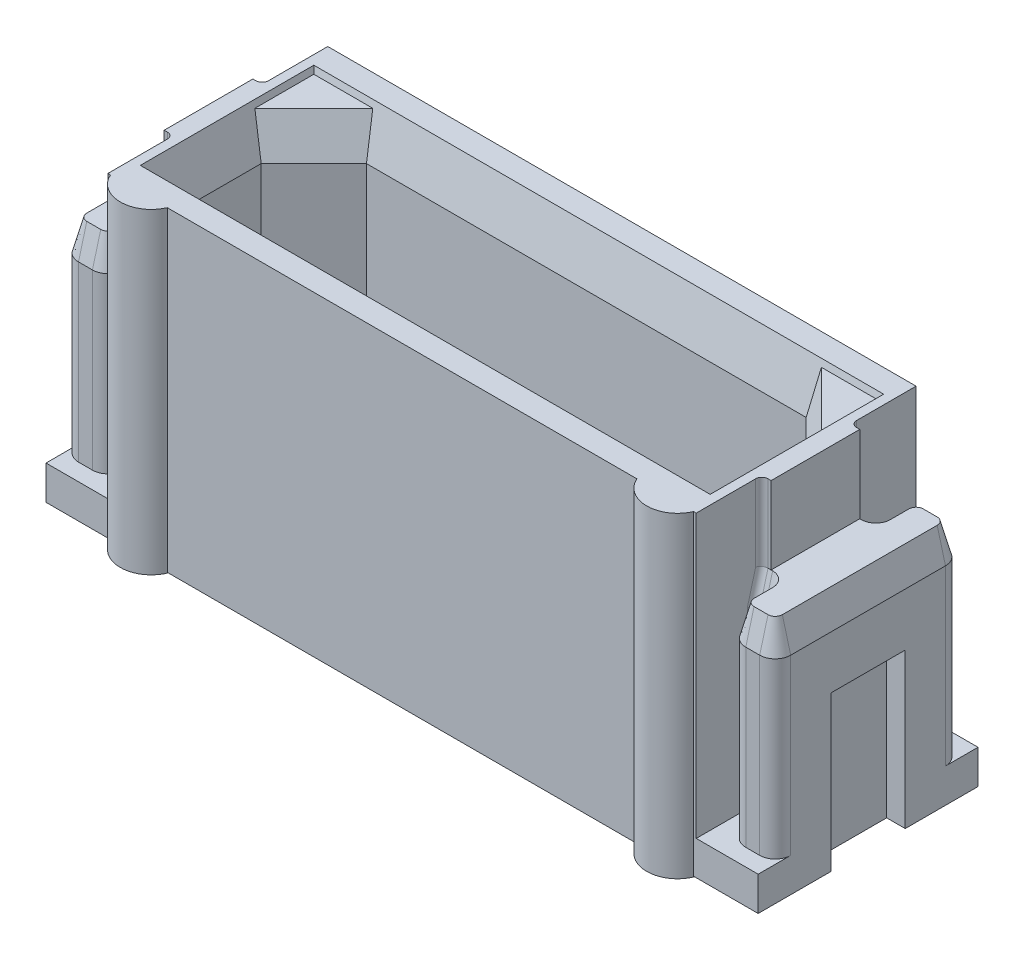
ISO-10303-21;
HEADER;
FILE_DESCRIPTION(('STEP AP214'),'2;1');
FILE_NAME('part.step','',(''),(''),'','','');
FILE_SCHEMA(('AUTOMOTIVE_DESIGN { 1 0 10303 214 1 1 1 1 }'));
ENDSEC;
DATA;
#1=APPLICATION_CONTEXT('core data for automotive mechanical design processes');
#2=APPLICATION_PROTOCOL_DEFINITION('international standard','automotive_design',2000,#1);
#3=PRODUCT_CONTEXT('',#1,'mechanical');
#4=PRODUCT('Part','Part','',(#3));
#5=PRODUCT_RELATED_PRODUCT_CATEGORY('part','',(#4));
#6=PRODUCT_DEFINITION_FORMATION('','',#4);
#7=PRODUCT_DEFINITION_CONTEXT('part definition',#1,'design');
#8=PRODUCT_DEFINITION('design','',#6,#7);
#9=PRODUCT_DEFINITION_SHAPE('','',#8);
#10=(LENGTH_UNIT() NAMED_UNIT(*) SI_UNIT(.MILLI.,.METRE.));
#11=(NAMED_UNIT(*) PLANE_ANGLE_UNIT() SI_UNIT($,.RADIAN.));
#12=(NAMED_UNIT(*) SI_UNIT($,.STERADIAN.) SOLID_ANGLE_UNIT());
#13=UNCERTAINTY_MEASURE_WITH_UNIT(LENGTH_MEASURE(1.E-05),#10,'distance_accuracy_value','');
#14=(GEOMETRIC_REPRESENTATION_CONTEXT(3) GLOBAL_UNCERTAINTY_ASSIGNED_CONTEXT((#13)) GLOBAL_UNIT_ASSIGNED_CONTEXT((#10,
#11,#12)) REPRESENTATION_CONTEXT('',''));
#15=CARTESIAN_POINT('',(0.,0.,0.));
#16=DIRECTION('',(0.,0.,1.));
#17=DIRECTION('',(1.,0.,0.));
#18=AXIS2_PLACEMENT_3D('',#15,#16,#17);
#19=CARTESIAN_POINT('',(-4.884069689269,3.85,1.420666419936));
#20=DIRECTION('',(0.,-1.,0.));
#21=DIRECTION('',(-1.,0.,0.));
#22=AXIS2_PLACEMENT_3D('',#19,#20,#21);
#23=PLANE('',#22);
#24=CARTESIAN_POINT('',(-4.925,3.84999999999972,-0.95));
#25=DIRECTION('',(0.,1.,0.));
#26=DIRECTION('',(0.,0.,1.));
#27=AXIS2_PLACEMENT_3D('',#24,#25,#26);
#28=CIRCLE('',#27,0.233974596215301);
#29=CARTESIAN_POINT('',(-5.15897459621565,3.84999999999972,-0.950000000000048));
#30=VERTEX_POINT('',#29);
#31=CARTESIAN_POINT('',(-4.92499999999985,3.84999999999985,-0.716025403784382));
#32=VERTEX_POINT('',#31);
#33=EDGE_CURVE('E1407',#30,#32,#28,.T.);
#34=ORIENTED_EDGE('',*,*,#33,.F.);
#35=DIRECTION('',(0.,0.,1.));
#36=VECTOR('',#35,1.);
#37=CARTESIAN_POINT('',(-5.158974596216,3.85,0.));
#38=LINE('',#37,#36);
#39=CARTESIAN_POINT('',(-5.15897459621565,3.84999999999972,-1.2499999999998));
#40=VERTEX_POINT('',#39);
#41=EDGE_CURVE('E1410',#40,#30,#38,.T.);
#42=ORIENTED_EDGE('',*,*,#41,.F.);
#43=CARTESIAN_POINT('',(-5.275,3.84999999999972,-1.25));
#44=DIRECTION('',(0.,-1.,0.));
#45=DIRECTION('',(0.,0.,-1.));
#46=AXIS2_PLACEMENT_3D('',#43,#44,#45);
#47=CIRCLE('',#46,0.116025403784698);
#48=CARTESIAN_POINT('',(-5.27499999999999,3.84999999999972,-1.36602540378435));
#49=VERTEX_POINT('',#48);
#50=EDGE_CURVE('E1413',#49,#40,#47,.T.);
#51=ORIENTED_EDGE('',*,*,#50,.F.);
#52=DIRECTION('',(1.,0.,0.));
#53=VECTOR('',#52,1.);
#54=CARTESIAN_POINT('',(-5.2580127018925,3.85,-1.366025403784));
#55=LINE('',#54,#53);
#56=CARTESIAN_POINT('',(-5.49999999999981,3.84999999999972,-1.36602540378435));
#57=VERTEX_POINT('',#56);
#58=EDGE_CURVE('E1414',#57,#49,#55,.T.);
#59=ORIENTED_EDGE('',*,*,#58,.F.);
#60=CARTESIAN_POINT('',(-5.5,3.84999999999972,-1.25));
#61=DIRECTION('',(0.,-1.,0.));
#62=DIRECTION('',(0.,0.,-1.));
#63=AXIS2_PLACEMENT_3D('',#60,#61,#62);
#64=CIRCLE('',#63,0.116025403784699);
#65=CARTESIAN_POINT('',(-5.6160254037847,3.84999999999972,-1.25));
#66=VERTEX_POINT('',#65);
#67=EDGE_CURVE('E1417',#66,#57,#64,.T.);
#68=ORIENTED_EDGE('',*,*,#67,.F.);
#69=DIRECTION('',(0.,0.,1.));
#70=VECTOR('',#69,1.);
#71=CARTESIAN_POINT('',(-5.6160254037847,3.84999999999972,0.));
#72=LINE('',#71,#70);
#73=CARTESIAN_POINT('',(-5.6160254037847,3.84999999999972,1.25));
#74=VERTEX_POINT('',#73);
#75=EDGE_CURVE('E1277',#66,#74,#72,.T.);
#76=ORIENTED_EDGE('',*,*,#75,.T.);
#77=CARTESIAN_POINT('',(-5.5,3.84999999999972,1.25));
#78=DIRECTION('',(0.,-1.,0.));
#79=DIRECTION('',(0.,0.,-1.));
#80=AXIS2_PLACEMENT_3D('',#77,#78,#79);
#81=CIRCLE('',#80,0.116025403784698);
#82=CARTESIAN_POINT('',(-5.49999999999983,3.84999999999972,1.36602540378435));
#83=VERTEX_POINT('',#82);
#84=EDGE_CURVE('E1421',#83,#74,#81,.T.);
#85=ORIENTED_EDGE('',*,*,#84,.F.);
#86=DIRECTION('',(-1.,0.,0.));
#87=VECTOR('',#86,1.);
#88=CARTESIAN_POINT('',(-5.2580127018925,3.85,1.366025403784));
#89=LINE('',#88,#87);
#90=CARTESIAN_POINT('',(-5.27500000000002,3.84999999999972,1.36602540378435));
#91=VERTEX_POINT('',#90);
#92=EDGE_CURVE('E1418',#91,#83,#89,.T.);
#93=ORIENTED_EDGE('',*,*,#92,.F.);
#94=CARTESIAN_POINT('',(-5.275,3.84999999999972,1.25));
#95=DIRECTION('',(0.,-1.,0.));
#96=DIRECTION('',(0.,0.,-1.));
#97=AXIS2_PLACEMENT_3D('',#94,#95,#96);
#98=CIRCLE('',#97,0.116025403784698);
#99=CARTESIAN_POINT('',(-5.15897459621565,3.84999999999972,1.24999999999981));
#100=VERTEX_POINT('',#99);
#101=EDGE_CURVE('E1422',#100,#91,#98,.T.);
#102=ORIENTED_EDGE('',*,*,#101,.F.);
#103=DIRECTION('',(0.,0.,1.));
#104=VECTOR('',#103,1.);
#105=CARTESIAN_POINT('',(-5.158974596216,3.85,0.));
#106=LINE('',#105,#104);
#107=CARTESIAN_POINT('',(-5.15897459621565,3.84999999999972,0.95));
#108=VERTEX_POINT('',#107);
#109=EDGE_CURVE('E1423',#108,#100,#106,.T.);
#110=ORIENTED_EDGE('',*,*,#109,.F.);
#111=CARTESIAN_POINT('',(-4.925,3.84999999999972,0.95));
#112=DIRECTION('',(0.,1.,0.));
#113=DIRECTION('',(0.,0.,1.));
#114=AXIS2_PLACEMENT_3D('',#111,#112,#113);
#115=CIRCLE('',#114,0.233974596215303);
#116=CARTESIAN_POINT('',(-4.92499999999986,3.84999999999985,0.716025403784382));
#117=VERTEX_POINT('',#116);
#118=EDGE_CURVE('E21',#117,#108,#115,.T.);
#119=ORIENTED_EDGE('',*,*,#118,.F.);
#120=DIRECTION('',(-1.,0.,0.));
#121=VECTOR('',#120,1.);
#122=CARTESIAN_POINT('',(-5.2580127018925,3.85,0.7160254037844));
#123=LINE('',#122,#121);
#124=CARTESIAN_POINT('',(-4.89999999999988,3.85,0.7160254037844));
#125=VERTEX_POINT('',#124);
#126=EDGE_CURVE('E432',#125,#117,#123,.T.);
#127=ORIENTED_EDGE('',*,*,#126,.F.);
#128=DIRECTION('',(0.,0.,1.));
#129=VECTOR('',#128,1.);
#130=CARTESIAN_POINT('',(-4.9,3.85,0.));
#131=LINE('',#130,#129);
#132=CARTESIAN_POINT('',(-4.9,3.85,-0.716025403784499));
#133=VERTEX_POINT('',#132);
#134=EDGE_CURVE('E1427',#133,#125,#131,.T.);
#135=ORIENTED_EDGE('',*,*,#134,.F.);
#136=DIRECTION('',(1.,0.,0.));
#137=VECTOR('',#136,1.);
#138=CARTESIAN_POINT('',(-5.2580127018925,3.85,-0.7160254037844));
#139=LINE('',#138,#137);
#140=EDGE_CURVE('E1390',#32,#133,#139,.T.);
#141=ORIENTED_EDGE('',*,*,#140,.F.);
#142=EDGE_LOOP('',(#34,#42,#51,#59,#68,#76,#85,#93,#102,#110,#119,#127,#135,#141));
#143=FACE_BOUND('',#142,.T.);
#144=ADVANCED_FACE('F17',(#143),#23,.F.);
#145=CARTESIAN_POINT('',(-5.45,2.601,-0.624));
#146=DIRECTION('',(-1.,0.,0.));
#147=DIRECTION('',(0.,-1.,0.));
#148=AXIS2_PLACEMENT_3D('',#145,#146,#147);
#149=PLANE('',#148);
#150=DIRECTION('',(0.,0.,1.));
#151=VECTOR('',#150,1.);
#152=CARTESIAN_POINT('',(-5.45000000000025,2.5499999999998,0.));
#153=LINE('',#152,#151);
#154=CARTESIAN_POINT('',(-5.45000000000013,2.54999999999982,-0.6));
#155=VERTEX_POINT('',#154);
#156=CARTESIAN_POINT('',(-5.45000000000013,2.54999999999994,0.6));
#157=VERTEX_POINT('',#156);
#158=EDGE_CURVE('E1298',#155,#157,#153,.T.);
#159=ORIENTED_EDGE('',*,*,#158,.F.);
#160=DIRECTION('',(0.,-1.,0.));
#161=VECTOR('',#160,1.);
#162=CARTESIAN_POINT('',(-5.45,1.275,-0.6));
#163=LINE('',#162,#161);
#164=CARTESIAN_POINT('',(-5.45,0.,-0.6));
#165=VERTEX_POINT('',#164);
#166=EDGE_CURVE('E1404',#155,#165,#163,.T.);
#167=ORIENTED_EDGE('',*,*,#166,.T.);
#168=DIRECTION('',(0.,0.,1.));
#169=VECTOR('',#168,1.);
#170=CARTESIAN_POINT('',(-5.45,0.,0.));
#171=LINE('',#170,#169);
#172=CARTESIAN_POINT('',(-5.45,0.,0.6));
#173=VERTEX_POINT('',#172);
#174=EDGE_CURVE('E1388',#165,#173,#171,.T.);
#175=ORIENTED_EDGE('',*,*,#174,.T.);
#176=DIRECTION('',(0.,-1.,0.));
#177=VECTOR('',#176,1.);
#178=CARTESIAN_POINT('',(-5.45,1.275,0.6));
#179=LINE('',#178,#177);
#180=EDGE_CURVE('E1251',#157,#173,#179,.T.);
#181=ORIENTED_EDGE('',*,*,#180,.F.);
#182=EDGE_LOOP('',(#159,#167,#175,#181));
#183=FACE_BOUND('',#182,.T.);
#184=ADVANCED_FACE('F2098',(#183),#149,.T.);
#185=CARTESIAN_POINT('',(4.884069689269,3.85,1.420666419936));
#186=DIRECTION('',(0.,1.,0.));
#187=DIRECTION('',(1.,0.,0.));
#188=AXIS2_PLACEMENT_3D('',#185,#186,#187);
#189=PLANE('',#188);
#190=CARTESIAN_POINT('',(4.925,3.84999999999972,-0.950000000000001));
#191=DIRECTION('',(0.,1.,0.));
#192=DIRECTION('',(0.,0.,1.));
#193=AXIS2_PLACEMENT_3D('',#190,#191,#192);
#194=CIRCLE('',#193,0.233974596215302);
#195=CARTESIAN_POINT('',(5.15897459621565,3.84999999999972,-0.950000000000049));
#196=VERTEX_POINT('',#195);
#197=CARTESIAN_POINT('',(4.92499999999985,3.84999999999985,-0.716025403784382));
#198=VERTEX_POINT('',#197);
#199=EDGE_CURVE('E1358',#196,#198,#194,.F.);
#200=ORIENTED_EDGE('',*,*,#199,.T.);
#201=DIRECTION('',(-1.,0.,0.));
#202=VECTOR('',#201,1.);
#203=CARTESIAN_POINT('',(5.2580127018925,3.85,-0.7160254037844));
#204=LINE('',#203,#202);
#205=CARTESIAN_POINT('',(4.89999999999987,3.85,-0.7160254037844));
#206=VERTEX_POINT('',#205);
#207=EDGE_CURVE('E1344',#198,#206,#204,.T.);
#208=ORIENTED_EDGE('',*,*,#207,.T.);
#209=DIRECTION('',(0.,0.,1.));
#210=VECTOR('',#209,1.);
#211=CARTESIAN_POINT('',(4.9,3.85,0.));
#212=LINE('',#211,#210);
#213=CARTESIAN_POINT('',(4.9,3.85,0.716025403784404));
#214=VERTEX_POINT('',#213);
#215=EDGE_CURVE('E1376',#206,#214,#212,.T.);
#216=ORIENTED_EDGE('',*,*,#215,.T.);
#217=DIRECTION('',(1.,0.,0.));
#218=VECTOR('',#217,1.);
#219=CARTESIAN_POINT('',(5.2580127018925,3.85,0.7160254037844));
#220=LINE('',#219,#218);
#221=CARTESIAN_POINT('',(4.92499999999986,3.84999999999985,0.716025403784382));
#222=VERTEX_POINT('',#221);
#223=EDGE_CURVE('E1374',#214,#222,#220,.T.);
#224=ORIENTED_EDGE('',*,*,#223,.T.);
#225=CARTESIAN_POINT('',(4.925,3.84999999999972,0.949999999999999));
#226=DIRECTION('',(0.,1.,0.));
#227=DIRECTION('',(0.,0.,1.));
#228=AXIS2_PLACEMENT_3D('',#225,#226,#227);
#229=CIRCLE('',#228,0.233974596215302);
#230=CARTESIAN_POINT('',(5.15897459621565,3.84999999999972,0.95));
#231=VERTEX_POINT('',#230);
#232=EDGE_CURVE('E1373',#222,#231,#229,.F.);
#233=ORIENTED_EDGE('',*,*,#232,.T.);
#234=DIRECTION('',(0.,0.,1.));
#235=VECTOR('',#234,1.);
#236=CARTESIAN_POINT('',(5.158974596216,3.85,0.));
#237=LINE('',#236,#235);
#238=CARTESIAN_POINT('',(5.15897459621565,3.84999999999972,1.24999999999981));
#239=VERTEX_POINT('',#238);
#240=EDGE_CURVE('E1371',#231,#239,#237,.T.);
#241=ORIENTED_EDGE('',*,*,#240,.T.);
#242=CARTESIAN_POINT('',(5.275,3.84999999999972,1.25));
#243=DIRECTION('',(0.,-1.,0.));
#244=DIRECTION('',(0.,0.,-1.));
#245=AXIS2_PLACEMENT_3D('',#242,#243,#244);
#246=CIRCLE('',#245,0.116025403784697);
#247=CARTESIAN_POINT('',(5.27500000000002,3.84999999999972,1.36602540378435));
#248=VERTEX_POINT('',#247);
#249=EDGE_CURVE('E1370',#239,#248,#246,.F.);
#250=ORIENTED_EDGE('',*,*,#249,.T.);
#251=DIRECTION('',(1.,0.,0.));
#252=VECTOR('',#251,1.);
#253=CARTESIAN_POINT('',(5.2580127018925,3.85,1.366025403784));
#254=LINE('',#253,#252);
#255=CARTESIAN_POINT('',(5.49999999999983,3.84999999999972,1.36602540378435));
#256=VERTEX_POINT('',#255);
#257=EDGE_CURVE('E1367',#248,#256,#254,.T.);
#258=ORIENTED_EDGE('',*,*,#257,.T.);
#259=CARTESIAN_POINT('',(5.5,3.84999999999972,1.25));
#260=DIRECTION('',(0.,-1.,0.));
#261=DIRECTION('',(0.,0.,-1.));
#262=AXIS2_PLACEMENT_3D('',#259,#260,#261);
#263=CIRCLE('',#262,0.116025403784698);
#264=CARTESIAN_POINT('',(5.6160254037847,3.84999999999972,1.25));
#265=VERTEX_POINT('',#264);
#266=EDGE_CURVE('E1369',#256,#265,#263,.F.);
#267=ORIENTED_EDGE('',*,*,#266,.T.);
#268=DIRECTION('',(0.,0.,-1.));
#269=VECTOR('',#268,1.);
#270=CARTESIAN_POINT('',(5.6160254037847,3.84999999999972,0.));
#271=LINE('',#270,#269);
#272=CARTESIAN_POINT('',(5.6160254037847,3.84999999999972,-1.25));
#273=VERTEX_POINT('',#272);
#274=EDGE_CURVE('E1205',#265,#273,#271,.T.);
#275=ORIENTED_EDGE('',*,*,#274,.T.);
#276=CARTESIAN_POINT('',(5.5,3.84999999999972,-1.25));
#277=DIRECTION('',(0.,-1.,0.));
#278=DIRECTION('',(0.,0.,-1.));
#279=AXIS2_PLACEMENT_3D('',#276,#277,#278);
#280=CIRCLE('',#279,0.116025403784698);
#281=CARTESIAN_POINT('',(5.49999999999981,3.84999999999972,-1.36602540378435));
#282=VERTEX_POINT('',#281);
#283=EDGE_CURVE('E1366',#273,#282,#280,.F.);
#284=ORIENTED_EDGE('',*,*,#283,.T.);
#285=DIRECTION('',(-1.,0.,0.));
#286=VECTOR('',#285,1.);
#287=CARTESIAN_POINT('',(5.2580127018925,3.85,-1.366025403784));
#288=LINE('',#287,#286);
#289=CARTESIAN_POINT('',(5.27499999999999,3.84999999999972,-1.36602540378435));
#290=VERTEX_POINT('',#289);
#291=EDGE_CURVE('E1364',#282,#290,#288,.T.);
#292=ORIENTED_EDGE('',*,*,#291,.T.);
#293=CARTESIAN_POINT('',(5.275,3.84999999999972,-1.25));
#294=DIRECTION('',(0.,-1.,0.));
#295=DIRECTION('',(0.,0.,-1.));
#296=AXIS2_PLACEMENT_3D('',#293,#294,#295);
#297=CIRCLE('',#296,0.116025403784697);
#298=CARTESIAN_POINT('',(5.15897459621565,3.84999999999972,-1.2499999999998));
#299=VERTEX_POINT('',#298);
#300=EDGE_CURVE('E1363',#290,#299,#297,.F.);
#301=ORIENTED_EDGE('',*,*,#300,.T.);
#302=DIRECTION('',(0.,0.,1.));
#303=VECTOR('',#302,1.);
#304=CARTESIAN_POINT('',(5.158974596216,3.85,0.));
#305=LINE('',#304,#303);
#306=EDGE_CURVE('E1361',#299,#196,#305,.T.);
#307=ORIENTED_EDGE('',*,*,#306,.T.);
#308=EDGE_LOOP('',(#200,#208,#216,#224,#233,#241,#250,#258,#267,#275,#284,#292,#301,#307));
#309=FACE_BOUND('',#308,.T.);
#310=ADVANCED_FACE('F2101',(#309),#189,.T.);
#311=CARTESIAN_POINT('',(5.45,2.601,-0.624));
#312=DIRECTION('',(-1.,0.,0.));
#313=DIRECTION('',(0.,-1.,0.));
#314=AXIS2_PLACEMENT_3D('',#311,#312,#313);
#315=PLANE('',#314);
#316=DIRECTION('',(0.,0.,1.));
#317=VECTOR('',#316,1.);
#318=CARTESIAN_POINT('',(5.45000000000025,2.5499999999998,0.));
#319=LINE('',#318,#317);
#320=CARTESIAN_POINT('',(5.45000000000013,2.54999999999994,-0.6));
#321=VERTEX_POINT('',#320);
#322=CARTESIAN_POINT('',(5.45000000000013,2.54999999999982,0.6));
#323=VERTEX_POINT('',#322);
#324=EDGE_CURVE('E1250',#321,#323,#319,.T.);
#325=ORIENTED_EDGE('',*,*,#324,.T.);
#326=DIRECTION('',(0.,-1.,0.));
#327=VECTOR('',#326,1.);
#328=CARTESIAN_POINT('',(5.45,1.275,0.6));
#329=LINE('',#328,#327);
#330=CARTESIAN_POINT('',(5.45,0.,0.6));
#331=VERTEX_POINT('',#330);
#332=EDGE_CURVE('E1337',#323,#331,#329,.T.);
#333=ORIENTED_EDGE('',*,*,#332,.T.);
#334=DIRECTION('',(0.,0.,1.));
#335=VECTOR('',#334,1.);
#336=CARTESIAN_POINT('',(5.45,0.,0.));
#337=LINE('',#336,#335);
#338=CARTESIAN_POINT('',(5.45,0.,-0.6));
#339=VERTEX_POINT('',#338);
#340=EDGE_CURVE('E1334',#339,#331,#337,.T.);
#341=ORIENTED_EDGE('',*,*,#340,.F.);
#342=DIRECTION('',(0.,-1.,0.));
#343=VECTOR('',#342,1.);
#344=CARTESIAN_POINT('',(5.45,1.275,-0.6));
#345=LINE('',#344,#343);
#346=EDGE_CURVE('E1228',#321,#339,#345,.T.);
#347=ORIENTED_EDGE('',*,*,#346,.F.);
#348=EDGE_LOOP('',(#325,#333,#341,#347));
#349=FACE_BOUND('',#348,.T.);
#350=ADVANCED_FACE('F2105',(#349),#315,.F.);
#351=CARTESIAN_POINT('',(-5.259069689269,0.494,1.5));
#352=DIRECTION('',(0.,0.,-1.));
#353=DIRECTION('',(-1.,0.,0.));
#354=AXIS2_PLACEMENT_3D('',#351,#352,#353);
#355=PLANE('',#354);
#356=DIRECTION('',(1.,0.,0.));
#357=VECTOR('',#356,1.);
#358=CARTESIAN_POINT('',(-5.3875,3.35,1.5));
#359=LINE('',#358,#357);
#360=CARTESIAN_POINT('',(-5.49999999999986,3.35000000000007,1.50000000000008));
#361=VERTEX_POINT('',#360);
#362=CARTESIAN_POINT('',(-5.27500000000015,3.35000000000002,1.50000000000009));
#363=VERTEX_POINT('',#362);
#364=EDGE_CURVE('E1318',#361,#363,#359,.T.);
#365=ORIENTED_EDGE('',*,*,#364,.F.);
#366=DIRECTION('',(0.,-1.,0.));
#367=VECTOR('',#366,1.);
#368=CARTESIAN_POINT('',(-5.50000000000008,1.95,1.5));
#369=LINE('',#368,#367);
#370=CARTESIAN_POINT('',(-5.50000000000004,0.550000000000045,1.5));
#371=VERTEX_POINT('',#370);
#372=EDGE_CURVE('E1265',#361,#371,#369,.T.);
#373=ORIENTED_EDGE('',*,*,#372,.T.);
#374=DIRECTION('',(-1.,0.,0.));
#375=VECTOR('',#374,1.);
#376=CARTESIAN_POINT('',(-5.3875,0.55,1.5));
#377=LINE('',#376,#375);
#378=CARTESIAN_POINT('',(-5.27500000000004,0.550000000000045,1.5));
#379=VERTEX_POINT('',#378);
#380=EDGE_CURVE('E1329',#379,#371,#377,.T.);
#381=ORIENTED_EDGE('',*,*,#380,.F.);
#382=DIRECTION('',(0.,1.,0.));
#383=VECTOR('',#382,1.);
#384=CARTESIAN_POINT('',(-5.27500000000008,1.95,1.5));
#385=LINE('',#384,#383);
#386=EDGE_CURVE('E1167',#379,#363,#385,.T.);
#387=ORIENTED_EDGE('',*,*,#386,.T.);
#388=EDGE_LOOP('',(#365,#373,#381,#387));
#389=FACE_BOUND('',#388,.T.);
#390=ADVANCED_FACE('F1687',(#389),#355,.F.);
#391=CARTESIAN_POINT('',(5.259069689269,0.494,1.5));
#392=DIRECTION('',(0.,0.,1.));
#393=DIRECTION('',(1.,0.,0.));
#394=AXIS2_PLACEMENT_3D('',#391,#392,#393);
#395=PLANE('',#394);
#396=DIRECTION('',(-1.,0.,0.));
#397=VECTOR('',#396,1.);
#398=CARTESIAN_POINT('',(5.3875,3.35,1.5));
#399=LINE('',#398,#397);
#400=CARTESIAN_POINT('',(5.49999999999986,3.35000000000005,1.50000000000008));
#401=VERTEX_POINT('',#400);
#402=CARTESIAN_POINT('',(5.27500000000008,3.34999999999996,1.50000000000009));
#403=VERTEX_POINT('',#402);
#404=EDGE_CURVE('E1312',#401,#403,#399,.T.);
#405=ORIENTED_EDGE('',*,*,#404,.T.);
#406=DIRECTION('',(0.,-1.,0.));
#407=VECTOR('',#406,1.);
#408=CARTESIAN_POINT('',(5.27500000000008,1.95,1.5));
#409=LINE('',#408,#407);
#410=CARTESIAN_POINT('',(5.27500000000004,0.550000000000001,1.5));
#411=VERTEX_POINT('',#410);
#412=EDGE_CURVE('E1153',#403,#411,#409,.T.);
#413=ORIENTED_EDGE('',*,*,#412,.T.);
#414=DIRECTION('',(1.,0.,0.));
#415=VECTOR('',#414,1.);
#416=CARTESIAN_POINT('',(5.3875,0.55,1.5));
#417=LINE('',#416,#415);
#418=CARTESIAN_POINT('',(5.50000000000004,0.550000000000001,1.5));
#419=VERTEX_POINT('',#418);
#420=EDGE_CURVE('E1314',#411,#419,#417,.T.);
#421=ORIENTED_EDGE('',*,*,#420,.T.);
#422=DIRECTION('',(0.,1.,0.));
#423=VECTOR('',#422,1.);
#424=CARTESIAN_POINT('',(5.50000000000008,1.95,1.5));
#425=LINE('',#424,#423);
#426=EDGE_CURVE('E1199',#419,#401,#425,.T.);
#427=ORIENTED_EDGE('',*,*,#426,.T.);
#428=EDGE_LOOP('',(#405,#413,#421,#427));
#429=FACE_BOUND('',#428,.T.);
#430=ADVANCED_FACE('F2112',(#429),#395,.T.);
#431=CARTESIAN_POINT('',(-5.765688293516,2.494335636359,-0.624));
#432=DIRECTION('',(0.173648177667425,-0.984807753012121,0.));
#433=DIRECTION('',(0.984807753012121,0.173648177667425,0.));
#434=AXIS2_PLACEMENT_3D('',#431,#432,#433);
#435=PLANE('',#434);
#436=ORIENTED_EDGE('',*,*,#158,.T.);
#437=DIRECTION('',(0.98480775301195,0.173648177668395,0.));
#438=VECTOR('',#437,1.);
#439=CARTESIAN_POINT('',(-5.75,2.497101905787,0.6));
#440=LINE('',#439,#438);
#441=CARTESIAN_POINT('',(-5.75,2.497101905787,0.6));
#442=VERTEX_POINT('',#441);
#443=EDGE_CURVE('E1385',#442,#157,#440,.T.);
#444=ORIENTED_EDGE('',*,*,#443,.F.);
#445=DIRECTION('',(0.,0.,-1.));
#446=VECTOR('',#445,1.);
#447=CARTESIAN_POINT('',(-5.75,2.497101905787,0.));
#448=LINE('',#447,#446);
#449=CARTESIAN_POINT('',(-5.75,2.49710190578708,-0.6));
#450=VERTEX_POINT('',#449);
#451=EDGE_CURVE('E1292',#442,#450,#448,.T.);
#452=ORIENTED_EDGE('',*,*,#451,.T.);
#453=DIRECTION('',(0.984807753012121,0.173648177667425,0.));
#454=VECTOR('',#453,1.);
#455=CARTESIAN_POINT('',(-5.765688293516,2.494335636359,-0.6));
#456=LINE('',#455,#454);
#457=EDGE_CURVE('E1297',#450,#155,#456,.T.);
#458=ORIENTED_EDGE('',*,*,#457,.T.);
#459=EDGE_LOOP('',(#436,#444,#452,#458));
#460=FACE_BOUND('',#459,.T.);
#461=ADVANCED_FACE('F1868',(#460),#435,.T.);
#462=CARTESIAN_POINT('',(-5.434069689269,-0.051,-0.6));
#463=DIRECTION('',(0.,0.,-1.));
#464=DIRECTION('',(-1.,0.,0.));
#465=AXIS2_PLACEMENT_3D('',#462,#463,#464);
#466=PLANE('',#465);
#467=ORIENTED_EDGE('',*,*,#457,.F.);
#468=DIRECTION('',(0.,-1.,0.));
#469=VECTOR('',#468,1.);
#470=CARTESIAN_POINT('',(-5.75,1.675,-0.599999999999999));
#471=LINE('',#470,#469);
#472=CARTESIAN_POINT('',(-5.75,0.,-0.6));
#473=VERTEX_POINT('',#472);
#474=EDGE_CURVE('E1287',#450,#473,#471,.T.);
#475=ORIENTED_EDGE('',*,*,#474,.T.);
#476=DIRECTION('',(-1.,0.,0.));
#477=VECTOR('',#476,1.);
#478=CARTESIAN_POINT('',(-5.6,0.,-0.6));
#479=LINE('',#478,#477);
#480=EDGE_CURVE('E1295',#165,#473,#479,.T.);
#481=ORIENTED_EDGE('',*,*,#480,.F.);
#482=ORIENTED_EDGE('',*,*,#166,.F.);
#483=EDGE_LOOP('',(#467,#475,#481,#482));
#484=FACE_BOUND('',#483,.T.);
#485=ADVANCED_FACE('F1865',(#484),#466,.F.);
#486=CARTESIAN_POINT('',(-5.611902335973,3.865387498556,-1.3));
#487=DIRECTION('',(0.965925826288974,-0.258819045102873,0.));
#488=DIRECTION('',(0.,0.,1.));
#489=AXIS2_PLACEMENT_3D('',#486,#487,#488);
#490=PLANE('',#489);
#491=DIRECTION('',(0.,0.,1.));
#492=VECTOR('',#491,1.);
#493=CARTESIAN_POINT('',(-5.75,3.35,0.));
#494=LINE('',#493,#492);
#495=CARTESIAN_POINT('',(-5.75000000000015,3.35000000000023,-1.25));
#496=VERTEX_POINT('',#495);
#497=CARTESIAN_POINT('',(-5.75000000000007,3.35000000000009,1.25));
#498=VERTEX_POINT('',#497);
#499=EDGE_CURVE('E1130',#496,#498,#494,.T.);
#500=ORIENTED_EDGE('',*,*,#499,.T.);
#501=DIRECTION('',(-0.258819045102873,-0.965925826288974,0.));
#502=VECTOR('',#501,1.);
#503=CARTESIAN_POINT('',(-5.6830127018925,3.6,1.25));
#504=LINE('',#503,#502);
#505=EDGE_CURVE('E1272',#74,#498,#504,.T.);
#506=ORIENTED_EDGE('',*,*,#505,.F.);
#507=ORIENTED_EDGE('',*,*,#75,.F.);
#508=DIRECTION('',(0.258819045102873,0.965925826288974,0.));
#509=VECTOR('',#508,1.);
#510=CARTESIAN_POINT('',(-5.6830127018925,3.6,-1.25));
#511=LINE('',#510,#509);
#512=EDGE_CURVE('E1269',#496,#66,#511,.T.);
#513=ORIENTED_EDGE('',*,*,#512,.F.);
#514=EDGE_LOOP('',(#500,#506,#507,#513));
#515=FACE_BOUND('',#514,.T.);
#516=ADVANCED_FACE('F1676',(#515),#490,.F.);
#517=CARTESIAN_POINT('',(-5.5,3.35,1.25));
#518=DIRECTION('',(0.,-1.,0.));
#519=DIRECTION('',(0.,0.,-1.));
#520=AXIS2_PLACEMENT_3D('',#517,#518,#519);
#521=CYLINDRICAL_SURFACE('',#520,0.25);
#522=CARTESIAN_POINT('',(-5.5,3.35,1.25));
#523=DIRECTION('',(0.,-1.,0.));
#524=DIRECTION('',(-1.,0.,0.));
#525=AXIS2_PLACEMENT_3D('',#522,#523,#524);
#526=CIRCLE('',#525,0.25);
#527=EDGE_CURVE('E1262',#498,#361,#526,.F.);
#528=ORIENTED_EDGE('',*,*,#527,.F.);
#529=DIRECTION('',(0.,-1.,0.));
#530=VECTOR('',#529,1.);
#531=CARTESIAN_POINT('',(-5.75,1.675,1.25));
#532=LINE('',#531,#530);
#533=CARTESIAN_POINT('',(-5.75,0.550000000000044,1.25));
#534=VERTEX_POINT('',#533);
#535=EDGE_CURVE('E1133',#498,#534,#532,.T.);
#536=ORIENTED_EDGE('',*,*,#535,.T.);
#537=CARTESIAN_POINT('',(-5.5,0.550000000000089,1.25));
#538=DIRECTION('',(0.,-1.,0.));
#539=DIRECTION('',(0.,0.,-1.));
#540=AXIS2_PLACEMENT_3D('',#537,#538,#539);
#541=CIRCLE('',#540,0.25);
#542=EDGE_CURVE('E1266',#371,#534,#541,.T.);
#543=ORIENTED_EDGE('',*,*,#542,.F.);
#544=ORIENTED_EDGE('',*,*,#372,.F.);
#545=EDGE_LOOP('',(#528,#536,#543,#544));
#546=FACE_BOUND('',#545,.T.);
#547=ADVANCED_FACE('F1686',(#546),#521,.T.);
#548=CARTESIAN_POINT('',(-5.434069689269,-0.051,0.6));
#549=DIRECTION('',(0.,0.,-1.));
#550=DIRECTION('',(-1.,0.,0.));
#551=AXIS2_PLACEMENT_3D('',#548,#549,#550);
#552=PLANE('',#551);
#553=ORIENTED_EDGE('',*,*,#180,.T.);
#554=DIRECTION('',(-1.,0.,0.));
#555=VECTOR('',#554,1.);
#556=CARTESIAN_POINT('',(-5.6,0.,0.6));
#557=LINE('',#556,#555);
#558=CARTESIAN_POINT('',(-5.75,0.,0.6));
#559=VERTEX_POINT('',#558);
#560=EDGE_CURVE('E1248',#173,#559,#557,.T.);
#561=ORIENTED_EDGE('',*,*,#560,.T.);
#562=DIRECTION('',(0.,1.,0.));
#563=VECTOR('',#562,1.);
#564=CARTESIAN_POINT('',(-5.75,1.675,0.6));
#565=LINE('',#564,#563);
#566=EDGE_CURVE('E1232',#559,#442,#565,.T.);
#567=ORIENTED_EDGE('',*,*,#566,.T.);
#568=ORIENTED_EDGE('',*,*,#443,.T.);
#569=EDGE_LOOP('',(#553,#561,#567,#568));
#570=FACE_BOUND('',#569,.T.);
#571=ADVANCED_FACE('F2095',(#570),#552,.T.);
#572=CARTESIAN_POINT('',(5.765688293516,2.494335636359,-0.624));
#573=DIRECTION('',(0.173648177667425,0.984807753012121,0.));
#574=DIRECTION('',(-0.984807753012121,0.173648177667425,0.));
#575=AXIS2_PLACEMENT_3D('',#572,#573,#574);
#576=PLANE('',#575);
#577=ORIENTED_EDGE('',*,*,#324,.F.);
#578=DIRECTION('',(-0.98480775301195,0.173648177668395,0.));
#579=VECTOR('',#578,1.);
#580=CARTESIAN_POINT('',(5.75,2.497101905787,-0.6));
#581=LINE('',#580,#579);
#582=CARTESIAN_POINT('',(5.75,2.497101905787,-0.6));
#583=VERTEX_POINT('',#582);
#584=EDGE_CURVE('E1336',#583,#321,#581,.T.);
#585=ORIENTED_EDGE('',*,*,#584,.F.);
#586=DIRECTION('',(0.,0.,-1.));
#587=VECTOR('',#586,1.);
#588=CARTESIAN_POINT('',(5.75,2.497101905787,0.));
#589=LINE('',#588,#587);
#590=CARTESIAN_POINT('',(5.75,2.49710190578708,0.6));
#591=VERTEX_POINT('',#590);
#592=EDGE_CURVE('E1223',#591,#583,#589,.T.);
#593=ORIENTED_EDGE('',*,*,#592,.F.);
#594=DIRECTION('',(-0.984807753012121,0.173648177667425,0.));
#595=VECTOR('',#594,1.);
#596=CARTESIAN_POINT('',(5.765688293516,2.494335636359,0.600000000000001));
#597=LINE('',#596,#595);
#598=EDGE_CURVE('E1182',#591,#323,#597,.T.);
#599=ORIENTED_EDGE('',*,*,#598,.T.);
#600=EDGE_LOOP('',(#577,#585,#593,#599));
#601=FACE_BOUND('',#600,.T.);
#602=ADVANCED_FACE('F2124',(#601),#576,.F.);
#603=CARTESIAN_POINT('',(5.434069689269,-0.051,-0.6));
#604=DIRECTION('',(0.,0.,1.));
#605=DIRECTION('',(1.,0.,0.));
#606=AXIS2_PLACEMENT_3D('',#603,#604,#605);
#607=PLANE('',#606);
#608=ORIENTED_EDGE('',*,*,#346,.T.);
#609=DIRECTION('',(1.,0.,0.));
#610=VECTOR('',#609,1.);
#611=CARTESIAN_POINT('',(5.6,0.,-0.6));
#612=LINE('',#611,#610);
#613=CARTESIAN_POINT('',(5.75,0.,-0.6));
#614=VERTEX_POINT('',#613);
#615=EDGE_CURVE('E1226',#339,#614,#612,.T.);
#616=ORIENTED_EDGE('',*,*,#615,.T.);
#617=DIRECTION('',(0.,-1.,0.));
#618=VECTOR('',#617,1.);
#619=CARTESIAN_POINT('',(5.75,1.675,-0.599999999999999));
#620=LINE('',#619,#618);
#621=EDGE_CURVE('E1218',#583,#614,#620,.T.);
#622=ORIENTED_EDGE('',*,*,#621,.F.);
#623=ORIENTED_EDGE('',*,*,#584,.T.);
#624=EDGE_LOOP('',(#608,#616,#622,#623));
#625=FACE_BOUND('',#624,.T.);
#626=ADVANCED_FACE('F2127',(#625),#607,.T.);
#627=CARTESIAN_POINT('',(5.611902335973,3.865387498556,1.3));
#628=DIRECTION('',(-0.965925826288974,-0.258819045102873,0.));
#629=DIRECTION('',(0.,0.,-1.));
#630=AXIS2_PLACEMENT_3D('',#627,#628,#629);
#631=PLANE('',#630);
#632=DIRECTION('',(0.,0.,1.));
#633=VECTOR('',#632,1.);
#634=CARTESIAN_POINT('',(5.75,3.35,0.));
#635=LINE('',#634,#633);
#636=CARTESIAN_POINT('',(5.75000000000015,3.35000000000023,-1.25));
#637=VERTEX_POINT('',#636);
#638=CARTESIAN_POINT('',(5.75000000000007,3.35000000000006,1.25));
#639=VERTEX_POINT('',#638);
#640=EDGE_CURVE('E1115',#637,#639,#635,.T.);
#641=ORIENTED_EDGE('',*,*,#640,.F.);
#642=DIRECTION('',(0.258819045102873,-0.965925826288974,0.));
#643=VECTOR('',#642,1.);
#644=CARTESIAN_POINT('',(5.6830127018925,3.6,-1.25));
#645=LINE('',#644,#643);
#646=EDGE_CURVE('E1202',#273,#637,#645,.T.);
#647=ORIENTED_EDGE('',*,*,#646,.F.);
#648=ORIENTED_EDGE('',*,*,#274,.F.);
#649=DIRECTION('',(-0.258819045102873,0.965925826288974,0.));
#650=VECTOR('',#649,1.);
#651=CARTESIAN_POINT('',(5.6830127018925,3.6,1.25));
#652=LINE('',#651,#650);
#653=EDGE_CURVE('E1204',#639,#265,#652,.T.);
#654=ORIENTED_EDGE('',*,*,#653,.F.);
#655=EDGE_LOOP('',(#641,#647,#648,#654));
#656=FACE_BOUND('',#655,.T.);
#657=ADVANCED_FACE('F2091',(#656),#631,.F.);
#658=CARTESIAN_POINT('',(5.5,0.550000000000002,1.25));
#659=DIRECTION('',(0.,1.,0.));
#660=DIRECTION('',(0.,0.,1.));
#661=AXIS2_PLACEMENT_3D('',#658,#659,#660);
#662=CYLINDRICAL_SURFACE('',#661,0.25);
#663=CARTESIAN_POINT('',(5.5,3.34999999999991,1.25));
#664=DIRECTION('',(0.,1.,0.));
#665=DIRECTION('',(1.,0.,0.));
#666=AXIS2_PLACEMENT_3D('',#663,#664,#665);
#667=CIRCLE('',#666,0.25);
#668=EDGE_CURVE('E1183',#401,#639,#667,.T.);
#669=ORIENTED_EDGE('',*,*,#668,.F.);
#670=ORIENTED_EDGE('',*,*,#426,.F.);
#671=CARTESIAN_POINT('',(5.5,0.550000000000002,1.25));
#672=DIRECTION('',(0.,1.,0.));
#673=DIRECTION('',(0.,0.,1.));
#674=AXIS2_PLACEMENT_3D('',#671,#672,#673);
#675=CIRCLE('',#674,0.25);
#676=CARTESIAN_POINT('',(5.75,0.550000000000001,1.25));
#677=VERTEX_POINT('',#676);
#678=EDGE_CURVE('E1210',#677,#419,#675,.F.);
#679=ORIENTED_EDGE('',*,*,#678,.F.);
#680=DIRECTION('',(0.,-1.,0.));
#681=VECTOR('',#680,1.);
#682=CARTESIAN_POINT('',(5.75,1.675,1.25));
#683=LINE('',#682,#681);
#684=EDGE_CURVE('E1118',#639,#677,#683,.T.);
#685=ORIENTED_EDGE('',*,*,#684,.F.);
#686=EDGE_LOOP('',(#669,#670,#679,#685));
#687=FACE_BOUND('',#686,.T.);
#688=ADVANCED_FACE('F2088',(#687),#662,.T.);
#689=CARTESIAN_POINT('',(5.434069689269,-0.051,0.6));
#690=DIRECTION('',(0.,0.,1.));
#691=DIRECTION('',(1.,0.,0.));
#692=AXIS2_PLACEMENT_3D('',#689,#690,#691);
#693=PLANE('',#692);
#694=ORIENTED_EDGE('',*,*,#598,.F.);
#695=DIRECTION('',(0.,1.,0.));
#696=VECTOR('',#695,1.);
#697=CARTESIAN_POINT('',(5.75,1.675,0.6));
#698=LINE('',#697,#696);
#699=CARTESIAN_POINT('',(5.75,0.,0.6));
#700=VERTEX_POINT('',#699);
#701=EDGE_CURVE('E1110',#700,#591,#698,.T.);
#702=ORIENTED_EDGE('',*,*,#701,.F.);
#703=DIRECTION('',(1.,0.,0.));
#704=VECTOR('',#703,1.);
#705=CARTESIAN_POINT('',(5.6,0.,0.6));
#706=LINE('',#705,#704);
#707=EDGE_CURVE('E1179',#331,#700,#706,.T.);
#708=ORIENTED_EDGE('',*,*,#707,.F.);
#709=ORIENTED_EDGE('',*,*,#332,.F.);
#710=EDGE_LOOP('',(#694,#702,#708,#709));
#711=FACE_BOUND('',#710,.T.);
#712=ADVANCED_FACE('F2087',(#711),#693,.F.);
#713=CARTESIAN_POINT('',(-5.275,3.35,1.25));
#714=DIRECTION('',(0.,-1.,0.));
#715=DIRECTION('',(0.,0.,-1.));
#716=AXIS2_PLACEMENT_3D('',#713,#714,#715);
#717=CYLINDRICAL_SURFACE('',#716,0.249999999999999);
#718=CARTESIAN_POINT('',(-5.275,3.35,1.25));
#719=DIRECTION('',(0.,-1.,0.));
#720=DIRECTION('',(-1.,0.,0.));
#721=AXIS2_PLACEMENT_3D('',#718,#719,#720);
#722=CIRCLE('',#721,0.249999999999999);
#723=CARTESIAN_POINT('',(-5.02499999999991,3.35000000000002,1.24999999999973));
#724=VERTEX_POINT('',#723);
#725=EDGE_CURVE('E1165',#363,#724,#722,.F.);
#726=ORIENTED_EDGE('',*,*,#725,.F.);
#727=ORIENTED_EDGE('',*,*,#386,.F.);
#728=CARTESIAN_POINT('',(-5.275,0.550000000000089,1.25));
#729=DIRECTION('',(0.,-1.,0.));
#730=DIRECTION('',(0.,0.,-1.));
#731=AXIS2_PLACEMENT_3D('',#728,#729,#730);
#732=CIRCLE('',#731,0.249999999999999);
#733=CARTESIAN_POINT('',(-5.025,0.550000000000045,1.24999999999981));
#734=VERTEX_POINT('',#733);
#735=EDGE_CURVE('E1325',#734,#379,#732,.T.);
#736=ORIENTED_EDGE('',*,*,#735,.F.);
#737=DIRECTION('',(0.,1.,0.));
#738=VECTOR('',#737,1.);
#739=CARTESIAN_POINT('',(-5.025,1.95,1.24999999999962));
#740=LINE('',#739,#738);
#741=EDGE_CURVE('E1100',#734,#724,#740,.T.);
#742=ORIENTED_EDGE('',*,*,#741,.T.);
#743=EDGE_LOOP('',(#726,#727,#736,#742));
#744=FACE_BOUND('',#743,.T.);
#745=ADVANCED_FACE('F1624',(#744),#717,.T.);
#746=CARTESIAN_POINT('',(5.275,0.550000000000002,1.25));
#747=DIRECTION('',(0.,1.,0.));
#748=DIRECTION('',(0.,0.,1.));
#749=AXIS2_PLACEMENT_3D('',#746,#747,#748);
#750=CYLINDRICAL_SURFACE('',#749,0.249999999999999);
#751=CARTESIAN_POINT('',(5.275,3.34999999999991,1.25));
#752=DIRECTION('',(0.,1.,0.));
#753=DIRECTION('',(1.,0.,0.));
#754=AXIS2_PLACEMENT_3D('',#751,#752,#753);
#755=CIRCLE('',#754,0.249999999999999);
#756=CARTESIAN_POINT('',(5.02499999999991,3.35,1.24999999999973));
#757=VERTEX_POINT('',#756);
#758=EDGE_CURVE('E1150',#757,#403,#755,.T.);
#759=ORIENTED_EDGE('',*,*,#758,.F.);
#760=DIRECTION('',(0.,1.,0.));
#761=VECTOR('',#760,1.);
#762=CARTESIAN_POINT('',(5.025,1.95,1.24999999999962));
#763=LINE('',#762,#761);
#764=CARTESIAN_POINT('',(5.025,0.550000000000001,1.24999999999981));
#765=VERTEX_POINT('',#764);
#766=EDGE_CURVE('E1088',#765,#757,#763,.T.);
#767=ORIENTED_EDGE('',*,*,#766,.F.);
#768=CARTESIAN_POINT('',(5.275,0.550000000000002,1.25));
#769=DIRECTION('',(0.,1.,0.));
#770=DIRECTION('',(0.,0.,1.));
#771=AXIS2_PLACEMENT_3D('',#768,#769,#770);
#772=CIRCLE('',#771,0.249999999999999);
#773=EDGE_CURVE('E1154',#411,#765,#772,.F.);
#774=ORIENTED_EDGE('',*,*,#773,.F.);
#775=ORIENTED_EDGE('',*,*,#412,.F.);
#776=EDGE_LOOP('',(#759,#767,#774,#775));
#777=FACE_BOUND('',#776,.T.);
#778=ADVANCED_FACE('F2081',(#777),#750,.T.);
#779=CARTESIAN_POINT('',(-5.75,-0.067,1.846));
#780=DIRECTION('',(1.,0.,0.));
#781=DIRECTION('',(0.,0.,-1.));
#782=AXIS2_PLACEMENT_3D('',#779,#780,#781);
#783=PLANE('',#782);
#784=DIRECTION('',(0.,0.,-1.));
#785=VECTOR('',#784,1.);
#786=CARTESIAN_POINT('',(-5.75,0.,0.));
#787=LINE('',#786,#785);
#788=CARTESIAN_POINT('',(-5.75,0.,1.775));
#789=VERTEX_POINT('',#788);
#790=EDGE_CURVE('E1236',#789,#559,#787,.T.);
#791=ORIENTED_EDGE('',*,*,#790,.F.);
#792=DIRECTION('',(0.,-1.,0.));
#793=VECTOR('',#792,1.);
#794=CARTESIAN_POINT('',(-5.75,1.675,1.775));
#795=LINE('',#794,#793);
#796=CARTESIAN_POINT('',(-5.75,0.549999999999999,1.775));
#797=VERTEX_POINT('',#796);
#798=EDGE_CURVE('E1233',#797,#789,#795,.T.);
#799=ORIENTED_EDGE('',*,*,#798,.F.);
#800=DIRECTION('',(0.,0.,1.));
#801=VECTOR('',#800,1.);
#802=CARTESIAN_POINT('',(-5.75,0.549999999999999,0.));
#803=LINE('',#802,#801);
#804=EDGE_CURVE('E1237',#534,#797,#803,.T.);
#805=ORIENTED_EDGE('',*,*,#804,.F.);
#806=ORIENTED_EDGE('',*,*,#535,.F.);
#807=ORIENTED_EDGE('',*,*,#499,.F.);
#808=DIRECTION('',(0.,-1.,0.));
#809=VECTOR('',#808,1.);
#810=CARTESIAN_POINT('',(-5.75,1.95,-1.25));
#811=LINE('',#810,#809);
#812=CARTESIAN_POINT('',(-5.75,0.550000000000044,-1.25));
#813=VERTEX_POINT('',#812);
#814=EDGE_CURVE('E1067',#496,#813,#811,.T.);
#815=ORIENTED_EDGE('',*,*,#814,.T.);
#816=DIRECTION('',(0.,0.,1.));
#817=VECTOR('',#816,1.);
#818=CARTESIAN_POINT('',(-5.75,0.549999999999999,0.));
#819=LINE('',#818,#817);
#820=CARTESIAN_POINT('',(-5.75,0.549999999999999,-1.775));
#821=VERTEX_POINT('',#820);
#822=EDGE_CURVE('E1134',#821,#813,#819,.T.);
#823=ORIENTED_EDGE('',*,*,#822,.F.);
#824=DIRECTION('',(0.,1.,0.));
#825=VECTOR('',#824,1.);
#826=CARTESIAN_POINT('',(-5.75,1.675,-1.775));
#827=LINE('',#826,#825);
#828=CARTESIAN_POINT('',(-5.75,0.,-1.775));
#829=VERTEX_POINT('',#828);
#830=EDGE_CURVE('E1139',#829,#821,#827,.T.);
#831=ORIENTED_EDGE('',*,*,#830,.F.);
#832=DIRECTION('',(0.,0.,-1.));
#833=VECTOR('',#832,1.);
#834=CARTESIAN_POINT('',(-5.75,0.,0.));
#835=LINE('',#834,#833);
#836=EDGE_CURVE('E1282',#473,#829,#835,.T.);
#837=ORIENTED_EDGE('',*,*,#836,.F.);
#838=ORIENTED_EDGE('',*,*,#474,.F.);
#839=ORIENTED_EDGE('',*,*,#451,.F.);
#840=ORIENTED_EDGE('',*,*,#566,.F.);
#841=EDGE_LOOP('',(#791,#799,#805,#806,#807,#815,#823,#831,#837,#838,#839,#840));
#842=FACE_BOUND('',#841,.T.);
#843=ADVANCED_FACE('F1683',(#842),#783,.F.);
#844=CARTESIAN_POINT('',(5.75,-0.067,1.846));
#845=DIRECTION('',(1.,0.,0.));
#846=DIRECTION('',(0.,0.,-1.));
#847=AXIS2_PLACEMENT_3D('',#844,#845,#846);
#848=PLANE('',#847);
#849=DIRECTION('',(0.,0.,-1.));
#850=VECTOR('',#849,1.);
#851=CARTESIAN_POINT('',(5.75,0.,0.));
#852=LINE('',#851,#850);
#853=CARTESIAN_POINT('',(5.75,0.,1.775));
#854=VERTEX_POINT('',#853);
#855=EDGE_CURVE('E1172',#854,#700,#852,.T.);
#856=ORIENTED_EDGE('',*,*,#855,.T.);
#857=ORIENTED_EDGE('',*,*,#701,.T.);
#858=ORIENTED_EDGE('',*,*,#592,.T.);
#859=ORIENTED_EDGE('',*,*,#621,.T.);
#860=DIRECTION('',(0.,0.,-1.));
#861=VECTOR('',#860,1.);
#862=CARTESIAN_POINT('',(5.75,0.,0.));
#863=LINE('',#862,#861);
#864=CARTESIAN_POINT('',(5.75,0.,-1.775));
#865=VERTEX_POINT('',#864);
#866=EDGE_CURVE('E1214',#614,#865,#863,.T.);
#867=ORIENTED_EDGE('',*,*,#866,.T.);
#868=DIRECTION('',(0.,1.,0.));
#869=VECTOR('',#868,1.);
#870=CARTESIAN_POINT('',(5.75,1.675,-1.775));
#871=LINE('',#870,#869);
#872=CARTESIAN_POINT('',(5.75,0.55,-1.775));
#873=VERTEX_POINT('',#872);
#874=EDGE_CURVE('E1123',#865,#873,#871,.T.);
#875=ORIENTED_EDGE('',*,*,#874,.T.);
#876=DIRECTION('',(0.,0.,1.));
#877=VECTOR('',#876,1.);
#878=CARTESIAN_POINT('',(5.75,0.549999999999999,0.));
#879=LINE('',#878,#877);
#880=CARTESIAN_POINT('',(5.75,0.550000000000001,-1.25));
#881=VERTEX_POINT('',#880);
#882=EDGE_CURVE('E1119',#873,#881,#879,.T.);
#883=ORIENTED_EDGE('',*,*,#882,.T.);
#884=DIRECTION('',(0.,1.,0.));
#885=VECTOR('',#884,1.);
#886=CARTESIAN_POINT('',(5.75,1.95,-1.25));
#887=LINE('',#886,#885);
#888=EDGE_CURVE('E1056',#881,#637,#887,.T.);
#889=ORIENTED_EDGE('',*,*,#888,.T.);
#890=ORIENTED_EDGE('',*,*,#640,.T.);
#891=ORIENTED_EDGE('',*,*,#684,.T.);
#892=DIRECTION('',(0.,0.,1.));
#893=VECTOR('',#892,1.);
#894=CARTESIAN_POINT('',(5.75,0.549999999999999,0.));
#895=LINE('',#894,#893);
#896=CARTESIAN_POINT('',(5.75,0.549999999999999,1.775));
#897=VERTEX_POINT('',#896);
#898=EDGE_CURVE('E1173',#677,#897,#895,.T.);
#899=ORIENTED_EDGE('',*,*,#898,.T.);
#900=DIRECTION('',(0.,-1.,0.));
#901=VECTOR('',#900,1.);
#902=CARTESIAN_POINT('',(5.75,1.675,1.775));
#903=LINE('',#902,#901);
#904=EDGE_CURVE('E1170',#897,#854,#903,.T.);
#905=ORIENTED_EDGE('',*,*,#904,.T.);
#906=EDGE_LOOP('',(#856,#857,#858,#859,#867,#875,#883,#889,#890,#891,#899,#905));
#907=FACE_BOUND('',#906,.T.);
#908=ADVANCED_FACE('F2140',(#907),#848,.T.);
#909=CARTESIAN_POINT('',(-5.025,0.494,0.9340696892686));
#910=DIRECTION('',(-1.,0.,0.));
#911=DIRECTION('',(0.,0.,1.));
#912=AXIS2_PLACEMENT_3D('',#909,#910,#911);
#913=PLANE('',#912);
#914=DIRECTION('',(0.,0.,-1.));
#915=VECTOR('',#914,1.);
#916=CARTESIAN_POINT('',(-5.025,3.35,1.0999999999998));
#917=LINE('',#916,#915);
#918=CARTESIAN_POINT('',(-5.02499999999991,3.35000000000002,0.95));
#919=VERTEX_POINT('',#918);
#920=EDGE_CURVE('E1093',#724,#919,#917,.T.);
#921=ORIENTED_EDGE('',*,*,#920,.F.);
#922=ORIENTED_EDGE('',*,*,#741,.F.);
#923=DIRECTION('',(0.,0.,1.));
#924=VECTOR('',#923,1.);
#925=CARTESIAN_POINT('',(-5.025,0.55,1.0999999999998));
#926=LINE('',#925,#924);
#927=CARTESIAN_POINT('',(-5.025,0.550000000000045,0.950000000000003));
#928=VERTEX_POINT('',#927);
#929=EDGE_CURVE('E1107',#928,#734,#926,.T.);
#930=ORIENTED_EDGE('',*,*,#929,.F.);
#931=DIRECTION('',(0.,-1.,0.));
#932=VECTOR('',#931,1.);
#933=CARTESIAN_POINT('',(-5.025,1.95,0.95));
#934=LINE('',#933,#932);
#935=EDGE_CURVE('E1041',#919,#928,#934,.T.);
#936=ORIENTED_EDGE('',*,*,#935,.F.);
#937=EDGE_LOOP('',(#921,#922,#930,#936));
#938=FACE_BOUND('',#937,.T.);
#939=ADVANCED_FACE('F1629',(#938),#913,.F.);
#940=CARTESIAN_POINT('',(5.025,0.494,0.9340696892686));
#941=DIRECTION('',(-1.,0.,0.));
#942=DIRECTION('',(0.,0.,1.));
#943=AXIS2_PLACEMENT_3D('',#940,#941,#942);
#944=PLANE('',#943);
#945=DIRECTION('',(0.,0.,-1.));
#946=VECTOR('',#945,1.);
#947=CARTESIAN_POINT('',(5.025,3.35,1.0999999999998));
#948=LINE('',#947,#946);
#949=CARTESIAN_POINT('',(5.02499999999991,3.34999999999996,0.950000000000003));
#950=VERTEX_POINT('',#949);
#951=EDGE_CURVE('E1085',#757,#950,#948,.T.);
#952=ORIENTED_EDGE('',*,*,#951,.T.);
#953=DIRECTION('',(0.,1.,0.));
#954=VECTOR('',#953,1.);
#955=CARTESIAN_POINT('',(5.025,1.95,0.95));
#956=LINE('',#955,#954);
#957=CARTESIAN_POINT('',(5.025,0.550000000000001,0.95));
#958=VERTEX_POINT('',#957);
#959=EDGE_CURVE('E1028',#958,#950,#956,.T.);
#960=ORIENTED_EDGE('',*,*,#959,.F.);
#961=DIRECTION('',(0.,0.,1.));
#962=VECTOR('',#961,1.);
#963=CARTESIAN_POINT('',(5.025,0.55,1.0999999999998));
#964=LINE('',#963,#962);
#965=EDGE_CURVE('E1091',#958,#765,#964,.T.);
#966=ORIENTED_EDGE('',*,*,#965,.T.);
#967=ORIENTED_EDGE('',*,*,#766,.T.);
#968=EDGE_LOOP('',(#952,#960,#966,#967));
#969=FACE_BOUND('',#968,.T.);
#970=ADVANCED_FACE('F2080',(#969),#944,.T.);
#971=CARTESIAN_POINT('',(-5.5,3.35,-1.25));
#972=DIRECTION('',(0.,-1.,0.));
#973=DIRECTION('',(0.,0.,-1.));
#974=AXIS2_PLACEMENT_3D('',#971,#972,#973);
#975=CYLINDRICAL_SURFACE('',#974,0.25);
#976=CARTESIAN_POINT('',(-5.5,3.35000000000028,-1.25));
#977=DIRECTION('',(0.,-1.,0.));
#978=DIRECTION('',(-1.,0.,0.));
#979=AXIS2_PLACEMENT_3D('',#976,#977,#978);
#980=CIRCLE('',#979,0.250000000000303);
#981=CARTESIAN_POINT('',(-5.49999999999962,3.35000000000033,-1.50000000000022));
#982=VERTEX_POINT('',#981);
#983=EDGE_CURVE('E1063',#496,#982,#980,.T.);
#984=ORIENTED_EDGE('',*,*,#983,.T.);
#985=DIRECTION('',(0.,-1.,0.));
#986=VECTOR('',#985,1.);
#987=CARTESIAN_POINT('',(-5.49999999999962,1.95,-1.5));
#988=LINE('',#987,#986);
#989=CARTESIAN_POINT('',(-5.49999999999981,0.550000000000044,-1.5));
#990=VERTEX_POINT('',#989);
#991=EDGE_CURVE('E1011',#982,#990,#988,.T.);
#992=ORIENTED_EDGE('',*,*,#991,.T.);
#993=CARTESIAN_POINT('',(-5.5,0.550000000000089,-1.25));
#994=DIRECTION('',(0.,-1.,0.));
#995=DIRECTION('',(0.,0.,-1.));
#996=AXIS2_PLACEMENT_3D('',#993,#994,#995);
#997=CIRCLE('',#996,0.25);
#998=EDGE_CURVE('E1087',#813,#990,#997,.T.);
#999=ORIENTED_EDGE('',*,*,#998,.F.);
#1000=ORIENTED_EDGE('',*,*,#814,.F.);
#1001=EDGE_LOOP('',(#984,#992,#999,#1000));
#1002=FACE_BOUND('',#1001,.T.);
#1003=ADVANCED_FACE('F1852',(#1002),#975,.T.);
#1004=CARTESIAN_POINT('',(-5.5,3.84999999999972,-1.25));
#1005=DIRECTION('',(0.,-1.,0.));
#1006=DIRECTION('',(0.,0.,-1.));
#1007=AXIS2_PLACEMENT_3D('',#1004,#1005,#1006);
#1008=CONICAL_SURFACE('',#1007,0.116025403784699,0.261799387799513);
#1009=ORIENTED_EDGE('',*,*,#983,.F.);
#1010=ORIENTED_EDGE('',*,*,#512,.T.);
#1011=ORIENTED_EDGE('',*,*,#67,.T.);
#1012=DIRECTION('',(0.,0.965925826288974,0.258819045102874));
#1013=VECTOR('',#1012,1.);
#1014=CARTESIAN_POINT('',(-5.49999999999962,3.6,-1.4330127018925));
#1015=LINE('',#1014,#1013);
#1016=EDGE_CURVE('E1010',#982,#57,#1015,.T.);
#1017=ORIENTED_EDGE('',*,*,#1016,.F.);
#1018=EDGE_LOOP('',(#1009,#1010,#1011,#1017));
#1019=FACE_BOUND('',#1018,.T.);
#1020=ADVANCED_FACE('F1672',(#1019),#1008,.T.);
#1021=CARTESIAN_POINT('',(-5.5,3.84999999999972,1.25));
#1022=DIRECTION('',(0.,-1.,0.));
#1023=DIRECTION('',(0.,0.,-1.));
#1024=AXIS2_PLACEMENT_3D('',#1021,#1022,#1023);
#1025=CONICAL_SURFACE('',#1024,0.116025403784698,0.261799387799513);
#1026=ORIENTED_EDGE('',*,*,#527,.T.);
#1027=DIRECTION('',(0.,-0.965925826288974,0.258819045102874));
#1028=VECTOR('',#1027,1.);
#1029=CARTESIAN_POINT('',(-5.49999999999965,3.6,1.4330127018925));
#1030=LINE('',#1029,#1028);
#1031=EDGE_CURVE('E1072',#83,#361,#1030,.T.);
#1032=ORIENTED_EDGE('',*,*,#1031,.F.);
#1033=ORIENTED_EDGE('',*,*,#84,.T.);
#1034=ORIENTED_EDGE('',*,*,#505,.T.);
#1035=EDGE_LOOP('',(#1026,#1032,#1033,#1034));
#1036=FACE_BOUND('',#1035,.T.);
#1037=ADVANCED_FACE('F1680',(#1036),#1025,.T.);
#1038=CARTESIAN_POINT('',(5.5,3.35000000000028,1.25));
#1039=DIRECTION('',(0.,-1.,0.));
#1040=DIRECTION('',(0.,0.,-1.));
#1041=AXIS2_PLACEMENT_3D('',#1038,#1039,#1040);
#1042=CONICAL_SURFACE('',#1041,0.250000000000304,0.261799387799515);
#1043=ORIENTED_EDGE('',*,*,#668,.T.);
#1044=ORIENTED_EDGE('',*,*,#653,.T.);
#1045=ORIENTED_EDGE('',*,*,#266,.F.);
#1046=DIRECTION('',(0.,-0.965925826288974,0.258819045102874));
#1047=VECTOR('',#1046,1.);
#1048=CARTESIAN_POINT('',(5.49999999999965,3.6,1.4330127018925));
#1049=LINE('',#1048,#1047);
#1050=EDGE_CURVE('E997',#256,#401,#1049,.T.);
#1051=ORIENTED_EDGE('',*,*,#1050,.T.);
#1052=EDGE_LOOP('',(#1043,#1044,#1045,#1051));
#1053=FACE_BOUND('',#1052,.T.);
#1054=ADVANCED_FACE('F2069',(#1053),#1042,.T.);
#1055=CARTESIAN_POINT('',(5.5,0.550000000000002,-1.25));
#1056=DIRECTION('',(0.,1.,0.));
#1057=DIRECTION('',(0.,0.,1.));
#1058=AXIS2_PLACEMENT_3D('',#1055,#1056,#1057);
#1059=CYLINDRICAL_SURFACE('',#1058,0.25);
#1060=CARTESIAN_POINT('',(5.5,3.35000000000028,-1.25));
#1061=DIRECTION('',(0.,1.,0.));
#1062=DIRECTION('',(1.,0.,0.));
#1063=AXIS2_PLACEMENT_3D('',#1060,#1061,#1062);
#1064=CIRCLE('',#1063,0.250000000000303);
#1065=CARTESIAN_POINT('',(5.49999999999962,3.35000000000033,-1.50000000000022));
#1066=VERTEX_POINT('',#1065);
#1067=EDGE_CURVE('E1053',#1066,#637,#1064,.F.);
#1068=ORIENTED_EDGE('',*,*,#1067,.T.);
#1069=ORIENTED_EDGE('',*,*,#888,.F.);
#1070=CARTESIAN_POINT('',(5.5,0.550000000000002,-1.25));
#1071=DIRECTION('',(0.,1.,0.));
#1072=DIRECTION('',(0.,0.,1.));
#1073=AXIS2_PLACEMENT_3D('',#1070,#1071,#1072);
#1074=CIRCLE('',#1073,0.25);
#1075=CARTESIAN_POINT('',(5.49999999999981,0.550000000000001,-1.5));
#1076=VERTEX_POINT('',#1075);
#1077=EDGE_CURVE('E1066',#1076,#881,#1074,.F.);
#1078=ORIENTED_EDGE('',*,*,#1077,.F.);
#1079=DIRECTION('',(0.,-1.,0.));
#1080=VECTOR('',#1079,1.);
#1081=CARTESIAN_POINT('',(5.49999999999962,1.95,-1.5));
#1082=LINE('',#1081,#1080);
#1083=EDGE_CURVE('E992',#1066,#1076,#1082,.T.);
#1084=ORIENTED_EDGE('',*,*,#1083,.F.);
#1085=EDGE_LOOP('',(#1068,#1069,#1078,#1084));
#1086=FACE_BOUND('',#1085,.T.);
#1087=ADVANCED_FACE('F2065',(#1086),#1059,.T.);
#1088=CARTESIAN_POINT('',(5.5,3.35000000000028,-1.25));
#1089=DIRECTION('',(0.,-1.,0.));
#1090=DIRECTION('',(0.,0.,-1.));
#1091=AXIS2_PLACEMENT_3D('',#1088,#1089,#1090);
#1092=CONICAL_SURFACE('',#1091,0.250000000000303,0.261799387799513);
#1093=ORIENTED_EDGE('',*,*,#1067,.F.);
#1094=DIRECTION('',(0.,0.965925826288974,0.258819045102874));
#1095=VECTOR('',#1094,1.);
#1096=CARTESIAN_POINT('',(5.49999999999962,3.6,-1.4330127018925));
#1097=LINE('',#1096,#1095);
#1098=EDGE_CURVE('E975',#1066,#282,#1097,.T.);
#1099=ORIENTED_EDGE('',*,*,#1098,.T.);
#1100=ORIENTED_EDGE('',*,*,#283,.F.);
#1101=ORIENTED_EDGE('',*,*,#646,.T.);
#1102=EDGE_LOOP('',(#1093,#1099,#1100,#1101));
#1103=FACE_BOUND('',#1102,.T.);
#1104=ADVANCED_FACE('F2062',(#1103),#1092,.T.);
#1105=CARTESIAN_POINT('',(-4.925,3.35,0.95));
#1106=DIRECTION('',(0.,-1.,0.));
#1107=DIRECTION('',(0.,0.,-1.));
#1108=AXIS2_PLACEMENT_3D('',#1105,#1106,#1107);
#1109=CYLINDRICAL_SURFACE('',#1108,0.1);
#1110=CARTESIAN_POINT('',(-4.925,3.35,0.95));
#1111=DIRECTION('',(0.,-1.,0.));
#1112=DIRECTION('',(-1.,0.,0.));
#1113=AXIS2_PLACEMENT_3D('',#1110,#1111,#1112);
#1114=CIRCLE('',#1113,0.1);
#1115=CARTESIAN_POINT('',(-4.92499999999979,3.35,0.850000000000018));
#1116=VERTEX_POINT('',#1115);
#1117=EDGE_CURVE('E1039',#1116,#919,#1114,.F.);
#1118=ORIENTED_EDGE('',*,*,#1117,.T.);
#1119=ORIENTED_EDGE('',*,*,#935,.T.);
#1120=CARTESIAN_POINT('',(-4.925,0.550000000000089,0.950000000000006));
#1121=DIRECTION('',(0.,-1.,0.));
#1122=DIRECTION('',(0.,0.,-1.));
#1123=AXIS2_PLACEMENT_3D('',#1120,#1121,#1122);
#1124=CIRCLE('',#1123,0.1);
#1125=CARTESIAN_POINT('',(-4.92499999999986,0.550000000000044,0.85));
#1126=VERTEX_POINT('',#1125);
#1127=EDGE_CURVE('E1042',#928,#1126,#1124,.T.);
#1128=ORIENTED_EDGE('',*,*,#1127,.T.);
#1129=DIRECTION('',(0.,1.,0.));
#1130=VECTOR('',#1129,1.);
#1131=CARTESIAN_POINT('',(-4.92499999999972,1.95,0.85));
#1132=LINE('',#1131,#1130);
#1133=EDGE_CURVE('E974',#1126,#1116,#1132,.T.);
#1134=ORIENTED_EDGE('',*,*,#1133,.T.);
#1135=EDGE_LOOP('',(#1118,#1119,#1128,#1134));
#1136=FACE_BOUND('',#1135,.T.);
#1137=ADVANCED_FACE('F1692',(#1136),#1109,.F.);
#1138=CARTESIAN_POINT('',(4.925,0.550000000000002,0.95));
#1139=DIRECTION('',(0.,1.,0.));
#1140=DIRECTION('',(0.,0.,1.));
#1141=AXIS2_PLACEMENT_3D('',#1138,#1139,#1140);
#1142=CYLINDRICAL_SURFACE('',#1141,0.1);
#1143=CARTESIAN_POINT('',(4.925,3.34999999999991,0.95));
#1144=DIRECTION('',(0.,1.,0.));
#1145=DIRECTION('',(1.,0.,0.));
#1146=AXIS2_PLACEMENT_3D('',#1143,#1144,#1145);
#1147=CIRCLE('',#1146,0.1);
#1148=CARTESIAN_POINT('',(4.92499999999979,3.34999999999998,0.850000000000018));
#1149=VERTEX_POINT('',#1148);
#1150=EDGE_CURVE('E1017',#950,#1149,#1147,.T.);
#1151=ORIENTED_EDGE('',*,*,#1150,.T.);
#1152=DIRECTION('',(0.,1.,0.));
#1153=VECTOR('',#1152,1.);
#1154=CARTESIAN_POINT('',(4.92499999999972,1.95,0.85));
#1155=LINE('',#1154,#1153);
#1156=CARTESIAN_POINT('',(4.92499999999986,0.550000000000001,0.85));
#1157=VERTEX_POINT('',#1156);
#1158=EDGE_CURVE('E960',#1157,#1149,#1155,.T.);
#1159=ORIENTED_EDGE('',*,*,#1158,.F.);
#1160=CARTESIAN_POINT('',(4.925,0.550000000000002,0.95));
#1161=DIRECTION('',(0.,1.,0.));
#1162=DIRECTION('',(0.,0.,1.));
#1163=AXIS2_PLACEMENT_3D('',#1160,#1161,#1162);
#1164=CIRCLE('',#1163,0.1);
#1165=EDGE_CURVE('E1082',#1157,#958,#1164,.F.);
#1166=ORIENTED_EDGE('',*,*,#1165,.T.);
#1167=ORIENTED_EDGE('',*,*,#959,.T.);
#1168=EDGE_LOOP('',(#1151,#1159,#1166,#1167));
#1169=FACE_BOUND('',#1168,.T.);
#1170=ADVANCED_FACE('F2056',(#1169),#1142,.F.);
#1171=CARTESIAN_POINT('',(-5.515930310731,0.494,-1.5));
#1172=DIRECTION('',(0.,0.,1.));
#1173=DIRECTION('',(1.,0.,0.));
#1174=AXIS2_PLACEMENT_3D('',#1171,#1172,#1173);
#1175=PLANE('',#1174);
#1176=DIRECTION('',(-1.,0.,0.));
#1177=VECTOR('',#1176,1.);
#1178=CARTESIAN_POINT('',(-5.3875,3.35000000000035,-1.50000000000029));
#1179=LINE('',#1178,#1177);
#1180=CARTESIAN_POINT('',(-5.27500000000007,3.3500000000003,-1.50000000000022));
#1181=VERTEX_POINT('',#1180);
#1182=EDGE_CURVE('E1007',#1181,#982,#1179,.T.);
#1183=ORIENTED_EDGE('',*,*,#1182,.F.);
#1184=DIRECTION('',(0.,-1.,0.));
#1185=VECTOR('',#1184,1.);
#1186=CARTESIAN_POINT('',(-5.27499999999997,1.95,-1.5));
#1187=LINE('',#1186,#1185);
#1188=CARTESIAN_POINT('',(-5.27499999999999,0.550000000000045,-1.5));
#1189=VERTEX_POINT('',#1188);
#1190=EDGE_CURVE('E998',#1181,#1189,#1187,.T.);
#1191=ORIENTED_EDGE('',*,*,#1190,.T.);
#1192=DIRECTION('',(1.,0.,0.));
#1193=VECTOR('',#1192,1.);
#1194=CARTESIAN_POINT('',(-5.3875,0.55,-1.5));
#1195=LINE('',#1194,#1193);
#1196=EDGE_CURVE('E1014',#990,#1189,#1195,.T.);
#1197=ORIENTED_EDGE('',*,*,#1196,.F.);
#1198=ORIENTED_EDGE('',*,*,#991,.F.);
#1199=EDGE_LOOP('',(#1183,#1191,#1197,#1198));
#1200=FACE_BOUND('',#1199,.T.);
#1201=ADVANCED_FACE('F1850',(#1200),#1175,.F.);
#1202=CARTESIAN_POINT('',(-5.515930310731,3.865387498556,-1.361902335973));
#1203=DIRECTION('',(0.,0.258819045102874,-0.965925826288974));
#1204=DIRECTION('',(1.,0.,0.));
#1205=AXIS2_PLACEMENT_3D('',#1202,#1203,#1204);
#1206=PLANE('',#1205);
#1207=ORIENTED_EDGE('',*,*,#1182,.T.);
#1208=ORIENTED_EDGE('',*,*,#1016,.T.);
#1209=ORIENTED_EDGE('',*,*,#58,.T.);
#1210=DIRECTION('',(0.,-0.965925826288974,-0.258819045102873));
#1211=VECTOR('',#1210,1.);
#1212=CARTESIAN_POINT('',(-5.27499999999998,3.6,-1.4330127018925));
#1213=LINE('',#1212,#1211);
#1214=EDGE_CURVE('E945',#49,#1181,#1213,.T.);
#1215=ORIENTED_EDGE('',*,*,#1214,.T.);
#1216=EDGE_LOOP('',(#1207,#1208,#1209,#1215));
#1217=FACE_BOUND('',#1216,.T.);
#1218=ADVANCED_FACE('F1667',(#1217),#1206,.T.);
#1219=CARTESIAN_POINT('',(-5.259069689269,3.865387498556,1.361902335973));
#1220=DIRECTION('',(0.,0.258819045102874,0.965925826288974));
#1221=DIRECTION('',(-1.,0.,0.));
#1222=AXIS2_PLACEMENT_3D('',#1219,#1220,#1221);
#1223=PLANE('',#1222);
#1224=ORIENTED_EDGE('',*,*,#364,.T.);
#1225=DIRECTION('',(0.,0.965925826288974,-0.258819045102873));
#1226=VECTOR('',#1225,1.);
#1227=CARTESIAN_POINT('',(-5.27500000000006,3.6,1.4330127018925));
#1228=LINE('',#1227,#1226);
#1229=EDGE_CURVE('E944',#363,#91,#1228,.T.);
#1230=ORIENTED_EDGE('',*,*,#1229,.T.);
#1231=ORIENTED_EDGE('',*,*,#92,.T.);
#1232=ORIENTED_EDGE('',*,*,#1031,.T.);
#1233=EDGE_LOOP('',(#1224,#1230,#1231,#1232));
#1234=FACE_BOUND('',#1233,.T.);
#1235=ADVANCED_FACE('F1618',(#1234),#1223,.T.);
#1236=CARTESIAN_POINT('',(5.259069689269,3.865387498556,1.361902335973));
#1237=DIRECTION('',(0.,-0.258819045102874,-0.965925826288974));
#1238=DIRECTION('',(1.,0.,0.));
#1239=AXIS2_PLACEMENT_3D('',#1236,#1237,#1238);
#1240=PLANE('',#1239);
#1241=ORIENTED_EDGE('',*,*,#404,.F.);
#1242=ORIENTED_EDGE('',*,*,#1050,.F.);
#1243=ORIENTED_EDGE('',*,*,#257,.F.);
#1244=DIRECTION('',(0.,-0.965925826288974,0.258819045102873));
#1245=VECTOR('',#1244,1.);
#1246=CARTESIAN_POINT('',(5.27500000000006,3.6,1.4330127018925));
#1247=LINE('',#1246,#1245);
#1248=EDGE_CURVE('E1303',#248,#403,#1247,.T.);
#1249=ORIENTED_EDGE('',*,*,#1248,.T.);
#1250=EDGE_LOOP('',(#1241,#1242,#1243,#1249));
#1251=FACE_BOUND('',#1250,.T.);
#1252=ADVANCED_FACE('F2155',(#1251),#1240,.F.);
#1253=CARTESIAN_POINT('',(5.515930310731,0.494,-1.5));
#1254=DIRECTION('',(0.,0.,-1.));
#1255=DIRECTION('',(-1.,0.,0.));
#1256=AXIS2_PLACEMENT_3D('',#1253,#1254,#1255);
#1257=PLANE('',#1256);
#1258=DIRECTION('',(1.,0.,0.));
#1259=VECTOR('',#1258,1.);
#1260=CARTESIAN_POINT('',(5.3875,3.35000000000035,-1.50000000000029));
#1261=LINE('',#1260,#1259);
#1262=CARTESIAN_POINT('',(5.27499999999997,3.3500000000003,-1.50000000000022));
#1263=VERTEX_POINT('',#1262);
#1264=EDGE_CURVE('E989',#1263,#1066,#1261,.T.);
#1265=ORIENTED_EDGE('',*,*,#1264,.T.);
#1266=ORIENTED_EDGE('',*,*,#1083,.T.);
#1267=DIRECTION('',(-1.,0.,0.));
#1268=VECTOR('',#1267,1.);
#1269=CARTESIAN_POINT('',(5.3875,0.55,-1.5));
#1270=LINE('',#1269,#1268);
#1271=CARTESIAN_POINT('',(5.27499999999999,0.550000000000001,-1.5));
#1272=VERTEX_POINT('',#1271);
#1273=EDGE_CURVE('E995',#1076,#1272,#1270,.T.);
#1274=ORIENTED_EDGE('',*,*,#1273,.T.);
#1275=DIRECTION('',(0.,1.,0.));
#1276=VECTOR('',#1275,1.);
#1277=CARTESIAN_POINT('',(5.27499999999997,1.95,-1.5));
#1278=LINE('',#1277,#1276);
#1279=EDGE_CURVE('E934',#1272,#1263,#1278,.T.);
#1280=ORIENTED_EDGE('',*,*,#1279,.T.);
#1281=EDGE_LOOP('',(#1265,#1266,#1274,#1280));
#1282=FACE_BOUND('',#1281,.T.);
#1283=ADVANCED_FACE('F2158',(#1282),#1257,.T.);
#1284=CARTESIAN_POINT('',(5.515930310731,3.865387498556,-1.361902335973));
#1285=DIRECTION('',(0.,-0.258819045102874,0.965925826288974));
#1286=DIRECTION('',(-1.,0.,0.));
#1287=AXIS2_PLACEMENT_3D('',#1284,#1285,#1286);
#1288=PLANE('',#1287);
#1289=ORIENTED_EDGE('',*,*,#1264,.F.);
#1290=DIRECTION('',(0.,0.965925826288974,0.258819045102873));
#1291=VECTOR('',#1290,1.);
#1292=CARTESIAN_POINT('',(5.27499999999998,3.6,-1.4330127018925));
#1293=LINE('',#1292,#1291);
#1294=EDGE_CURVE('E933',#1263,#290,#1293,.T.);
#1295=ORIENTED_EDGE('',*,*,#1294,.T.);
#1296=ORIENTED_EDGE('',*,*,#291,.F.);
#1297=ORIENTED_EDGE('',*,*,#1098,.F.);
#1298=EDGE_LOOP('',(#1289,#1295,#1296,#1297));
#1299=FACE_BOUND('',#1298,.T.);
#1300=ADVANCED_FACE('F2162',(#1299),#1288,.F.);
#1301=CARTESIAN_POINT('',(-4.834069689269,0.494,0.85));
#1302=DIRECTION('',(0.,0.,-1.));
#1303=DIRECTION('',(-1.,0.,0.));
#1304=AXIS2_PLACEMENT_3D('',#1301,#1302,#1303);
#1305=PLANE('',#1304);
#1306=ORIENTED_EDGE('',*,*,#1133,.F.);
#1307=DIRECTION('',(-1.,0.,0.));
#1308=VECTOR('',#1307,1.);
#1309=CARTESIAN_POINT('',(-4.8875,0.55,0.85));
#1310=LINE('',#1309,#1308);
#1311=CARTESIAN_POINT('',(-4.85,0.549999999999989,0.85));
#1312=VERTEX_POINT('',#1311);
#1313=EDGE_CURVE('E971',#1312,#1126,#1310,.T.);
#1314=ORIENTED_EDGE('',*,*,#1313,.F.);
#1315=DIRECTION('',(0.,-1.,0.));
#1316=VECTOR('',#1315,1.);
#1317=CARTESIAN_POINT('',(-4.85000000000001,1.9565826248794,0.85));
#1318=LINE('',#1317,#1316);
#1319=CARTESIAN_POINT('',(-4.85000000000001,3.34999999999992,0.85));
#1320=VERTEX_POINT('',#1319);
#1321=EDGE_CURVE('E966',#1320,#1312,#1318,.T.);
#1322=ORIENTED_EDGE('',*,*,#1321,.F.);
#1323=DIRECTION('',(1.,0.,0.));
#1324=VECTOR('',#1323,1.);
#1325=CARTESIAN_POINT('',(-4.8875,3.35,0.85));
#1326=LINE('',#1325,#1324);
#1327=EDGE_CURVE('E965',#1116,#1320,#1326,.T.);
#1328=ORIENTED_EDGE('',*,*,#1327,.F.);
#1329=EDGE_LOOP('',(#1306,#1314,#1322,#1328));
#1330=FACE_BOUND('',#1329,.T.);
#1331=ADVANCED_FACE('F1695',(#1330),#1305,.F.);
#1332=CARTESIAN_POINT('',(4.834069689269,0.494,0.85));
#1333=DIRECTION('',(0.,0.,1.));
#1334=DIRECTION('',(1.,0.,0.));
#1335=AXIS2_PLACEMENT_3D('',#1332,#1333,#1334);
#1336=PLANE('',#1335);
#1337=ORIENTED_EDGE('',*,*,#1158,.T.);
#1338=DIRECTION('',(-1.,0.,0.));
#1339=VECTOR('',#1338,1.);
#1340=CARTESIAN_POINT('',(4.8875,3.35,0.85));
#1341=LINE('',#1340,#1339);
#1342=CARTESIAN_POINT('',(4.85000000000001,3.35000000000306,0.85));
#1343=VERTEX_POINT('',#1342);
#1344=EDGE_CURVE('E957',#1149,#1343,#1341,.T.);
#1345=ORIENTED_EDGE('',*,*,#1344,.T.);
#1346=DIRECTION('',(0.,1.,0.));
#1347=VECTOR('',#1346,1.);
#1348=CARTESIAN_POINT('',(4.85000000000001,1.9565826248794,0.85));
#1349=LINE('',#1348,#1347);
#1350=CARTESIAN_POINT('',(4.85,0.550000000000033,0.85));
#1351=VERTEX_POINT('',#1350);
#1352=EDGE_CURVE('E953',#1351,#1343,#1349,.T.);
#1353=ORIENTED_EDGE('',*,*,#1352,.F.);
#1354=DIRECTION('',(1.,0.,0.));
#1355=VECTOR('',#1354,1.);
#1356=CARTESIAN_POINT('',(4.8875,0.55,0.85));
#1357=LINE('',#1356,#1355);
#1358=EDGE_CURVE('E963',#1351,#1157,#1357,.T.);
#1359=ORIENTED_EDGE('',*,*,#1358,.T.);
#1360=EDGE_LOOP('',(#1337,#1345,#1353,#1359));
#1361=FACE_BOUND('',#1360,.T.);
#1362=ADVANCED_FACE('F2055',(#1361),#1336,.T.);
#1363=CARTESIAN_POINT('',(-5.275,3.35,-1.25));
#1364=DIRECTION('',(0.,-1.,0.));
#1365=DIRECTION('',(0.,0.,-1.));
#1366=AXIS2_PLACEMENT_3D('',#1363,#1364,#1365);
#1367=CYLINDRICAL_SURFACE('',#1366,0.249999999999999);
#1368=CARTESIAN_POINT('',(-5.275,3.35000000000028,-1.25));
#1369=DIRECTION('',(0.,-1.,0.));
#1370=DIRECTION('',(-1.,0.,0.));
#1371=AXIS2_PLACEMENT_3D('',#1368,#1369,#1370);
#1372=CIRCLE('',#1371,0.250000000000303);
#1373=CARTESIAN_POINT('',(-5.02499999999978,3.35000000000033,-1.24999999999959));
#1374=VERTEX_POINT('',#1373);
#1375=EDGE_CURVE('E941',#1181,#1374,#1372,.T.);
#1376=ORIENTED_EDGE('',*,*,#1375,.T.);
#1377=DIRECTION('',(0.,-1.,0.));
#1378=VECTOR('',#1377,1.);
#1379=CARTESIAN_POINT('',(-5.025,1.95,-1.24999999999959));
#1380=LINE('',#1379,#1378);
#1381=CARTESIAN_POINT('',(-5.025,0.550000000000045,-1.24999999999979));
#1382=VERTEX_POINT('',#1381);
#1383=EDGE_CURVE('E899',#1374,#1382,#1380,.T.);
#1384=ORIENTED_EDGE('',*,*,#1383,.T.);
#1385=CARTESIAN_POINT('',(-5.275,0.55000000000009,-1.25));
#1386=DIRECTION('',(0.,-1.,0.));
#1387=DIRECTION('',(0.,0.,-1.));
#1388=AXIS2_PLACEMENT_3D('',#1385,#1386,#1387);
#1389=CIRCLE('',#1388,0.249999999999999);
#1390=EDGE_CURVE('E959',#1189,#1382,#1389,.T.);
#1391=ORIENTED_EDGE('',*,*,#1390,.F.);
#1392=ORIENTED_EDGE('',*,*,#1190,.F.);
#1393=EDGE_LOOP('',(#1376,#1384,#1391,#1392));
#1394=FACE_BOUND('',#1393,.T.);
#1395=ADVANCED_FACE('F1848',(#1394),#1367,.T.);
#1396=CARTESIAN_POINT('',(-5.275,3.84999999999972,-1.25));
#1397=DIRECTION('',(0.,-1.,0.));
#1398=DIRECTION('',(0.,0.,-1.));
#1399=AXIS2_PLACEMENT_3D('',#1396,#1397,#1398);
#1400=CONICAL_SURFACE('',#1399,0.116025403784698,0.261799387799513);
#1401=ORIENTED_EDGE('',*,*,#1375,.F.);
#1402=ORIENTED_EDGE('',*,*,#1214,.F.);
#1403=ORIENTED_EDGE('',*,*,#50,.T.);
#1404=DIRECTION('',(-0.258819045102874,0.965925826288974,0.));
#1405=VECTOR('',#1404,1.);
#1406=CARTESIAN_POINT('',(-5.0919872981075,3.6,-1.24999999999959));
#1407=LINE('',#1406,#1405);
#1408=EDGE_CURVE('E898',#1374,#40,#1407,.T.);
#1409=ORIENTED_EDGE('',*,*,#1408,.F.);
#1410=EDGE_LOOP('',(#1401,#1402,#1403,#1409));
#1411=FACE_BOUND('',#1410,.T.);
#1412=ADVANCED_FACE('F1665',(#1411),#1400,.T.);
#1413=CARTESIAN_POINT('',(-5.275,3.84999999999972,1.25));
#1414=DIRECTION('',(0.,-1.,0.));
#1415=DIRECTION('',(0.,0.,-1.));
#1416=AXIS2_PLACEMENT_3D('',#1413,#1414,#1415);
#1417=CONICAL_SURFACE('',#1416,0.116025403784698,0.261799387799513);
#1418=ORIENTED_EDGE('',*,*,#725,.T.);
#1419=DIRECTION('',(0.258819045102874,-0.965925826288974,0.));
#1420=VECTOR('',#1419,1.);
#1421=CARTESIAN_POINT('',(-5.0919872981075,3.6,1.24999999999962));
#1422=LINE('',#1421,#1420);
#1423=EDGE_CURVE('E950',#100,#724,#1422,.T.);
#1424=ORIENTED_EDGE('',*,*,#1423,.F.);
#1425=ORIENTED_EDGE('',*,*,#101,.T.);
#1426=ORIENTED_EDGE('',*,*,#1229,.F.);
#1427=EDGE_LOOP('',(#1418,#1424,#1425,#1426));
#1428=FACE_BOUND('',#1427,.T.);
#1429=ADVANCED_FACE('F1614',(#1428),#1417,.T.);
#1430=CARTESIAN_POINT('',(5.275,3.35000000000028,1.25));
#1431=DIRECTION('',(0.,-1.,0.));
#1432=DIRECTION('',(0.,0.,-1.));
#1433=AXIS2_PLACEMENT_3D('',#1430,#1431,#1432);
#1434=CONICAL_SURFACE('',#1433,0.250000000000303,0.261799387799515);
#1435=ORIENTED_EDGE('',*,*,#758,.T.);
#1436=ORIENTED_EDGE('',*,*,#1248,.F.);
#1437=ORIENTED_EDGE('',*,*,#249,.F.);
#1438=DIRECTION('',(-0.258819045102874,-0.965925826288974,0.));
#1439=VECTOR('',#1438,1.);
#1440=CARTESIAN_POINT('',(5.0919872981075,3.6,1.24999999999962));
#1441=LINE('',#1440,#1439);
#1442=EDGE_CURVE('E891',#239,#757,#1441,.T.);
#1443=ORIENTED_EDGE('',*,*,#1442,.T.);
#1444=EDGE_LOOP('',(#1435,#1436,#1437,#1443));
#1445=FACE_BOUND('',#1444,.T.);
#1446=ADVANCED_FACE('F2044',(#1445),#1434,.T.);
#1447=CARTESIAN_POINT('',(5.275,0.550000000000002,-1.25));
#1448=DIRECTION('',(0.,1.,0.));
#1449=DIRECTION('',(0.,0.,1.));
#1450=AXIS2_PLACEMENT_3D('',#1447,#1448,#1449);
#1451=CYLINDRICAL_SURFACE('',#1450,0.249999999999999);
#1452=CARTESIAN_POINT('',(5.275,3.35000000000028,-1.25));
#1453=DIRECTION('',(0.,1.,0.));
#1454=DIRECTION('',(1.,0.,0.));
#1455=AXIS2_PLACEMENT_3D('',#1452,#1453,#1454);
#1456=CIRCLE('',#1455,0.250000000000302);
#1457=CARTESIAN_POINT('',(5.02499999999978,3.35000000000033,-1.24999999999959));
#1458=VERTEX_POINT('',#1457);
#1459=EDGE_CURVE('E930',#1458,#1263,#1456,.F.);
#1460=ORIENTED_EDGE('',*,*,#1459,.T.);
#1461=ORIENTED_EDGE('',*,*,#1279,.F.);
#1462=CARTESIAN_POINT('',(5.275,0.550000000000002,-1.25));
#1463=DIRECTION('',(0.,1.,0.));
#1464=DIRECTION('',(0.,0.,1.));
#1465=AXIS2_PLACEMENT_3D('',#1462,#1463,#1464);
#1466=CIRCLE('',#1465,0.249999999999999);
#1467=CARTESIAN_POINT('',(5.025,0.550000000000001,-1.2499999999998));
#1468=VERTEX_POINT('',#1467);
#1469=EDGE_CURVE('E982',#1468,#1272,#1466,.F.);
#1470=ORIENTED_EDGE('',*,*,#1469,.F.);
#1471=DIRECTION('',(0.,-1.,0.));
#1472=VECTOR('',#1471,1.);
#1473=CARTESIAN_POINT('',(5.025,1.95,-1.24999999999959));
#1474=LINE('',#1473,#1472);
#1475=EDGE_CURVE('E886',#1458,#1468,#1474,.T.);
#1476=ORIENTED_EDGE('',*,*,#1475,.F.);
#1477=EDGE_LOOP('',(#1460,#1461,#1470,#1476));
#1478=FACE_BOUND('',#1477,.T.);
#1479=ADVANCED_FACE('F2040',(#1478),#1451,.T.);
#1480=CARTESIAN_POINT('',(5.275,3.35000000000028,-1.25));
#1481=DIRECTION('',(0.,-1.,0.));
#1482=DIRECTION('',(0.,0.,-1.));
#1483=AXIS2_PLACEMENT_3D('',#1480,#1481,#1482);
#1484=CONICAL_SURFACE('',#1483,0.250000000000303,0.261799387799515);
#1485=ORIENTED_EDGE('',*,*,#1459,.F.);
#1486=DIRECTION('',(0.258819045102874,0.965925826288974,0.));
#1487=VECTOR('',#1486,1.);
#1488=CARTESIAN_POINT('',(5.0919872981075,3.6,-1.24999999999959));
#1489=LINE('',#1488,#1487);
#1490=EDGE_CURVE('E885',#1458,#299,#1489,.T.);
#1491=ORIENTED_EDGE('',*,*,#1490,.T.);
#1492=ORIENTED_EDGE('',*,*,#300,.F.);
#1493=ORIENTED_EDGE('',*,*,#1294,.F.);
#1494=EDGE_LOOP('',(#1485,#1491,#1492,#1493));
#1495=FACE_BOUND('',#1494,.T.);
#1496=ADVANCED_FACE('F2037',(#1495),#1484,.T.);
#1497=CARTESIAN_POINT('',(-4.85,0.549999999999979,0.95));
#1498=DIRECTION('',(0.,1.,0.));
#1499=DIRECTION('',(0.,0.,1.));
#1500=AXIS2_PLACEMENT_3D('',#1497,#1498,#1499);
#1501=CYLINDRICAL_SURFACE('',#1500,0.1);
#1502=CARTESIAN_POINT('',(-4.85,0.549999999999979,0.95));
#1503=DIRECTION('',(0.,1.,0.));
#1504=DIRECTION('',(0.,0.,1.));
#1505=AXIS2_PLACEMENT_3D('',#1502,#1503,#1504);
#1506=CIRCLE('',#1505,0.1);
#1507=CARTESIAN_POINT('',(-4.75,0.549999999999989,0.950000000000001));
#1508=VERTEX_POINT('',#1507);
#1509=EDGE_CURVE('E969',#1312,#1508,#1506,.F.);
#1510=ORIENTED_EDGE('',*,*,#1509,.T.);
#1511=DIRECTION('',(0.,-1.,0.));
#1512=VECTOR('',#1511,1.);
#1513=CARTESIAN_POINT('',(-4.75,2.825,0.950000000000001));
#1514=LINE('',#1513,#1512);
#1515=CARTESIAN_POINT('',(-4.75,3.36316524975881,0.950000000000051));
#1516=VERTEX_POINT('',#1515);
#1517=EDGE_CURVE('E866',#1516,#1508,#1514,.T.);
#1518=ORIENTED_EDGE('',*,*,#1517,.F.);
#1519=CARTESIAN_POINT('',(-4.85,3.36316524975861,0.950000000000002));
#1520=DIRECTION('',(0.,0.99144486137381,-0.130526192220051));
#1521=DIRECTION('',(0.,0.13052619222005,0.991444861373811));
#1522=AXIS2_PLACEMENT_3D('',#1519,#1520,#1521);
#1523=ELLIPSE('',#1522,0.10086289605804,0.100000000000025);
#1524=EDGE_CURVE('E970',#1516,#1320,#1523,.T.);
#1525=ORIENTED_EDGE('',*,*,#1524,.T.);
#1526=ORIENTED_EDGE('',*,*,#1321,.T.);
#1527=EDGE_LOOP('',(#1510,#1518,#1525,#1526));
#1528=FACE_BOUND('',#1527,.T.);
#1529=ADVANCED_FACE('F1702',(#1528),#1501,.F.);
#1530=CARTESIAN_POINT('',(4.85,3.38004424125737,0.95));
#1531=DIRECTION('',(0.,-1.,0.));
#1532=DIRECTION('',(0.,0.,-1.));
#1533=AXIS2_PLACEMENT_3D('',#1530,#1531,#1532);
#1534=CYLINDRICAL_SURFACE('',#1533,0.1);
#1535=ORIENTED_EDGE('',*,*,#1352,.T.);
#1536=CARTESIAN_POINT('',(4.85,3.36316524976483,0.95));
#1537=DIRECTION('',(0.,-0.991444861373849,0.130526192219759));
#1538=DIRECTION('',(0.,-0.130526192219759,-0.991444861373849));
#1539=AXIS2_PLACEMENT_3D('',#1536,#1537,#1538);
#1540=ELLIPSE('',#1539,0.100862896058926,0.100000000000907);
#1541=CARTESIAN_POINT('',(4.75,3.36316524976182,0.949999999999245));
#1542=VERTEX_POINT('',#1541);
#1543=EDGE_CURVE('E910',#1343,#1542,#1540,.F.);
#1544=ORIENTED_EDGE('',*,*,#1543,.T.);
#1545=DIRECTION('',(0.,1.,0.));
#1546=VECTOR('',#1545,1.);
#1547=CARTESIAN_POINT('',(4.75,2.825,0.95));
#1548=LINE('',#1547,#1546);
#1549=CARTESIAN_POINT('',(4.75,0.550000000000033,0.95));
#1550=VERTEX_POINT('',#1549);
#1551=EDGE_CURVE('E859',#1550,#1542,#1548,.T.);
#1552=ORIENTED_EDGE('',*,*,#1551,.F.);
#1553=CARTESIAN_POINT('',(4.85,0.550000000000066,0.95));
#1554=DIRECTION('',(0.,-1.,0.));
#1555=DIRECTION('',(0.,0.,-1.));
#1556=AXIS2_PLACEMENT_3D('',#1553,#1554,#1555);
#1557=CIRCLE('',#1556,0.1);
#1558=EDGE_CURVE('E956',#1550,#1351,#1557,.T.);
#1559=ORIENTED_EDGE('',*,*,#1558,.T.);
#1560=EDGE_LOOP('',(#1535,#1544,#1552,#1559));
#1561=FACE_BOUND('',#1560,.T.);
#1562=ADVANCED_FACE('F2031',(#1561),#1534,.F.);
#1563=CARTESIAN_POINT('',(-5.025,0.494,-1.265930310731));
#1564=DIRECTION('',(-1.,0.,0.));
#1565=DIRECTION('',(0.,0.,1.));
#1566=AXIS2_PLACEMENT_3D('',#1563,#1564,#1565);
#1567=PLANE('',#1566);
#1568=DIRECTION('',(0.,0.,-1.));
#1569=VECTOR('',#1568,1.);
#1570=CARTESIAN_POINT('',(-5.02499999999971,3.35000000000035,-1.0999999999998));
#1571=LINE('',#1570,#1569);
#1572=CARTESIAN_POINT('',(-5.02499999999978,3.3500000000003,-0.950000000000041));
#1573=VERTEX_POINT('',#1572);
#1574=EDGE_CURVE('E895',#1573,#1374,#1571,.T.);
#1575=ORIENTED_EDGE('',*,*,#1574,.F.);
#1576=DIRECTION('',(0.,1.,0.));
#1577=VECTOR('',#1576,1.);
#1578=CARTESIAN_POINT('',(-5.025,1.95,-0.950000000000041));
#1579=LINE('',#1578,#1577);
#1580=CARTESIAN_POINT('',(-5.025,0.550000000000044,-0.950000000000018));
#1581=VERTEX_POINT('',#1580);
#1582=EDGE_CURVE('E830',#1581,#1573,#1579,.T.);
#1583=ORIENTED_EDGE('',*,*,#1582,.F.);
#1584=DIRECTION('',(0.,0.,1.));
#1585=VECTOR('',#1584,1.);
#1586=CARTESIAN_POINT('',(-5.025,0.55,-1.0999999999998));
#1587=LINE('',#1586,#1585);
#1588=EDGE_CURVE('E907',#1382,#1581,#1587,.T.);
#1589=ORIENTED_EDGE('',*,*,#1588,.F.);
#1590=ORIENTED_EDGE('',*,*,#1383,.F.);
#1591=EDGE_LOOP('',(#1575,#1583,#1589,#1590));
#1592=FACE_BOUND('',#1591,.T.);
#1593=ADVANCED_FACE('F1846',(#1592),#1567,.F.);
#1594=CARTESIAN_POINT('',(-5.163097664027,3.865387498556,-1.265930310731));
#1595=DIRECTION('',(0.965925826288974,0.258819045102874,0.));
#1596=DIRECTION('',(0.,0.,1.));
#1597=AXIS2_PLACEMENT_3D('',#1594,#1595,#1596);
#1598=PLANE('',#1597);
#1599=ORIENTED_EDGE('',*,*,#1574,.T.);
#1600=ORIENTED_EDGE('',*,*,#1408,.T.);
#1601=ORIENTED_EDGE('',*,*,#41,.T.);
#1602=DIRECTION('',(-0.258819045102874,0.965925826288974,-1.06940665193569E-13));
#1603=VECTOR('',#1602,1.);
#1604=CARTESIAN_POINT('',(-5.0919872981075,3.6,-0.950000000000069));
#1605=LINE('',#1604,#1603);
#1606=EDGE_CURVE('E829',#1573,#30,#1605,.T.);
#1607=ORIENTED_EDGE('',*,*,#1606,.F.);
#1608=EDGE_LOOP('',(#1599,#1600,#1601,#1607));
#1609=FACE_BOUND('',#1608,.T.);
#1610=ADVANCED_FACE('F1660',(#1609),#1598,.T.);
#1611=CARTESIAN_POINT('',(-5.163097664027,3.865387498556,0.9340696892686));
#1612=DIRECTION('',(0.965925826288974,0.258819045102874,0.));
#1613=DIRECTION('',(0.,0.,1.));
#1614=AXIS2_PLACEMENT_3D('',#1611,#1612,#1613);
#1615=PLANE('',#1614);
#1616=ORIENTED_EDGE('',*,*,#920,.T.);
#1617=DIRECTION('',(0.258819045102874,-0.965925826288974,0.));
#1618=VECTOR('',#1617,1.);
#1619=CARTESIAN_POINT('',(-5.0919872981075,3.6,0.95));
#1620=LINE('',#1619,#1618);
#1621=EDGE_CURVE('E904',#108,#919,#1620,.T.);
#1622=ORIENTED_EDGE('',*,*,#1621,.F.);
#1623=ORIENTED_EDGE('',*,*,#109,.T.);
#1624=ORIENTED_EDGE('',*,*,#1423,.T.);
#1625=EDGE_LOOP('',(#1616,#1622,#1623,#1624));
#1626=FACE_BOUND('',#1625,.T.);
#1627=ADVANCED_FACE('F1631',(#1626),#1615,.T.);
#1628=CARTESIAN_POINT('',(5.163097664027,3.865387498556,0.9340696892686));
#1629=DIRECTION('',(0.965925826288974,-0.258819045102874,0.));
#1630=DIRECTION('',(0.,0.,1.));
#1631=AXIS2_PLACEMENT_3D('',#1628,#1629,#1630);
#1632=PLANE('',#1631);
#1633=ORIENTED_EDGE('',*,*,#951,.F.);
#1634=ORIENTED_EDGE('',*,*,#1442,.F.);
#1635=ORIENTED_EDGE('',*,*,#240,.F.);
#1636=DIRECTION('',(0.258819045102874,0.965925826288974,0.));
#1637=VECTOR('',#1636,1.);
#1638=CARTESIAN_POINT('',(5.0919872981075,3.6,0.95));
#1639=LINE('',#1638,#1637);
#1640=EDGE_CURVE('E1075',#950,#231,#1639,.T.);
#1641=ORIENTED_EDGE('',*,*,#1640,.F.);
#1642=EDGE_LOOP('',(#1633,#1634,#1635,#1641));
#1643=FACE_BOUND('',#1642,.T.);
#1644=ADVANCED_FACE('F2178',(#1643),#1632,.F.);
#1645=CARTESIAN_POINT('',(5.025,0.494,-1.265930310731));
#1646=DIRECTION('',(-1.,0.,0.));
#1647=DIRECTION('',(0.,0.,1.));
#1648=AXIS2_PLACEMENT_3D('',#1645,#1646,#1647);
#1649=PLANE('',#1648);
#1650=DIRECTION('',(0.,0.,-1.));
#1651=VECTOR('',#1650,1.);
#1652=CARTESIAN_POINT('',(5.02499999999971,3.35000000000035,-1.0999999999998));
#1653=LINE('',#1652,#1651);
#1654=CARTESIAN_POINT('',(5.02499999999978,3.3500000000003,-0.950000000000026));
#1655=VERTEX_POINT('',#1654);
#1656=EDGE_CURVE('E882',#1655,#1458,#1653,.T.);
#1657=ORIENTED_EDGE('',*,*,#1656,.T.);
#1658=ORIENTED_EDGE('',*,*,#1475,.T.);
#1659=DIRECTION('',(0.,0.,1.));
#1660=VECTOR('',#1659,1.);
#1661=CARTESIAN_POINT('',(5.025,0.55,-1.0999999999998));
#1662=LINE('',#1661,#1660);
#1663=CARTESIAN_POINT('',(5.025,0.550000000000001,-0.950000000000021));
#1664=VERTEX_POINT('',#1663);
#1665=EDGE_CURVE('E889',#1468,#1664,#1662,.T.);
#1666=ORIENTED_EDGE('',*,*,#1665,.T.);
#1667=DIRECTION('',(0.,-1.,0.));
#1668=VECTOR('',#1667,1.);
#1669=CARTESIAN_POINT('',(5.025,1.95,-0.950000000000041));
#1670=LINE('',#1669,#1668);
#1671=EDGE_CURVE('E872',#1655,#1664,#1670,.T.);
#1672=ORIENTED_EDGE('',*,*,#1671,.F.);
#1673=EDGE_LOOP('',(#1657,#1658,#1666,#1672));
#1674=FACE_BOUND('',#1673,.T.);
#1675=ADVANCED_FACE('F2181',(#1674),#1649,.T.);
#1676=CARTESIAN_POINT('',(5.163097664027,3.865387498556,-1.265930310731));
#1677=DIRECTION('',(0.965925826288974,-0.258819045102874,0.));
#1678=DIRECTION('',(0.,0.,1.));
#1679=AXIS2_PLACEMENT_3D('',#1676,#1677,#1678);
#1680=PLANE('',#1679);
#1681=ORIENTED_EDGE('',*,*,#1656,.F.);
#1682=DIRECTION('',(-0.258819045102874,-0.965925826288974,1.06940665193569E-13));
#1683=VECTOR('',#1682,1.);
#1684=CARTESIAN_POINT('',(5.0919872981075,3.6,-0.950000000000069));
#1685=LINE('',#1684,#1683);
#1686=EDGE_CURVE('E819',#196,#1655,#1685,.T.);
#1687=ORIENTED_EDGE('',*,*,#1686,.F.);
#1688=ORIENTED_EDGE('',*,*,#306,.F.);
#1689=ORIENTED_EDGE('',*,*,#1490,.F.);
#1690=EDGE_LOOP('',(#1681,#1687,#1688,#1689));
#1691=FACE_BOUND('',#1690,.T.);
#1692=ADVANCED_FACE('F2185',(#1691),#1680,.F.);
#1693=CARTESIAN_POINT('',(-4.75,0.459,-1.846));
#1694=DIRECTION('',(-1.,0.,0.));
#1695=DIRECTION('',(0.,0.,1.));
#1696=AXIS2_PLACEMENT_3D('',#1693,#1694,#1695);
#1697=PLANE('',#1696);
#1698=DIRECTION('',(0.,-1.,0.));
#1699=VECTOR('',#1698,1.);
#1700=CARTESIAN_POINT('',(-4.75,2.825,0.816025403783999));
#1701=LINE('',#1700,#1699);
#1702=CARTESIAN_POINT('',(-4.75,5.09999999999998,0.816025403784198));
#1703=VERTEX_POINT('',#1702);
#1704=CARTESIAN_POINT('',(-4.75,3.86316524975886,0.816025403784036));
#1705=VERTEX_POINT('',#1704);
#1706=EDGE_CURVE('E865',#1703,#1705,#1701,.T.);
#1707=ORIENTED_EDGE('',*,*,#1706,.T.);
#1708=DIRECTION('',(0.,-0.965925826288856,0.258819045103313));
#1709=VECTOR('',#1708,1.);
#1710=CARTESIAN_POINT('',(-4.75,3.863165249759,0.816025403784));
#1711=LINE('',#1710,#1709);
#1712=EDGE_CURVE('E860',#1705,#1516,#1711,.T.);
#1713=ORIENTED_EDGE('',*,*,#1712,.T.);
#1714=ORIENTED_EDGE('',*,*,#1517,.T.);
#1715=DIRECTION('',(0.,0.,1.));
#1716=VECTOR('',#1715,1.);
#1717=CARTESIAN_POINT('',(-4.75,0.55,0.));
#1718=LINE('',#1717,#1716);
#1719=CARTESIAN_POINT('',(-4.75,0.55,1.775));
#1720=VERTEX_POINT('',#1719);
#1721=EDGE_CURVE('E856',#1508,#1720,#1718,.T.);
#1722=ORIENTED_EDGE('',*,*,#1721,.T.);
#1723=DIRECTION('',(0.,-1.,0.));
#1724=VECTOR('',#1723,1.);
#1725=CARTESIAN_POINT('',(-4.75,2.55,1.775));
#1726=LINE('',#1725,#1724);
#1727=CARTESIAN_POINT('',(-4.75,5.1,1.775));
#1728=VERTEX_POINT('',#1727);
#1729=EDGE_CURVE('E793',#1728,#1720,#1726,.T.);
#1730=ORIENTED_EDGE('',*,*,#1729,.F.);
#1731=DIRECTION('',(0.,0.,-1.));
#1732=VECTOR('',#1731,1.);
#1733=CARTESIAN_POINT('',(-4.75,5.1,0.));
#1734=LINE('',#1733,#1732);
#1735=EDGE_CURVE('E863',#1728,#1703,#1734,.T.);
#1736=ORIENTED_EDGE('',*,*,#1735,.T.);
#1737=EDGE_LOOP('',(#1707,#1713,#1714,#1722,#1730,#1736));
#1738=FACE_BOUND('',#1737,.T.);
#1739=ADVANCED_FACE('F1704',(#1738),#1697,.T.);
#1740=CARTESIAN_POINT('',(-4.73,0.55,-1.846));
#1741=DIRECTION('',(0.,-1.,0.));
#1742=DIRECTION('',(0.,0.,1.));
#1743=AXIS2_PLACEMENT_3D('',#1740,#1741,#1742);
#1744=PLANE('',#1743);
#1745=ORIENTED_EDGE('',*,*,#1127,.F.);
#1746=ORIENTED_EDGE('',*,*,#929,.T.);
#1747=ORIENTED_EDGE('',*,*,#735,.T.);
#1748=ORIENTED_EDGE('',*,*,#380,.T.);
#1749=ORIENTED_EDGE('',*,*,#542,.T.);
#1750=ORIENTED_EDGE('',*,*,#804,.T.);
#1751=DIRECTION('',(-1.,0.,0.));
#1752=VECTOR('',#1751,1.);
#1753=CARTESIAN_POINT('',(0.,0.55,1.775));
#1754=LINE('',#1753,#1752);
#1755=EDGE_CURVE('E845',#1720,#797,#1754,.T.);
#1756=ORIENTED_EDGE('',*,*,#1755,.F.);
#1757=ORIENTED_EDGE('',*,*,#1721,.F.);
#1758=ORIENTED_EDGE('',*,*,#1509,.F.);
#1759=ORIENTED_EDGE('',*,*,#1313,.T.);
#1760=EDGE_LOOP('',(#1745,#1746,#1747,#1748,#1749,#1750,#1756,#1757,#1758,#1759));
#1761=FACE_BOUND('',#1760,.T.);
#1762=ADVANCED_FACE('F1690',(#1761),#1744,.F.);
#1763=CARTESIAN_POINT('',(4.75,0.459,1.846));
#1764=DIRECTION('',(1.,0.,0.));
#1765=DIRECTION('',(0.,0.,-1.));
#1766=AXIS2_PLACEMENT_3D('',#1763,#1764,#1765);
#1767=PLANE('',#1766);
#1768=DIRECTION('',(0.,1.,0.));
#1769=VECTOR('',#1768,1.);
#1770=CARTESIAN_POINT('',(4.75,2.55,1.775));
#1771=LINE('',#1770,#1769);
#1772=CARTESIAN_POINT('',(4.75,0.55,1.775));
#1773=VERTEX_POINT('',#1772);
#1774=CARTESIAN_POINT('',(4.75,5.1,1.775));
#1775=VERTEX_POINT('',#1774);
#1776=EDGE_CURVE('E781',#1773,#1775,#1771,.T.);
#1777=ORIENTED_EDGE('',*,*,#1776,.F.);
#1778=DIRECTION('',(0.,0.,1.));
#1779=VECTOR('',#1778,1.);
#1780=CARTESIAN_POINT('',(4.75,0.55,0.));
#1781=LINE('',#1780,#1779);
#1782=EDGE_CURVE('E837',#1550,#1773,#1781,.T.);
#1783=ORIENTED_EDGE('',*,*,#1782,.F.);
#1784=ORIENTED_EDGE('',*,*,#1551,.T.);
#1785=DIRECTION('',(0.,0.96592582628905,-0.258819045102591));
#1786=VECTOR('',#1785,1.);
#1787=CARTESIAN_POINT('',(4.75,3.363165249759,0.95));
#1788=LINE('',#1787,#1786);
#1789=CARTESIAN_POINT('',(4.75,3.86316524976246,0.816025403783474));
#1790=VERTEX_POINT('',#1789);
#1791=EDGE_CURVE('E913',#1542,#1790,#1788,.T.);
#1792=ORIENTED_EDGE('',*,*,#1791,.T.);
#1793=DIRECTION('',(0.,1.,0.));
#1794=VECTOR('',#1793,1.);
#1795=CARTESIAN_POINT('',(4.75,2.825,0.8160254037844));
#1796=LINE('',#1795,#1794);
#1797=CARTESIAN_POINT('',(4.75,5.1,0.8160254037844));
#1798=VERTEX_POINT('',#1797);
#1799=EDGE_CURVE('E849',#1790,#1798,#1796,.T.);
#1800=ORIENTED_EDGE('',*,*,#1799,.T.);
#1801=DIRECTION('',(0.,0.,1.));
#1802=VECTOR('',#1801,1.);
#1803=CARTESIAN_POINT('',(4.75,5.1,0.));
#1804=LINE('',#1803,#1802);
#1805=EDGE_CURVE('E840',#1798,#1775,#1804,.T.);
#1806=ORIENTED_EDGE('',*,*,#1805,.T.);
#1807=EDGE_LOOP('',(#1777,#1783,#1784,#1792,#1800,#1806));
#1808=FACE_BOUND('',#1807,.T.);
#1809=ADVANCED_FACE('F2194',(#1808),#1767,.T.);
#1810=CARTESIAN_POINT('',(4.73,0.55,-1.846));
#1811=DIRECTION('',(0.,1.,0.));
#1812=DIRECTION('',(0.,0.,1.));
#1813=AXIS2_PLACEMENT_3D('',#1810,#1811,#1812);
#1814=PLANE('',#1813);
#1815=ORIENTED_EDGE('',*,*,#1165,.F.);
#1816=ORIENTED_EDGE('',*,*,#1358,.F.);
#1817=ORIENTED_EDGE('',*,*,#1558,.F.);
#1818=ORIENTED_EDGE('',*,*,#1782,.T.);
#1819=DIRECTION('',(-1.,0.,0.));
#1820=VECTOR('',#1819,1.);
#1821=CARTESIAN_POINT('',(0.,0.55,1.775));
#1822=LINE('',#1821,#1820);
#1823=EDGE_CURVE('E786',#897,#1773,#1822,.T.);
#1824=ORIENTED_EDGE('',*,*,#1823,.F.);
#1825=ORIENTED_EDGE('',*,*,#898,.F.);
#1826=ORIENTED_EDGE('',*,*,#678,.T.);
#1827=ORIENTED_EDGE('',*,*,#420,.F.);
#1828=ORIENTED_EDGE('',*,*,#773,.T.);
#1829=ORIENTED_EDGE('',*,*,#965,.F.);
#1830=EDGE_LOOP('',(#1815,#1816,#1817,#1818,#1824,#1825,#1826,#1827,#1828,#1829));
#1831=FACE_BOUND('',#1830,.T.);
#1832=ADVANCED_FACE('F2030',(#1831),#1814,.T.);
#1833=CARTESIAN_POINT('',(-4.925,3.35,-0.95));
#1834=DIRECTION('',(0.,-1.,0.));
#1835=DIRECTION('',(0.,0.,-1.));
#1836=AXIS2_PLACEMENT_3D('',#1833,#1834,#1835);
#1837=CYLINDRICAL_SURFACE('',#1836,0.1);
#1838=CARTESIAN_POINT('',(-4.925,3.35000000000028,-0.95));
#1839=DIRECTION('',(0.,-1.,0.));
#1840=DIRECTION('',(-1.,0.,0.));
#1841=AXIS2_PLACEMENT_3D('',#1838,#1839,#1840);
#1842=CIRCLE('',#1841,0.0999999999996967);
#1843=CARTESIAN_POINT('',(-4.9249999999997,3.35000000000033,-0.850000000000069));
#1844=VERTEX_POINT('',#1843);
#1845=EDGE_CURVE('E826',#1844,#1573,#1842,.T.);
#1846=ORIENTED_EDGE('',*,*,#1845,.F.);
#1847=DIRECTION('',(0.,-1.,0.));
#1848=VECTOR('',#1847,1.);
#1849=CARTESIAN_POINT('',(-4.9249999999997,1.95,-0.85));
#1850=LINE('',#1849,#1848);
#1851=CARTESIAN_POINT('',(-4.92499999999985,0.550000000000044,-0.85));
#1852=VERTEX_POINT('',#1851);
#1853=EDGE_CURVE('E772',#1844,#1852,#1850,.T.);
#1854=ORIENTED_EDGE('',*,*,#1853,.T.);
#1855=CARTESIAN_POINT('',(-4.925,0.550000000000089,-0.949999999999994));
#1856=DIRECTION('',(0.,-1.,0.));
#1857=DIRECTION('',(0.,0.,-1.));
#1858=AXIS2_PLACEMENT_3D('',#1855,#1856,#1857);
#1859=CIRCLE('',#1858,0.1);
#1860=EDGE_CURVE('E839',#1852,#1581,#1859,.T.);
#1861=ORIENTED_EDGE('',*,*,#1860,.T.);
#1862=ORIENTED_EDGE('',*,*,#1582,.T.);
#1863=EDGE_LOOP('',(#1846,#1854,#1861,#1862));
#1864=FACE_BOUND('',#1863,.T.);
#1865=ADVANCED_FACE('F1843',(#1864),#1837,.F.);
#1866=CARTESIAN_POINT('',(-4.925,3.84999999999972,-0.95));
#1867=DIRECTION('',(0.,1.,0.));
#1868=DIRECTION('',(0.,0.,1.));
#1869=AXIS2_PLACEMENT_3D('',#1866,#1867,#1868);
#1870=CONICAL_SURFACE('',#1869,0.233974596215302,0.261799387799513);
#1871=ORIENTED_EDGE('',*,*,#1845,.T.);
#1872=ORIENTED_EDGE('',*,*,#1606,.T.);
#1873=ORIENTED_EDGE('',*,*,#33,.T.);
#1874=DIRECTION('',(0.,0.965925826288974,0.258819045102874));
#1875=VECTOR('',#1874,1.);
#1876=CARTESIAN_POINT('',(-4.9249999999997,3.6,-0.7830127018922));
#1877=LINE('',#1876,#1875);
#1878=EDGE_CURVE('E763',#1844,#32,#1877,.T.);
#1879=ORIENTED_EDGE('',*,*,#1878,.F.);
#1880=EDGE_LOOP('',(#1871,#1872,#1873,#1879));
#1881=FACE_BOUND('',#1880,.T.);
#1882=ADVANCED_FACE('F1656',(#1881),#1870,.F.);
#1883=CARTESIAN_POINT('',(-4.925,3.84999999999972,0.95));
#1884=DIRECTION('',(0.,1.,0.));
#1885=DIRECTION('',(0.,0.,1.));
#1886=AXIS2_PLACEMENT_3D('',#1883,#1884,#1885);
#1887=CONICAL_SURFACE('',#1886,0.233974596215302,0.261799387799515);
#1888=ORIENTED_EDGE('',*,*,#1117,.F.);
#1889=DIRECTION('',(0.,-0.965925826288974,0.258819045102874));
#1890=VECTOR('',#1889,1.);
#1891=CARTESIAN_POINT('',(-4.92499999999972,3.6,0.7830127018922));
#1892=LINE('',#1891,#1890);
#1893=EDGE_CURVE('E749',#117,#1116,#1892,.T.);
#1894=ORIENTED_EDGE('',*,*,#1893,.F.);
#1895=ORIENTED_EDGE('',*,*,#118,.T.);
#1896=ORIENTED_EDGE('',*,*,#1621,.T.);
#1897=EDGE_LOOP('',(#1888,#1894,#1895,#1896));
#1898=FACE_BOUND('',#1897,.T.);
#1899=ADVANCED_FACE('F1633',(#1898),#1887,.F.);
#1900=CARTESIAN_POINT('',(4.925,3.35000000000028,0.95));
#1901=DIRECTION('',(0.,1.,0.));
#1902=DIRECTION('',(0.,0.,1.));
#1903=AXIS2_PLACEMENT_3D('',#1900,#1901,#1902);
#1904=CONICAL_SURFACE('',#1903,0.0999999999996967,0.261799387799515);
#1905=ORIENTED_EDGE('',*,*,#1150,.F.);
#1906=ORIENTED_EDGE('',*,*,#1640,.T.);
#1907=ORIENTED_EDGE('',*,*,#232,.F.);
#1908=DIRECTION('',(0.,-0.965925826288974,0.258819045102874));
#1909=VECTOR('',#1908,1.);
#1910=CARTESIAN_POINT('',(4.92499999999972,3.6,0.7830127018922));
#1911=LINE('',#1910,#1909);
#1912=EDGE_CURVE('E745',#222,#1149,#1911,.T.);
#1913=ORIENTED_EDGE('',*,*,#1912,.T.);
#1914=EDGE_LOOP('',(#1905,#1906,#1907,#1913));
#1915=FACE_BOUND('',#1914,.T.);
#1916=ADVANCED_FACE('F2019',(#1915),#1904,.F.);
#1917=CARTESIAN_POINT('',(4.925,0.550000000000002,-0.95));
#1918=DIRECTION('',(0.,1.,0.));
#1919=DIRECTION('',(0.,0.,1.));
#1920=AXIS2_PLACEMENT_3D('',#1917,#1918,#1919);
#1921=CYLINDRICAL_SURFACE('',#1920,0.1);
#1922=CARTESIAN_POINT('',(4.925,3.35000000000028,-0.95));
#1923=DIRECTION('',(0.,1.,0.));
#1924=DIRECTION('',(1.,0.,0.));
#1925=AXIS2_PLACEMENT_3D('',#1922,#1923,#1924);
#1926=CIRCLE('',#1925,0.0999999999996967);
#1927=CARTESIAN_POINT('',(4.9249999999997,3.35000000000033,-0.850000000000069));
#1928=VERTEX_POINT('',#1927);
#1929=EDGE_CURVE('E807',#1655,#1928,#1926,.F.);
#1930=ORIENTED_EDGE('',*,*,#1929,.F.);
#1931=ORIENTED_EDGE('',*,*,#1671,.T.);
#1932=CARTESIAN_POINT('',(4.925,0.550000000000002,-0.95));
#1933=DIRECTION('',(0.,1.,0.));
#1934=DIRECTION('',(0.,0.,1.));
#1935=AXIS2_PLACEMENT_3D('',#1932,#1933,#1934);
#1936=CIRCLE('',#1935,0.1);
#1937=CARTESIAN_POINT('',(4.92499999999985,0.550000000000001,-0.85));
#1938=VERTEX_POINT('',#1937);
#1939=EDGE_CURVE('E875',#1664,#1938,#1936,.F.);
#1940=ORIENTED_EDGE('',*,*,#1939,.T.);
#1941=DIRECTION('',(0.,-1.,0.));
#1942=VECTOR('',#1941,1.);
#1943=CARTESIAN_POINT('',(4.9249999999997,1.95,-0.85));
#1944=LINE('',#1943,#1942);
#1945=EDGE_CURVE('E737',#1928,#1938,#1944,.T.);
#1946=ORIENTED_EDGE('',*,*,#1945,.F.);
#1947=EDGE_LOOP('',(#1930,#1931,#1940,#1946));
#1948=FACE_BOUND('',#1947,.T.);
#1949=ADVANCED_FACE('F2015',(#1948),#1921,.F.);
#1950=CARTESIAN_POINT('',(4.925,3.35000000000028,-0.95));
#1951=DIRECTION('',(0.,1.,0.));
#1952=DIRECTION('',(0.,0.,1.));
#1953=AXIS2_PLACEMENT_3D('',#1950,#1951,#1952);
#1954=CONICAL_SURFACE('',#1953,0.0999999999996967,0.261799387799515);
#1955=ORIENTED_EDGE('',*,*,#1929,.T.);
#1956=DIRECTION('',(0.,0.965925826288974,0.258819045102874));
#1957=VECTOR('',#1956,1.);
#1958=CARTESIAN_POINT('',(4.9249999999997,3.6,-0.7830127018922));
#1959=LINE('',#1958,#1957);
#1960=EDGE_CURVE('E728',#1928,#198,#1959,.T.);
#1961=ORIENTED_EDGE('',*,*,#1960,.T.);
#1962=ORIENTED_EDGE('',*,*,#199,.F.);
#1963=ORIENTED_EDGE('',*,*,#1686,.T.);
#1964=EDGE_LOOP('',(#1955,#1961,#1962,#1963));
#1965=FACE_BOUND('',#1964,.T.);
#1966=ADVANCED_FACE('F2011',(#1965),#1954,.F.);
#1967=CARTESIAN_POINT('',(-3.533,1.902,-1.217));
#1968=DIRECTION('',(-0.707106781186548,0.,-0.707106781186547));
#1969=DIRECTION('',(-0.707106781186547,0.,0.707106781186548));
#1970=AXIS2_PLACEMENT_3D('',#1967,#1968,#1969);
#1971=PLANE('',#1970);
#1972=DIRECTION('',(0.,1.,0.));
#1973=VECTOR('',#1972,1.);
#1974=CARTESIAN_POINT('',(-3.55,3.15,-1.2));
#1975=LINE('',#1974,#1973);
#1976=CARTESIAN_POINT('',(-3.55000000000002,1.95,-1.19999999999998));
#1977=VERTEX_POINT('',#1976);
#1978=CARTESIAN_POINT('',(-3.5500000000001,4.35000000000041,-1.19999999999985));
#1979=VERTEX_POINT('',#1978);
#1980=EDGE_CURVE('E815',#1977,#1979,#1975,.T.);
#1981=ORIENTED_EDGE('',*,*,#1980,.T.);
#1982=DIRECTION('',(0.707106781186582,0.,-0.707106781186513));
#1983=VECTOR('',#1982,1.);
#1984=CARTESIAN_POINT('',(-3.97499999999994,4.35000000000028,-0.774999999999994));
#1985=LINE('',#1984,#1983);
#1986=CARTESIAN_POINT('',(-4.39999999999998,4.35000000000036,-0.350000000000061));
#1987=VERTEX_POINT('',#1986);
#1988=EDGE_CURVE('E1020',#1987,#1979,#1985,.T.);
#1989=ORIENTED_EDGE('',*,*,#1988,.F.);
#1990=DIRECTION('',(0.,-1.,0.));
#1991=VECTOR('',#1990,1.);
#1992=CARTESIAN_POINT('',(-4.4,3.15,-0.35));
#1993=LINE('',#1992,#1991);
#1994=CARTESIAN_POINT('',(-4.39999999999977,1.95,-0.35000000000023));
#1995=VERTEX_POINT('',#1994);
#1996=EDGE_CURVE('E589',#1987,#1995,#1993,.T.);
#1997=ORIENTED_EDGE('',*,*,#1996,.T.);
#1998=DIRECTION('',(-0.707106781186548,0.,0.707106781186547));
#1999=VECTOR('',#1998,1.);
#2000=CARTESIAN_POINT('',(-3.975,1.95,-0.775));
#2001=LINE('',#2000,#1999);
#2002=EDGE_CURVE('E585',#1977,#1995,#2001,.T.);
#2003=ORIENTED_EDGE('',*,*,#2002,.F.);
#2004=EDGE_LOOP('',(#1981,#1989,#1997,#2003));
#2005=FACE_BOUND('',#2004,.T.);
#2006=ADVANCED_FACE('F2014',(#2005),#1971,.F.);
#2007=CARTESIAN_POINT('',(3.533,1.902,-1.217));
#2008=DIRECTION('',(-0.707106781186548,0.,0.707106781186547));
#2009=DIRECTION('',(0.707106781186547,0.,0.707106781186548));
#2010=AXIS2_PLACEMENT_3D('',#2007,#2008,#2009);
#2011=PLANE('',#2010);
#2012=DIRECTION('',(0.707106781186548,0.,0.707106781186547));
#2013=VECTOR('',#2012,1.);
#2014=CARTESIAN_POINT('',(3.975,1.95,-0.775));
#2015=LINE('',#2014,#2013);
#2016=CARTESIAN_POINT('',(3.55000000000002,1.95,-1.19999999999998));
#2017=VERTEX_POINT('',#2016);
#2018=CARTESIAN_POINT('',(4.39999999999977,1.95,-0.35000000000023));
#2019=VERTEX_POINT('',#2018);
#2020=EDGE_CURVE('E804',#2017,#2019,#2015,.T.);
#2021=ORIENTED_EDGE('',*,*,#2020,.T.);
#2022=DIRECTION('',(0.,1.,0.));
#2023=VECTOR('',#2022,1.);
#2024=CARTESIAN_POINT('',(4.4,3.15,-0.35));
#2025=LINE('',#2024,#2023);
#2026=CARTESIAN_POINT('',(4.39999999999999,4.35000000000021,-0.350000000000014));
#2027=VERTEX_POINT('',#2026);
#2028=EDGE_CURVE('E1462',#2019,#2027,#2025,.T.);
#2029=ORIENTED_EDGE('',*,*,#2028,.T.);
#2030=DIRECTION('',(0.707106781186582,0.,0.707106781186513));
#2031=VECTOR('',#2030,1.);
#2032=CARTESIAN_POINT('',(3.97499999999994,4.35000000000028,-0.774999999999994));
#2033=LINE('',#2032,#2031);
#2034=CARTESIAN_POINT('',(3.55000000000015,4.35000000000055,-1.19999999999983));
#2035=VERTEX_POINT('',#2034);
#2036=EDGE_CURVE('E1465',#2035,#2027,#2033,.T.);
#2037=ORIENTED_EDGE('',*,*,#2036,.F.);
#2038=DIRECTION('',(0.,-1.,0.));
#2039=VECTOR('',#2038,1.);
#2040=CARTESIAN_POINT('',(3.55,3.15,-1.2));
#2041=LINE('',#2040,#2039);
#2042=EDGE_CURVE('E599',#2035,#2017,#2041,.T.);
#2043=ORIENTED_EDGE('',*,*,#2042,.T.);
#2044=EDGE_LOOP('',(#2021,#2029,#2037,#2043));
#2045=FACE_BOUND('',#2044,.T.);
#2046=ADVANCED_FACE('F2203',(#2045),#2011,.T.);
#2047=CARTESIAN_POINT('',(-4.4,4.398,1.231));
#2048=DIRECTION('',(-1.,0.,0.));
#2049=DIRECTION('',(0.,0.,-1.));
#2050=AXIS2_PLACEMENT_3D('',#2047,#2048,#2049);
#2051=PLANE('',#2050);
#2052=DIRECTION('',(0.,-1.,0.));
#2053=VECTOR('',#2052,1.);
#2054=CARTESIAN_POINT('',(-4.4,3.15,1.2));
#2055=LINE('',#2054,#2053);
#2056=CARTESIAN_POINT('',(-4.39999999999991,4.35000000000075,1.19999999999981));
#2057=VERTEX_POINT('',#2056);
#2058=CARTESIAN_POINT('',(-4.4,1.95,1.2));
#2059=VERTEX_POINT('',#2058);
#2060=EDGE_CURVE('E592',#2057,#2059,#2055,.T.);
#2061=ORIENTED_EDGE('',*,*,#2060,.T.);
#2062=DIRECTION('',(0.,0.,1.));
#2063=VECTOR('',#2062,1.);
#2064=CARTESIAN_POINT('',(-4.4,1.95,0.425));
#2065=LINE('',#2064,#2063);
#2066=EDGE_CURVE('E578',#1995,#2059,#2065,.T.);
#2067=ORIENTED_EDGE('',*,*,#2066,.F.);
#2068=ORIENTED_EDGE('',*,*,#1996,.F.);
#2069=DIRECTION('',(0.,0.,-1.));
#2070=VECTOR('',#2069,1.);
#2071=CARTESIAN_POINT('',(-4.4,4.35,0.425));
#2072=LINE('',#2071,#2070);
#2073=EDGE_CURVE('E588',#2057,#1987,#2072,.T.);
#2074=ORIENTED_EDGE('',*,*,#2073,.F.);
#2075=EDGE_LOOP('',(#2061,#2067,#2068,#2074));
#2076=FACE_BOUND('',#2075,.T.);
#2077=ADVANCED_FACE('F593',(#2076),#2051,.F.);
#2078=CARTESIAN_POINT('',(4.4,4.398,-0.381));
#2079=DIRECTION('',(1.,0.,0.));
#2080=DIRECTION('',(0.,0.,1.));
#2081=AXIS2_PLACEMENT_3D('',#2078,#2079,#2080);
#2082=PLANE('',#2081);
#2083=DIRECTION('',(0.,1.,0.));
#2084=VECTOR('',#2083,1.);
#2085=CARTESIAN_POINT('',(4.4,3.15,1.2));
#2086=LINE('',#2085,#2084);
#2087=CARTESIAN_POINT('',(4.4,1.95,1.2));
#2088=VERTEX_POINT('',#2087);
#2089=CARTESIAN_POINT('',(4.39999999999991,4.35000000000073,1.19999999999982));
#2090=VERTEX_POINT('',#2089);
#2091=EDGE_CURVE('E598',#2088,#2090,#2086,.T.);
#2092=ORIENTED_EDGE('',*,*,#2091,.T.);
#2093=DIRECTION('',(0.,0.,1.));
#2094=VECTOR('',#2093,1.);
#2095=CARTESIAN_POINT('',(4.4,4.35,0.425));
#2096=LINE('',#2095,#2094);
#2097=EDGE_CURVE('E802',#2027,#2090,#2096,.T.);
#2098=ORIENTED_EDGE('',*,*,#2097,.F.);
#2099=ORIENTED_EDGE('',*,*,#2028,.F.);
#2100=DIRECTION('',(0.,0.,-1.));
#2101=VECTOR('',#2100,1.);
#2102=CARTESIAN_POINT('',(4.4,1.95,0.425));
#2103=LINE('',#2102,#2101);
#2104=EDGE_CURVE('E799',#2088,#2019,#2103,.T.);
#2105=ORIENTED_EDGE('',*,*,#2104,.F.);
#2106=EDGE_LOOP('',(#2092,#2098,#2099,#2105));
#2107=FACE_BOUND('',#2106,.T.);
#2108=ADVANCED_FACE('F2210',(#2107),#2082,.F.);
#2109=CARTESIAN_POINT('',(-5.98,-0.102,1.775));
#2110=DIRECTION('',(0.,0.,1.));
#2111=DIRECTION('',(1.,0.,0.));
#2112=AXIS2_PLACEMENT_3D('',#2109,#2110,#2111);
#2113=PLANE('',#2112);
#2114=ORIENTED_EDGE('',*,*,#1755,.T.);
#2115=ORIENTED_EDGE('',*,*,#798,.T.);
#2116=DIRECTION('',(1.,0.,0.));
#2117=VECTOR('',#2116,1.);
#2118=CARTESIAN_POINT('',(0.,0.,1.775));
#2119=LINE('',#2118,#2117);
#2120=CARTESIAN_POINT('',(-4.70825756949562,-1.3834419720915E-13,1.77499999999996));
#2121=VERTEX_POINT('',#2120);
#2122=EDGE_CURVE('E794',#789,#2121,#2119,.T.);
#2123=ORIENTED_EDGE('',*,*,#2122,.T.);
#2124=DIRECTION('',(0.,1.,0.));
#2125=VECTOR('',#2124,1.);
#2126=CARTESIAN_POINT('',(-4.70825756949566,2.54433756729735,1.77499999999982));
#2127=LINE('',#2126,#2125);
#2128=CARTESIAN_POINT('',(-4.70825756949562,5.09999999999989,1.77499999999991));
#2129=VERTEX_POINT('',#2128);
#2130=EDGE_CURVE('E776',#2121,#2129,#2127,.T.);
#2131=ORIENTED_EDGE('',*,*,#2130,.T.);
#2132=DIRECTION('',(-1.,0.,0.));
#2133=VECTOR('',#2132,1.);
#2134=CARTESIAN_POINT('',(0.,5.1,1.775));
#2135=LINE('',#2134,#2133);
#2136=EDGE_CURVE('E791',#2129,#1728,#2135,.T.);
#2137=ORIENTED_EDGE('',*,*,#2136,.T.);
#2138=ORIENTED_EDGE('',*,*,#1729,.T.);
#2139=EDGE_LOOP('',(#2114,#2115,#2123,#2131,#2137,#2138));
#2140=FACE_BOUND('',#2139,.T.);
#2141=ADVANCED_FACE('F1877',(#2140),#2113,.T.);
#2142=CARTESIAN_POINT('',(-5.98,-0.102,1.775));
#2143=DIRECTION('',(0.,0.,1.));
#2144=DIRECTION('',(1.,0.,0.));
#2145=AXIS2_PLACEMENT_3D('',#2142,#2143,#2144);
#2146=PLANE('',#2145);
#2147=ORIENTED_EDGE('',*,*,#904,.F.);
#2148=ORIENTED_EDGE('',*,*,#1823,.T.);
#2149=ORIENTED_EDGE('',*,*,#1776,.T.);
#2150=DIRECTION('',(-1.,0.,0.));
#2151=VECTOR('',#2150,1.);
#2152=CARTESIAN_POINT('',(0.,5.1,1.775));
#2153=LINE('',#2152,#2151);
#2154=CARTESIAN_POINT('',(4.70825756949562,5.09999999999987,1.77499999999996));
#2155=VERTEX_POINT('',#2154);
#2156=EDGE_CURVE('E777',#1775,#2155,#2153,.T.);
#2157=ORIENTED_EDGE('',*,*,#2156,.T.);
#2158=DIRECTION('',(0.,-1.,0.));
#2159=VECTOR('',#2158,1.);
#2160=CARTESIAN_POINT('',(4.70825756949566,2.54433756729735,1.77499999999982));
#2161=LINE('',#2160,#2159);
#2162=CARTESIAN_POINT('',(4.70825756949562,0.,1.77499999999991));
#2163=VERTEX_POINT('',#2162);
#2164=EDGE_CURVE('E773',#2155,#2163,#2161,.T.);
#2165=ORIENTED_EDGE('',*,*,#2164,.T.);
#2166=DIRECTION('',(1.,0.,0.));
#2167=VECTOR('',#2166,1.);
#2168=CARTESIAN_POINT('',(0.,0.,1.775));
#2169=LINE('',#2168,#2167);
#2170=EDGE_CURVE('E780',#2163,#854,#2169,.T.);
#2171=ORIENTED_EDGE('',*,*,#2170,.T.);
#2172=EDGE_LOOP('',(#2147,#2148,#2149,#2157,#2165,#2171));
#2173=FACE_BOUND('',#2172,.T.);
#2174=ADVANCED_FACE('F2216',(#2173),#2146,.T.);
#2175=CARTESIAN_POINT('',(-4.940930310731,0.494,-0.85));
#2176=DIRECTION('',(0.,0.,1.));
#2177=DIRECTION('',(1.,0.,0.));
#2178=AXIS2_PLACEMENT_3D('',#2175,#2176,#2177);
#2179=PLANE('',#2178);
#2180=ORIENTED_EDGE('',*,*,#1853,.F.);
#2181=DIRECTION('',(-1.,0.,0.));
#2182=VECTOR('',#2181,1.);
#2183=CARTESIAN_POINT('',(-4.8875,3.35000000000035,-0.849999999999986));
#2184=LINE('',#2183,#2182);
#2185=CARTESIAN_POINT('',(-4.85000000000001,3.35000000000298,-0.85));
#2186=VERTEX_POINT('',#2185);
#2187=EDGE_CURVE('E760',#2186,#1844,#2184,.T.);
#2188=ORIENTED_EDGE('',*,*,#2187,.F.);
#2189=DIRECTION('',(0.,1.,0.));
#2190=VECTOR('',#2189,1.);
#2191=CARTESIAN_POINT('',(-4.85000000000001,1.9565826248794,-0.85));
#2192=LINE('',#2191,#2190);
#2193=CARTESIAN_POINT('',(-4.85,0.550000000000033,-0.85));
#2194=VERTEX_POINT('',#2193);
#2195=EDGE_CURVE('E767',#2194,#2186,#2192,.T.);
#2196=ORIENTED_EDGE('',*,*,#2195,.F.);
#2197=DIRECTION('',(1.,0.,0.));
#2198=VECTOR('',#2197,1.);
#2199=CARTESIAN_POINT('',(-4.8875,0.55,-0.85));
#2200=LINE('',#2199,#2198);
#2201=EDGE_CURVE('E764',#1852,#2194,#2200,.T.);
#2202=ORIENTED_EDGE('',*,*,#2201,.F.);
#2203=EDGE_LOOP('',(#2180,#2188,#2196,#2202));
#2204=FACE_BOUND('',#2203,.T.);
#2205=ADVANCED_FACE('F1840',(#2204),#2179,.F.);
#2206=CARTESIAN_POINT('',(-4.940930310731,3.865387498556,-0.7119023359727));
#2207=DIRECTION('',(0.,0.258819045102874,-0.965925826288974));
#2208=DIRECTION('',(1.,0.,0.));
#2209=AXIS2_PLACEMENT_3D('',#2206,#2207,#2208);
#2210=PLANE('',#2209);
#2211=ORIENTED_EDGE('',*,*,#140,.T.);
#2212=DIRECTION('',(1.,0.,0.));
#2213=VECTOR('',#2212,1.);
#2214=CARTESIAN_POINT('',(-4.875,3.85,-0.7160254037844));
#2215=LINE('',#2214,#2213);
#2216=CARTESIAN_POINT('',(-4.85000000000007,3.85000000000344,-0.716025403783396));
#2217=VERTEX_POINT('',#2216);
#2218=EDGE_CURVE('E703',#133,#2217,#2215,.T.);
#2219=ORIENTED_EDGE('',*,*,#2218,.T.);
#2220=DIRECTION('',(0.,0.965925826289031,0.258819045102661));
#2221=VECTOR('',#2220,1.);
#2222=CARTESIAN_POINT('',(-4.85,3.593641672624,-0.78471641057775));
#2223=LINE('',#2222,#2221);
#2224=EDGE_CURVE('E757',#2186,#2217,#2223,.T.);
#2225=ORIENTED_EDGE('',*,*,#2224,.F.);
#2226=ORIENTED_EDGE('',*,*,#2187,.T.);
#2227=ORIENTED_EDGE('',*,*,#1878,.T.);
#2228=EDGE_LOOP('',(#2211,#2219,#2225,#2226,#2227));
#2229=FACE_BOUND('',#2228,.T.);
#2230=ADVANCED_FACE('F1651',(#2229),#2210,.T.);
#2231=CARTESIAN_POINT('',(-4.834069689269,3.865387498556,0.7119023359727));
#2232=DIRECTION('',(0.,0.258819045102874,0.965925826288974));
#2233=DIRECTION('',(-1.,0.,0.));
#2234=AXIS2_PLACEMENT_3D('',#2231,#2232,#2233);
#2235=PLANE('',#2234);
#2236=ORIENTED_EDGE('',*,*,#1893,.T.);
#2237=ORIENTED_EDGE('',*,*,#1327,.T.);
#2238=DIRECTION('',(0.,-0.965925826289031,0.258819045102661));
#2239=VECTOR('',#2238,1.);
#2240=CARTESIAN_POINT('',(-4.85,3.593641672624,0.78471641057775));
#2241=LINE('',#2240,#2239);
#2242=CARTESIAN_POINT('',(-4.85000000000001,3.84999999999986,0.7160254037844));
#2243=VERTEX_POINT('',#2242);
#2244=EDGE_CURVE('E746',#2243,#1320,#2241,.T.);
#2245=ORIENTED_EDGE('',*,*,#2244,.F.);
#2246=DIRECTION('',(-1.,0.,0.));
#2247=VECTOR('',#2246,1.);
#2248=CARTESIAN_POINT('',(-4.875,3.85,0.7160254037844));
#2249=LINE('',#2248,#2247);
#2250=EDGE_CURVE('E691',#2243,#125,#2249,.T.);
#2251=ORIENTED_EDGE('',*,*,#2250,.T.);
#2252=ORIENTED_EDGE('',*,*,#126,.T.);
#2253=EDGE_LOOP('',(#2236,#2237,#2245,#2251,#2252));
#2254=FACE_BOUND('',#2253,.T.);
#2255=ADVANCED_FACE('F1636',(#2254),#2235,.T.);
#2256=CARTESIAN_POINT('',(-4.85,3.87897530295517,0.811789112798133));
#2257=DIRECTION('',(0.,-0.965925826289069,0.258819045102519));
#2258=DIRECTION('',(0.,-0.258819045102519,-0.965925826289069));
#2259=AXIS2_PLACEMENT_3D('',#2256,#2257,#2258);
#2260=CYLINDRICAL_SURFACE('',#2259,0.100000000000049);
#2261=ORIENTED_EDGE('',*,*,#1524,.F.);
#2262=ORIENTED_EDGE('',*,*,#1712,.F.);
#2263=CARTESIAN_POINT('',(-4.85,3.86316524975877,0.8160254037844));
#2264=DIRECTION('',(0.,-0.99144486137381,0.130526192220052));
#2265=DIRECTION('',(0.,0.130526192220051,0.99144486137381));
#2266=AXIS2_PLACEMENT_3D('',#2263,#2264,#2265);
#2267=ELLIPSE('',#2266,0.10086289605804,0.100000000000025);
#2268=EDGE_CURVE('E687',#2243,#1705,#2267,.T.);
#2269=ORIENTED_EDGE('',*,*,#2268,.F.);
#2270=ORIENTED_EDGE('',*,*,#2244,.T.);
#2271=EDGE_LOOP('',(#2261,#2262,#2269,#2270));
#2272=FACE_BOUND('',#2271,.T.);
#2273=ADVANCED_FACE('F1709',(#2272),#2260,.F.);
#2274=CARTESIAN_POINT('',(4.85,3.36008884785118,0.950824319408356));
#2275=DIRECTION('',(0.,0.965925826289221,-0.25881904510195));
#2276=DIRECTION('',(0.,0.25881904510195,0.965925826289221));
#2277=AXIS2_PLACEMENT_3D('',#2274,#2275,#2276);
#2278=CYLINDRICAL_SURFACE('',#2277,0.100000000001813);
#2279=DIRECTION('',(0.,0.965925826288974,-0.258819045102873));
#2280=VECTOR('',#2279,1.);
#2281=CARTESIAN_POINT('',(4.85000000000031,3.6,0.7830127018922));
#2282=LINE('',#2281,#2280);
#2283=CARTESIAN_POINT('',(4.8500000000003,3.85000000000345,0.716025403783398));
#2284=VERTEX_POINT('',#2283);
#2285=EDGE_CURVE('E742',#1343,#2284,#2282,.T.);
#2286=ORIENTED_EDGE('',*,*,#2285,.T.);
#2287=CARTESIAN_POINT('',(4.85,3.86316524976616,0.816025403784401));
#2288=DIRECTION('',(0.,-0.991444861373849,0.130526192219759));
#2289=DIRECTION('',(0.,-0.130526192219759,-0.991444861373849));
#2290=AXIS2_PLACEMENT_3D('',#2287,#2288,#2289);
#2291=ELLIPSE('',#2290,0.100862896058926,0.100000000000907);
#2292=EDGE_CURVE('E683',#1790,#2284,#2291,.T.);
#2293=ORIENTED_EDGE('',*,*,#2292,.F.);
#2294=ORIENTED_EDGE('',*,*,#1791,.F.);
#2295=ORIENTED_EDGE('',*,*,#1543,.F.);
#2296=EDGE_LOOP('',(#2286,#2293,#2294,#2295));
#2297=FACE_BOUND('',#2296,.T.);
#2298=ADVANCED_FACE('F2004',(#2297),#2278,.F.);
#2299=CARTESIAN_POINT('',(4.834069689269,3.865387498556,0.7119023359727));
#2300=DIRECTION('',(0.,-0.258819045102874,-0.965925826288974));
#2301=DIRECTION('',(1.,0.,0.));
#2302=AXIS2_PLACEMENT_3D('',#2299,#2300,#2301);
#2303=PLANE('',#2302);
#2304=ORIENTED_EDGE('',*,*,#1912,.F.);
#2305=ORIENTED_EDGE('',*,*,#223,.F.);
#2306=DIRECTION('',(1.,0.,0.));
#2307=VECTOR('',#2306,1.);
#2308=CARTESIAN_POINT('',(4.875,3.85,0.7160254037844));
#2309=LINE('',#2308,#2307);
#2310=EDGE_CURVE('E677',#2284,#214,#2309,.T.);
#2311=ORIENTED_EDGE('',*,*,#2310,.F.);
#2312=ORIENTED_EDGE('',*,*,#2285,.F.);
#2313=ORIENTED_EDGE('',*,*,#1344,.F.);
#2314=EDGE_LOOP('',(#2304,#2305,#2311,#2312,#2313));
#2315=FACE_BOUND('',#2314,.T.);
#2316=ADVANCED_FACE('F2007',(#2315),#2303,.F.);
#2317=CARTESIAN_POINT('',(-4.467137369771,4.334612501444,-0.2770317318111));
#2318=DIRECTION('',(0.683012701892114,0.258819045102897,0.683012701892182));
#2319=DIRECTION('',(0.707106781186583,0.,-0.707106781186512));
#2320=AXIS2_PLACEMENT_3D('',#2317,#2318,#2319);
#2321=PLANE('',#2320);
#2322=DIRECTION('',(0.707106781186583,0.,-0.707106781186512));
#2323=VECTOR('',#2322,1.);
#2324=CARTESIAN_POINT('',(-4.59320746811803,4.99999999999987,-0.403101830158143));
#2325=LINE('',#2324,#2323);
#2326=CARTESIAN_POINT('',(-3.62214232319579,4.99999999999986,-1.37416697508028));
#2327=VERTEX_POINT('',#2326);
#2328=CARTESIAN_POINT('',(-4.57416697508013,4.99999999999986,-0.422142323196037));
#2329=VERTEX_POINT('',#2328);
#2330=EDGE_CURVE('E1460',#2327,#2329,#2325,.F.);
#2331=ORIENTED_EDGE('',*,*,#2330,.T.);
#2332=DIRECTION('',(0.257344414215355,-0.960422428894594,0.106595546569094));
#2333=VECTOR('',#2332,1.);
#2334=CARTESIAN_POINT('',(-4.5741669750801,4.99999999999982,-0.422142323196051));
#2335=LINE('',#2334,#2333);
#2336=EDGE_CURVE('E733',#2329,#1987,#2335,.T.);
#2337=ORIENTED_EDGE('',*,*,#2336,.T.);
#2338=ORIENTED_EDGE('',*,*,#1988,.T.);
#2339=DIRECTION('',(-0.10659554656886,0.960422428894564,-0.257344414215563));
#2340=VECTOR('',#2339,1.);
#2341=CARTESIAN_POINT('',(-3.54999999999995,4.35000000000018,-1.1999999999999));
#2342=LINE('',#2341,#2340);
#2343=EDGE_CURVE('E1445',#1979,#2327,#2342,.T.);
#2344=ORIENTED_EDGE('',*,*,#2343,.T.);
#2345=EDGE_LOOP('',(#2331,#2337,#2338,#2344));
#2346=FACE_BOUND('',#2345,.T.);
#2347=ADVANCED_FACE('F2228',(#2346),#2321,.T.);
#2348=CARTESIAN_POINT('',(-4.593207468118,5.,-1.393207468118));
#2349=DIRECTION('',(0.,-1.,0.));
#2350=DIRECTION('',(1.,0.,0.));
#2351=AXIS2_PLACEMENT_3D('',#2348,#2349,#2350);
#2352=PLANE('',#2351);
#2353=ORIENTED_EDGE('',*,*,#2330,.F.);
#2354=DIRECTION('',(-1.,0.,0.));
#2355=VECTOR('',#2354,1.);
#2356=CARTESIAN_POINT('',(0.,4.9999999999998,-1.37416697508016));
#2357=LINE('',#2356,#2355);
#2358=CARTESIAN_POINT('',(-4.57416697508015,4.9999999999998,-1.37416697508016));
#2359=VERTEX_POINT('',#2358);
#2360=EDGE_CURVE('E1441',#2327,#2359,#2357,.T.);
#2361=ORIENTED_EDGE('',*,*,#2360,.T.);
#2362=DIRECTION('',(0.,0.,1.));
#2363=VECTOR('',#2362,1.);
#2364=CARTESIAN_POINT('',(-4.57416697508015,4.9999999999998,0.));
#2365=LINE('',#2364,#2363);
#2366=EDGE_CURVE('E1446',#2359,#2329,#2365,.T.);
#2367=ORIENTED_EDGE('',*,*,#2366,.T.);
#2368=EDGE_LOOP('',(#2353,#2361,#2367));
#2369=FACE_BOUND('',#2368,.T.);
#2370=ADVANCED_FACE('F2232',(#2369),#2352,.F.);
#2371=CARTESIAN_POINT('',(3.477031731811,4.334612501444,-1.267137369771));
#2372=DIRECTION('',(-0.683012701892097,0.25881904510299,0.683012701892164));
#2373=DIRECTION('',(0.707106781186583,0.,0.707106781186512));
#2374=AXIS2_PLACEMENT_3D('',#2371,#2372,#2373);
#2375=PLANE('',#2374);
#2376=DIRECTION('',(0.707106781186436,0.,0.707106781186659));
#2377=VECTOR('',#2376,1.);
#2378=CARTESIAN_POINT('',(3.622142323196,5.,-1.37416697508));
#2379=LINE('',#2378,#2377);
#2380=CARTESIAN_POINT('',(3.62214232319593,4.99999999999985,-1.37416697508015));
#2381=VERTEX_POINT('',#2380);
#2382=CARTESIAN_POINT('',(4.57416697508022,4.99999999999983,-0.422142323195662));
#2383=VERTEX_POINT('',#2382);
#2384=EDGE_CURVE('E810',#2381,#2383,#2379,.T.);
#2385=ORIENTED_EDGE('',*,*,#2384,.F.);
#2386=DIRECTION('',(-0.106595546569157,-0.960422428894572,0.25734441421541));
#2387=VECTOR('',#2386,1.);
#2388=CARTESIAN_POINT('',(3.62214232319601,4.99999999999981,-1.37416697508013));
#2389=LINE('',#2388,#2387);
#2390=EDGE_CURVE('E1452',#2381,#2035,#2389,.T.);
#2391=ORIENTED_EDGE('',*,*,#2390,.T.);
#2392=ORIENTED_EDGE('',*,*,#2036,.T.);
#2393=DIRECTION('',(0.257344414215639,0.960422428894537,-0.106595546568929));
#2394=VECTOR('',#2393,1.);
#2395=CARTESIAN_POINT('',(4.39999999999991,4.35000000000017,-0.350000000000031));
#2396=LINE('',#2395,#2394);
#2397=EDGE_CURVE('E1457',#2027,#2383,#2396,.T.);
#2398=ORIENTED_EDGE('',*,*,#2397,.T.);
#2399=EDGE_LOOP('',(#2385,#2391,#2392,#2398));
#2400=FACE_BOUND('',#2399,.T.);
#2401=ADVANCED_FACE('F2236',(#2400),#2375,.T.);
#2402=CARTESIAN_POINT('',(4.593207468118,5.,-1.393207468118));
#2403=DIRECTION('',(0.,1.,0.));
#2404=DIRECTION('',(-1.,0.,0.));
#2405=AXIS2_PLACEMENT_3D('',#2402,#2403,#2404);
#2406=PLANE('',#2405);
#2407=DIRECTION('',(-1.,0.,0.));
#2408=VECTOR('',#2407,1.);
#2409=CARTESIAN_POINT('',(0.,4.9999999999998,-1.37416697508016));
#2410=LINE('',#2409,#2408);
#2411=CARTESIAN_POINT('',(4.57416697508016,4.9999999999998,-1.37416697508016));
#2412=VERTEX_POINT('',#2411);
#2413=EDGE_CURVE('E1449',#2412,#2381,#2410,.T.);
#2414=ORIENTED_EDGE('',*,*,#2413,.T.);
#2415=ORIENTED_EDGE('',*,*,#2384,.T.);
#2416=DIRECTION('',(0.,0.,-1.));
#2417=VECTOR('',#2416,1.);
#2418=CARTESIAN_POINT('',(4.57416697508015,4.9999999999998,0.));
#2419=LINE('',#2418,#2417);
#2420=EDGE_CURVE('E1453',#2383,#2412,#2419,.T.);
#2421=ORIENTED_EDGE('',*,*,#2420,.T.);
#2422=EDGE_LOOP('',(#2414,#2415,#2421));
#2423=FACE_BOUND('',#2422,.T.);
#2424=ADVANCED_FACE('F2240',(#2423),#2406,.T.);
#2425=CARTESIAN_POINT('',(4.940930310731,0.494,-0.85));
#2426=DIRECTION('',(0.,0.,-1.));
#2427=DIRECTION('',(-1.,0.,0.));
#2428=AXIS2_PLACEMENT_3D('',#2425,#2426,#2427);
#2429=PLANE('',#2428);
#2430=ORIENTED_EDGE('',*,*,#1945,.T.);
#2431=DIRECTION('',(-1.,0.,0.));
#2432=VECTOR('',#2431,1.);
#2433=CARTESIAN_POINT('',(4.8875,0.55,-0.85));
#2434=LINE('',#2433,#2432);
#2435=CARTESIAN_POINT('',(4.85,0.54999999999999,-0.85));
#2436=VERTEX_POINT('',#2435);
#2437=EDGE_CURVE('E729',#1938,#2436,#2434,.T.);
#2438=ORIENTED_EDGE('',*,*,#2437,.T.);
#2439=DIRECTION('',(0.,-1.,0.));
#2440=VECTOR('',#2439,1.);
#2441=CARTESIAN_POINT('',(4.85000000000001,1.9565826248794,-0.85));
#2442=LINE('',#2441,#2440);
#2443=CARTESIAN_POINT('',(4.85000000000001,3.35000000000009,-0.849999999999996));
#2444=VERTEX_POINT('',#2443);
#2445=EDGE_CURVE('E721',#2444,#2436,#2442,.T.);
#2446=ORIENTED_EDGE('',*,*,#2445,.F.);
#2447=DIRECTION('',(1.,0.,0.));
#2448=VECTOR('',#2447,1.);
#2449=CARTESIAN_POINT('',(4.8875,3.35000000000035,-0.849999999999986));
#2450=LINE('',#2449,#2448);
#2451=EDGE_CURVE('E725',#2444,#1928,#2450,.T.);
#2452=ORIENTED_EDGE('',*,*,#2451,.T.);
#2453=EDGE_LOOP('',(#2430,#2438,#2446,#2452));
#2454=FACE_BOUND('',#2453,.T.);
#2455=ADVANCED_FACE('F2244',(#2454),#2429,.T.);
#2456=CARTESIAN_POINT('',(4.940930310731,3.865387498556,-0.7119023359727));
#2457=DIRECTION('',(0.,-0.258819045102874,0.965925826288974));
#2458=DIRECTION('',(-1.,0.,0.));
#2459=AXIS2_PLACEMENT_3D('',#2456,#2457,#2458);
#2460=PLANE('',#2459);
#2461=ORIENTED_EDGE('',*,*,#207,.F.);
#2462=ORIENTED_EDGE('',*,*,#1960,.F.);
#2463=ORIENTED_EDGE('',*,*,#2451,.F.);
#2464=DIRECTION('',(0.,-0.965925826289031,-0.258819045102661));
#2465=VECTOR('',#2464,1.);
#2466=CARTESIAN_POINT('',(4.85,3.593641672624,-0.78471641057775));
#2467=LINE('',#2466,#2465);
#2468=CARTESIAN_POINT('',(4.85000000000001,3.84999999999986,-0.7160254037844));
#2469=VERTEX_POINT('',#2468);
#2470=EDGE_CURVE('E660',#2469,#2444,#2467,.T.);
#2471=ORIENTED_EDGE('',*,*,#2470,.F.);
#2472=DIRECTION('',(-1.,0.,0.));
#2473=VECTOR('',#2472,1.);
#2474=CARTESIAN_POINT('',(4.875,3.85,-0.7160254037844));
#2475=LINE('',#2474,#2473);
#2476=EDGE_CURVE('E665',#206,#2469,#2475,.T.);
#2477=ORIENTED_EDGE('',*,*,#2476,.F.);
#2478=EDGE_LOOP('',(#2461,#2462,#2463,#2471,#2477));
#2479=FACE_BOUND('',#2478,.T.);
#2480=ADVANCED_FACE('F2248',(#2479),#2460,.F.);
#2481=CARTESIAN_POINT('',(-3.692,4.398,-1.2));
#2482=DIRECTION('',(0.,0.,-1.));
#2483=DIRECTION('',(1.,0.,0.));
#2484=AXIS2_PLACEMENT_3D('',#2481,#2482,#2483);
#2485=PLANE('',#2484);
#2486=ORIENTED_EDGE('',*,*,#2042,.F.);
#2487=DIRECTION('',(-1.,0.,0.));
#2488=VECTOR('',#2487,1.);
#2489=CARTESIAN_POINT('',(0.,4.35000000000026,-1.19999999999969));
#2490=LINE('',#2489,#2488);
#2491=EDGE_CURVE('E1468',#2035,#1979,#2490,.T.);
#2492=ORIENTED_EDGE('',*,*,#2491,.T.);
#2493=ORIENTED_EDGE('',*,*,#1980,.F.);
#2494=DIRECTION('',(1.,0.,0.));
#2495=VECTOR('',#2494,1.);
#2496=CARTESIAN_POINT('',(0.,1.95,-1.2));
#2497=LINE('',#2496,#2495);
#2498=EDGE_CURVE('E605',#1977,#2017,#2497,.T.);
#2499=ORIENTED_EDGE('',*,*,#2498,.T.);
#2500=EDGE_LOOP('',(#2486,#2492,#2493,#2499));
#2501=FACE_BOUND('',#2500,.T.);
#2502=ADVANCED_FACE('F2252',(#2501),#2485,.F.);
#2503=CARTESIAN_POINT('',(4.576,4.398,1.2));
#2504=DIRECTION('',(0.,0.,1.));
#2505=DIRECTION('',(-1.,0.,0.));
#2506=AXIS2_PLACEMENT_3D('',#2503,#2504,#2505);
#2507=PLANE('',#2506);
#2508=DIRECTION('',(-1.,0.,0.));
#2509=VECTOR('',#2508,1.);
#2510=CARTESIAN_POINT('',(0.,1.95,1.2));
#2511=LINE('',#2510,#2509);
#2512=EDGE_CURVE('E583',#2088,#2059,#2511,.T.);
#2513=ORIENTED_EDGE('',*,*,#2512,.T.);
#2514=ORIENTED_EDGE('',*,*,#2060,.F.);
#2515=DIRECTION('',(1.,0.,0.));
#2516=VECTOR('',#2515,1.);
#2517=CARTESIAN_POINT('',(0.,4.35000000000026,1.19999999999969));
#2518=LINE('',#2517,#2516);
#2519=EDGE_CURVE('E1485',#2057,#2090,#2518,.T.);
#2520=ORIENTED_EDGE('',*,*,#2519,.T.);
#2521=ORIENTED_EDGE('',*,*,#2091,.F.);
#2522=EDGE_LOOP('',(#2513,#2514,#2520,#2521));
#2523=FACE_BOUND('',#2522,.T.);
#2524=ADVANCED_FACE('F602',(#2523),#2507,.F.);
#2525=CARTESIAN_POINT('',(-4.25,-0.0113248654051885,1.575));
#2526=DIRECTION('',(0.,1.,0.));
#2527=DIRECTION('',(0.,0.,1.));
#2528=AXIS2_PLACEMENT_3D('',#2525,#2526,#2527);
#2529=CONICAL_SURFACE('',#2528,0.500000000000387,1.04719755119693);
#2530=CARTESIAN_POINT('',(-4.25,-0.0113248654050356,1.575));
#2531=DIRECTION('',(0.,-1.,0.));
#2532=DIRECTION('',(0.,0.,-1.));
#2533=AXIS2_PLACEMENT_3D('',#2530,#2531,#2532);
#2534=CIRCLE('',#2533,0.5);
#2535=CARTESIAN_POINT('',(-4.25,-0.0113248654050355,1.075));
#2536=VERTEX_POINT('',#2535);
#2537=EDGE_CURVE('E607',#2536,#2536,#2534,.T.);
#2538=ORIENTED_EDGE('',*,*,#2537,.T.);
#2539=EDGE_LOOP('',(#2538));
#2540=FACE_BOUND('',#2539,.T.);
#2541=CARTESIAN_POINT('',(-4.25,-0.3,1.575));
#2542=VERTEX_POINT('',#2541);
#2543=VERTEX_LOOP('',#2542);
#2544=FACE_BOUND('',#2543,.T.);
#2545=ADVANCED_FACE('F1999',(#2540,#2544),#2529,.T.);
#2546=CARTESIAN_POINT('',(4.25,-0.3,1.575));
#2547=DIRECTION('',(0.,1.,0.));
#2548=DIRECTION('',(0.,0.,1.));
#2549=AXIS2_PLACEMENT_3D('',#2546,#2547,#2548);
#2550=CONICAL_SURFACE('',#2549,0.,1.04719755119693);
#2551=CARTESIAN_POINT('',(4.25,-0.3,1.575));
#2552=VERTEX_POINT('',#2551);
#2553=VERTEX_LOOP('',#2552);
#2554=FACE_BOUND('',#2553,.T.);
#2555=CARTESIAN_POINT('',(4.25,-0.011324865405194,1.575));
#2556=DIRECTION('',(0.,1.,0.));
#2557=DIRECTION('',(0.,0.,-1.));
#2558=AXIS2_PLACEMENT_3D('',#2555,#2556,#2557);
#2559=CIRCLE('',#2558,0.5);
#2560=CARTESIAN_POINT('',(4.25,-0.011324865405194,1.075));
#2561=VERTEX_POINT('',#2560);
#2562=EDGE_CURVE('E619',#2561,#2561,#2559,.F.);
#2563=ORIENTED_EDGE('',*,*,#2562,.T.);
#2564=EDGE_LOOP('',(#2563));
#2565=FACE_BOUND('',#2564,.T.);
#2566=ADVANCED_FACE('F1996',(#2554,#2565),#2550,.T.);
#2567=CARTESIAN_POINT('',(-4.85,3.38004424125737,-0.95));
#2568=DIRECTION('',(0.,-1.,0.));
#2569=DIRECTION('',(0.,0.,-1.));
#2570=AXIS2_PLACEMENT_3D('',#2567,#2568,#2569);
#2571=CYLINDRICAL_SURFACE('',#2570,0.1);
#2572=ORIENTED_EDGE('',*,*,#2195,.T.);
#2573=CARTESIAN_POINT('',(-4.85,3.36316524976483,-0.95));
#2574=DIRECTION('',(0.,0.991444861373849,0.130526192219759));
#2575=DIRECTION('',(0.,-0.130526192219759,0.991444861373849));
#2576=AXIS2_PLACEMENT_3D('',#2573,#2574,#2575);
#2577=ELLIPSE('',#2576,0.100862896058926,0.100000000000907);
#2578=CARTESIAN_POINT('',(-4.75,3.36316524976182,-0.949999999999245));
#2579=VERTEX_POINT('',#2578);
#2580=EDGE_CURVE('E759',#2579,#2186,#2577,.F.);
#2581=ORIENTED_EDGE('',*,*,#2580,.F.);
#2582=DIRECTION('',(0.,1.,0.));
#2583=VECTOR('',#2582,1.);
#2584=CARTESIAN_POINT('',(-4.75,2.825,-0.95));
#2585=LINE('',#2584,#2583);
#2586=CARTESIAN_POINT('',(-4.75,0.550000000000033,-0.95));
#2587=VERTEX_POINT('',#2586);
#2588=EDGE_CURVE('E616',#2587,#2579,#2585,.T.);
#2589=ORIENTED_EDGE('',*,*,#2588,.F.);
#2590=CARTESIAN_POINT('',(-4.85,0.550000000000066,-0.95));
#2591=DIRECTION('',(0.,-1.,0.));
#2592=DIRECTION('',(0.,0.,-1.));
#2593=AXIS2_PLACEMENT_3D('',#2590,#2591,#2592);
#2594=CIRCLE('',#2593,0.1);
#2595=EDGE_CURVE('E769',#2587,#2194,#2594,.T.);
#2596=ORIENTED_EDGE('',*,*,#2595,.T.);
#2597=EDGE_LOOP('',(#2572,#2581,#2589,#2596));
#2598=FACE_BOUND('',#2597,.T.);
#2599=ADVANCED_FACE('F1993',(#2598),#2571,.F.);
#2600=CARTESIAN_POINT('',(-4.85,3.36008884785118,-0.950824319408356));
#2601=DIRECTION('',(0.,0.965925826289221,0.25881904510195));
#2602=DIRECTION('',(0.,-0.25881904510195,0.965925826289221));
#2603=AXIS2_PLACEMENT_3D('',#2600,#2601,#2602);
#2604=CYLINDRICAL_SURFACE('',#2603,0.100000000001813);
#2605=ORIENTED_EDGE('',*,*,#2224,.T.);
#2606=CARTESIAN_POINT('',(-4.85,3.86316524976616,-0.816025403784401));
#2607=DIRECTION('',(0.,-0.991444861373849,-0.130526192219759));
#2608=DIRECTION('',(0.,-0.130526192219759,0.991444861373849));
#2609=AXIS2_PLACEMENT_3D('',#2606,#2607,#2608);
#2610=ELLIPSE('',#2609,0.100862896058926,0.100000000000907);
#2611=CARTESIAN_POINT('',(-4.75,3.86316524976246,-0.816025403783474));
#2612=VERTEX_POINT('',#2611);
#2613=EDGE_CURVE('E709',#2612,#2217,#2610,.T.);
#2614=ORIENTED_EDGE('',*,*,#2613,.F.);
#2615=DIRECTION('',(0.,0.96592582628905,0.258819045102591));
#2616=VECTOR('',#2615,1.);
#2617=CARTESIAN_POINT('',(-4.75,3.363165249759,-0.95));
#2618=LINE('',#2617,#2616);
#2619=EDGE_CURVE('E618',#2579,#2612,#2618,.T.);
#2620=ORIENTED_EDGE('',*,*,#2619,.F.);
#2621=ORIENTED_EDGE('',*,*,#2580,.T.);
#2622=EDGE_LOOP('',(#2605,#2614,#2620,#2621));
#2623=FACE_BOUND('',#2622,.T.);
#2624=ADVANCED_FACE('F1833',(#2623),#2604,.F.);
#2625=CARTESIAN_POINT('',(-4.85,5.1,-0.8160254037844));
#2626=DIRECTION('',(0.,-1.,0.));
#2627=DIRECTION('',(0.,0.,-1.));
#2628=AXIS2_PLACEMENT_3D('',#2625,#2626,#2627);
#2629=CYLINDRICAL_SURFACE('',#2628,0.1);
#2630=DIRECTION('',(0.,1.,0.));
#2631=VECTOR('',#2630,1.);
#2632=CARTESIAN_POINT('',(-4.75,2.825,-0.8160254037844));
#2633=LINE('',#2632,#2631);
#2634=CARTESIAN_POINT('',(-4.75,5.1,-0.8160254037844));
#2635=VERTEX_POINT('',#2634);
#2636=EDGE_CURVE('E710',#2612,#2635,#2633,.T.);
#2637=ORIENTED_EDGE('',*,*,#2636,.F.);
#2638=ORIENTED_EDGE('',*,*,#2613,.T.);
#2639=DIRECTION('',(0.,1.,0.));
#2640=VECTOR('',#2639,1.);
#2641=CARTESIAN_POINT('',(-4.85000000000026,4.475,-0.7160254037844));
#2642=LINE('',#2641,#2640);
#2643=CARTESIAN_POINT('',(-4.85000000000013,5.1,-0.7160254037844));
#2644=VERTEX_POINT('',#2643);
#2645=EDGE_CURVE('E706',#2217,#2644,#2642,.T.);
#2646=ORIENTED_EDGE('',*,*,#2645,.T.);
#2647=CARTESIAN_POINT('',(-4.85,5.1,-0.8160254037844));
#2648=DIRECTION('',(0.,-1.,0.));
#2649=DIRECTION('',(0.,0.,-1.));
#2650=AXIS2_PLACEMENT_3D('',#2647,#2648,#2649);
#2651=CIRCLE('',#2650,0.1);
#2652=EDGE_CURVE('E1529',#2635,#2644,#2651,.T.);
#2653=ORIENTED_EDGE('',*,*,#2652,.F.);
#2654=EDGE_LOOP('',(#2637,#2638,#2646,#2653));
#2655=FACE_BOUND('',#2654,.T.);
#2656=ADVANCED_FACE('F1826',(#2655),#2629,.F.);
#2657=CARTESIAN_POINT('',(-4.915930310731,3.825,-0.7160254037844));
#2658=DIRECTION('',(0.,0.,1.));
#2659=DIRECTION('',(1.,0.,0.));
#2660=AXIS2_PLACEMENT_3D('',#2657,#2658,#2659);
#2661=PLANE('',#2660);
#2662=DIRECTION('',(0.,1.,0.));
#2663=VECTOR('',#2662,1.);
#2664=CARTESIAN_POINT('',(-4.9,4.475,-0.716025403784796));
#2665=LINE('',#2664,#2663);
#2666=CARTESIAN_POINT('',(-4.9,5.1,-0.716025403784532));
#2667=VERTEX_POINT('',#2666);
#2668=EDGE_CURVE('E700',#133,#2667,#2665,.T.);
#2669=ORIENTED_EDGE('',*,*,#2668,.T.);
#2670=DIRECTION('',(-1.,0.,0.));
#2671=VECTOR('',#2670,1.);
#2672=CARTESIAN_POINT('',(0.,5.1,-0.7160254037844));
#2673=LINE('',#2672,#2671);
#2674=EDGE_CURVE('E697',#2644,#2667,#2673,.T.);
#2675=ORIENTED_EDGE('',*,*,#2674,.F.);
#2676=ORIENTED_EDGE('',*,*,#2645,.F.);
#2677=ORIENTED_EDGE('',*,*,#2218,.F.);
#2678=EDGE_LOOP('',(#2669,#2675,#2676,#2677));
#2679=FACE_BOUND('',#2678,.T.);
#2680=ADVANCED_FACE('F1831',(#2679),#2661,.F.);
#2681=CARTESIAN_POINT('',(-4.9,3.825,0.7446664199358));
#2682=DIRECTION('',(1.,0.,0.));
#2683=DIRECTION('',(0.,0.,-1.));
#2684=AXIS2_PLACEMENT_3D('',#2681,#2682,#2683);
#2685=PLANE('',#2684);
#2686=DIRECTION('',(0.,0.,1.));
#2687=VECTOR('',#2686,1.);
#2688=CARTESIAN_POINT('',(-4.9,5.1,0.15));
#2689=LINE('',#2688,#2687);
#2690=CARTESIAN_POINT('',(-4.89999999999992,5.1,0.7160254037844));
#2691=VERTEX_POINT('',#2690);
#2692=EDGE_CURVE('E694',#2667,#2691,#2689,.T.);
#2693=ORIENTED_EDGE('',*,*,#2692,.F.);
#2694=ORIENTED_EDGE('',*,*,#2668,.F.);
#2695=ORIENTED_EDGE('',*,*,#134,.T.);
#2696=DIRECTION('',(0.,1.,0.));
#2697=VECTOR('',#2696,1.);
#2698=CARTESIAN_POINT('',(-4.89999999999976,4.475,0.7160254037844));
#2699=LINE('',#2698,#2697);
#2700=EDGE_CURVE('E688',#125,#2691,#2699,.T.);
#2701=ORIENTED_EDGE('',*,*,#2700,.T.);
#2702=EDGE_LOOP('',(#2693,#2694,#2695,#2701));
#2703=FACE_BOUND('',#2702,.T.);
#2704=ADVANCED_FACE('F1647',(#2703),#2685,.F.);
#2705=CARTESIAN_POINT('',(-4.834069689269,3.825,0.7160254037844));
#2706=DIRECTION('',(0.,0.,-1.));
#2707=DIRECTION('',(-1.,0.,0.));
#2708=AXIS2_PLACEMENT_3D('',#2705,#2706,#2707);
#2709=PLANE('',#2708);
#2710=ORIENTED_EDGE('',*,*,#2700,.F.);
#2711=ORIENTED_EDGE('',*,*,#2250,.F.);
#2712=DIRECTION('',(0.,-1.,0.));
#2713=VECTOR('',#2712,1.);
#2714=CARTESIAN_POINT('',(-4.85000000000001,4.475,0.7160254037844));
#2715=LINE('',#2714,#2713);
#2716=CARTESIAN_POINT('',(-4.85,5.09999999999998,0.7160254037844));
#2717=VERTEX_POINT('',#2716);
#2718=EDGE_CURVE('E684',#2717,#2243,#2715,.T.);
#2719=ORIENTED_EDGE('',*,*,#2718,.F.);
#2720=DIRECTION('',(1.,0.,0.));
#2721=VECTOR('',#2720,1.);
#2722=CARTESIAN_POINT('',(0.,5.1,0.7160254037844));
#2723=LINE('',#2722,#2721);
#2724=EDGE_CURVE('E696',#2691,#2717,#2723,.T.);
#2725=ORIENTED_EDGE('',*,*,#2724,.F.);
#2726=EDGE_LOOP('',(#2710,#2711,#2719,#2725));
#2727=FACE_BOUND('',#2726,.T.);
#2728=ADVANCED_FACE('F1643',(#2727),#2709,.F.);
#2729=CARTESIAN_POINT('',(-4.85,3.84248229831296,0.8160254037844));
#2730=DIRECTION('',(0.,1.,0.));
#2731=DIRECTION('',(0.,0.,1.));
#2732=AXIS2_PLACEMENT_3D('',#2729,#2730,#2731);
#2733=CYLINDRICAL_SURFACE('',#2732,0.1);
#2734=ORIENTED_EDGE('',*,*,#2268,.T.);
#2735=ORIENTED_EDGE('',*,*,#1706,.F.);
#2736=CARTESIAN_POINT('',(-4.85,5.09999999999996,0.816025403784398));
#2737=DIRECTION('',(0.,1.,0.));
#2738=DIRECTION('',(0.,0.,1.));
#2739=AXIS2_PLACEMENT_3D('',#2736,#2737,#2738);
#2740=CIRCLE('',#2739,0.1);
#2741=EDGE_CURVE('E1526',#2717,#1703,#2740,.F.);
#2742=ORIENTED_EDGE('',*,*,#2741,.F.);
#2743=ORIENTED_EDGE('',*,*,#2718,.T.);
#2744=EDGE_LOOP('',(#2734,#2735,#2742,#2743));
#2745=FACE_BOUND('',#2744,.T.);
#2746=ADVANCED_FACE('F1711',(#2745),#2733,.F.);
#2747=CARTESIAN_POINT('',(4.85,5.1,0.8160254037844));
#2748=DIRECTION('',(0.,-1.,0.));
#2749=DIRECTION('',(0.,0.,-1.));
#2750=AXIS2_PLACEMENT_3D('',#2747,#2748,#2749);
#2751=CYLINDRICAL_SURFACE('',#2750,0.1);
#2752=ORIENTED_EDGE('',*,*,#1799,.F.);
#2753=ORIENTED_EDGE('',*,*,#2292,.T.);
#2754=DIRECTION('',(0.,-1.,0.));
#2755=VECTOR('',#2754,1.);
#2756=CARTESIAN_POINT('',(4.85000000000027,4.475,0.7160254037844));
#2757=LINE('',#2756,#2755);
#2758=CARTESIAN_POINT('',(4.85000000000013,5.1,0.7160254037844));
#2759=VERTEX_POINT('',#2758);
#2760=EDGE_CURVE('E680',#2759,#2284,#2757,.T.);
#2761=ORIENTED_EDGE('',*,*,#2760,.F.);
#2762=CARTESIAN_POINT('',(4.85,5.1,0.8160254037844));
#2763=DIRECTION('',(0.,-1.,0.));
#2764=DIRECTION('',(0.,0.,-1.));
#2765=AXIS2_PLACEMENT_3D('',#2762,#2763,#2764);
#2766=CIRCLE('',#2765,0.1);
#2767=EDGE_CURVE('E1520',#1798,#2759,#2766,.T.);
#2768=ORIENTED_EDGE('',*,*,#2767,.F.);
#2769=EDGE_LOOP('',(#2752,#2753,#2761,#2768));
#2770=FACE_BOUND('',#2769,.T.);
#2771=ADVANCED_FACE('F1983',(#2770),#2751,.F.);
#2772=CARTESIAN_POINT('',(4.834069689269,3.825,0.7160254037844));
#2773=DIRECTION('',(0.,0.,1.));
#2774=DIRECTION('',(1.,0.,0.));
#2775=AXIS2_PLACEMENT_3D('',#2772,#2773,#2774);
#2776=PLANE('',#2775);
#2777=DIRECTION('',(0.,-1.,0.));
#2778=VECTOR('',#2777,1.);
#2779=CARTESIAN_POINT('',(4.9,4.475,0.716025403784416));
#2780=LINE('',#2779,#2778);
#2781=CARTESIAN_POINT('',(4.9,5.1,0.716025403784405));
#2782=VERTEX_POINT('',#2781);
#2783=EDGE_CURVE('E666',#2782,#214,#2780,.T.);
#2784=ORIENTED_EDGE('',*,*,#2783,.F.);
#2785=DIRECTION('',(1.,0.,0.));
#2786=VECTOR('',#2785,1.);
#2787=CARTESIAN_POINT('',(0.,5.1,0.7160254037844));
#2788=LINE('',#2787,#2786);
#2789=EDGE_CURVE('E672',#2759,#2782,#2788,.T.);
#2790=ORIENTED_EDGE('',*,*,#2789,.F.);
#2791=ORIENTED_EDGE('',*,*,#2760,.T.);
#2792=ORIENTED_EDGE('',*,*,#2310,.T.);
#2793=EDGE_LOOP('',(#2784,#2790,#2791,#2792));
#2794=FACE_BOUND('',#2793,.T.);
#2795=ADVANCED_FACE('F1779',(#2794),#2776,.T.);
#2796=CARTESIAN_POINT('',(4.9,3.825,0.7446664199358));
#2797=DIRECTION('',(1.,0.,0.));
#2798=DIRECTION('',(0.,0.,-1.));
#2799=AXIS2_PLACEMENT_3D('',#2796,#2797,#2798);
#2800=PLANE('',#2799);
#2801=DIRECTION('',(0.,0.,-1.));
#2802=VECTOR('',#2801,1.);
#2803=CARTESIAN_POINT('',(4.9,5.1,0.15));
#2804=LINE('',#2803,#2802);
#2805=CARTESIAN_POINT('',(4.89999999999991,5.1,-0.7160254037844));
#2806=VERTEX_POINT('',#2805);
#2807=EDGE_CURVE('E669',#2782,#2806,#2804,.T.);
#2808=ORIENTED_EDGE('',*,*,#2807,.F.);
#2809=ORIENTED_EDGE('',*,*,#2783,.T.);
#2810=ORIENTED_EDGE('',*,*,#215,.F.);
#2811=DIRECTION('',(0.,-1.,0.));
#2812=VECTOR('',#2811,1.);
#2813=CARTESIAN_POINT('',(4.89999999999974,4.475,-0.7160254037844));
#2814=LINE('',#2813,#2812);
#2815=EDGE_CURVE('E662',#2806,#206,#2814,.T.);
#2816=ORIENTED_EDGE('',*,*,#2815,.F.);
#2817=EDGE_LOOP('',(#2808,#2809,#2810,#2816));
#2818=FACE_BOUND('',#2817,.T.);
#2819=ADVANCED_FACE('F1784',(#2818),#2800,.T.);
#2820=CARTESIAN_POINT('',(4.915930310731,3.825,-0.7160254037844));
#2821=DIRECTION('',(0.,0.,-1.));
#2822=DIRECTION('',(-1.,0.,0.));
#2823=AXIS2_PLACEMENT_3D('',#2820,#2821,#2822);
#2824=PLANE('',#2823);
#2825=ORIENTED_EDGE('',*,*,#2815,.T.);
#2826=ORIENTED_EDGE('',*,*,#2476,.T.);
#2827=DIRECTION('',(0.,-1.,0.));
#2828=VECTOR('',#2827,1.);
#2829=CARTESIAN_POINT('',(4.85000000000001,4.475,-0.7160254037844));
#2830=LINE('',#2829,#2828);
#2831=CARTESIAN_POINT('',(4.85,5.09999999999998,-0.7160254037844));
#2832=VERTEX_POINT('',#2831);
#2833=EDGE_CURVE('E657',#2832,#2469,#2830,.T.);
#2834=ORIENTED_EDGE('',*,*,#2833,.F.);
#2835=DIRECTION('',(-1.,0.,0.));
#2836=VECTOR('',#2835,1.);
#2837=CARTESIAN_POINT('',(0.,5.1,-0.7160254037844));
#2838=LINE('',#2837,#2836);
#2839=EDGE_CURVE('E671',#2806,#2832,#2838,.T.);
#2840=ORIENTED_EDGE('',*,*,#2839,.F.);
#2841=EDGE_LOOP('',(#2825,#2826,#2834,#2840));
#2842=FACE_BOUND('',#2841,.T.);
#2843=ADVANCED_FACE('F1788',(#2842),#2824,.T.);
#2844=CARTESIAN_POINT('',(-4.605084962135,5.115387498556,1.457000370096));
#2845=DIRECTION('',(-0.965925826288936,-0.258819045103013,0.));
#2846=DIRECTION('',(0.,0.,-1.));
#2847=AXIS2_PLACEMENT_3D('',#2844,#2845,#2846);
#2848=PLANE('',#2847);
#2849=DIRECTION('',(-0.250562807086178,0.935113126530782,-0.250562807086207));
#2850=VECTOR('',#2849,1.);
#2851=CARTESIAN_POINT('',(-4.57416697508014,4.99999999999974,-1.37416697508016));
#2852=LINE('',#2851,#2850);
#2853=CARTESIAN_POINT('',(-4.60096189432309,5.09999999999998,-1.40096189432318));
#2854=VERTEX_POINT('',#2853);
#2855=EDGE_CURVE('E1444',#2359,#2854,#2852,.T.);
#2856=ORIENTED_EDGE('',*,*,#2855,.T.);
#2857=DIRECTION('',(0.,0.,-1.));
#2858=VECTOR('',#2857,1.);
#2859=CARTESIAN_POINT('',(-4.600961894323,5.1,0.15));
#2860=LINE('',#2859,#2858);
#2861=CARTESIAN_POINT('',(-4.60096189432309,5.09999999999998,1.40096189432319));
#2862=VERTEX_POINT('',#2861);
#2863=EDGE_CURVE('E1471',#2862,#2854,#2860,.T.);
#2864=ORIENTED_EDGE('',*,*,#2863,.F.);
#2865=DIRECTION('',(0.250562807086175,-0.935113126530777,-0.250562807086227));
#2866=VECTOR('',#2865,1.);
#2867=CARTESIAN_POINT('',(-4.60096189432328,5.09999999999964,1.4009618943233));
#2868=LINE('',#2867,#2866);
#2869=EDGE_CURVE('E1487',#2862,#2057,#2868,.T.);
#2870=ORIENTED_EDGE('',*,*,#2869,.T.);
#2871=ORIENTED_EDGE('',*,*,#2073,.T.);
#2872=ORIENTED_EDGE('',*,*,#2336,.F.);
#2873=ORIENTED_EDGE('',*,*,#2366,.F.);
#2874=EDGE_LOOP('',(#2856,#2864,#2870,#2871,#2872,#2873));
#2875=FACE_BOUND('',#2874,.T.);
#2876=ADVANCED_FACE('F2271',(#2875),#2848,.F.);
#2877=CARTESIAN_POINT('',(-4.785000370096,5.115387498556,-1.405084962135));
#2878=DIRECTION('',(0.,-0.258819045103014,-0.965925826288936));
#2879=DIRECTION('',(1.,0.,0.));
#2880=AXIS2_PLACEMENT_3D('',#2877,#2878,#2879);
#2881=PLANE('',#2880);
#2882=ORIENTED_EDGE('',*,*,#2390,.F.);
#2883=ORIENTED_EDGE('',*,*,#2413,.F.);
#2884=DIRECTION('',(0.250562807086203,0.935113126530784,-0.250562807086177));
#2885=VECTOR('',#2884,1.);
#2886=CARTESIAN_POINT('',(4.57416697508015,4.99999999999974,-1.37416697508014));
#2887=LINE('',#2886,#2885);
#2888=CARTESIAN_POINT('',(4.60096189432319,5.09999999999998,-1.40096189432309));
#2889=VERTEX_POINT('',#2888);
#2890=EDGE_CURVE('E1456',#2412,#2889,#2887,.T.);
#2891=ORIENTED_EDGE('',*,*,#2890,.T.);
#2892=DIRECTION('',(1.,0.,0.));
#2893=VECTOR('',#2892,1.);
#2894=CARTESIAN_POINT('',(0.,5.1,-1.400961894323));
#2895=LINE('',#2894,#2893);
#2896=EDGE_CURVE('E1473',#2854,#2889,#2895,.T.);
#2897=ORIENTED_EDGE('',*,*,#2896,.F.);
#2898=ORIENTED_EDGE('',*,*,#2855,.F.);
#2899=ORIENTED_EDGE('',*,*,#2360,.F.);
#2900=ORIENTED_EDGE('',*,*,#2343,.F.);
#2901=ORIENTED_EDGE('',*,*,#2491,.F.);
#2902=EDGE_LOOP('',(#2882,#2883,#2891,#2897,#2898,#2899,#2900,#2901));
#2903=FACE_BOUND('',#2902,.T.);
#2904=ADVANCED_FACE('F2274',(#2903),#2881,.F.);
#2905=CARTESIAN_POINT('',(4.605084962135,5.115387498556,-1.457000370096));
#2906=DIRECTION('',(0.965925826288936,-0.258819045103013,0.));
#2907=DIRECTION('',(0.,0.,1.));
#2908=AXIS2_PLACEMENT_3D('',#2905,#2906,#2907);
#2909=PLANE('',#2908);
#2910=DIRECTION('',(0.250562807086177,0.935113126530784,0.250562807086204));
#2911=VECTOR('',#2910,1.);
#2912=CARTESIAN_POINT('',(4.39999999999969,4.35000000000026,1.19999999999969));
#2913=LINE('',#2912,#2911);
#2914=CARTESIAN_POINT('',(4.60096189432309,5.09999999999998,1.40096189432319));
#2915=VERTEX_POINT('',#2914);
#2916=EDGE_CURVE('E724',#2090,#2915,#2913,.T.);
#2917=ORIENTED_EDGE('',*,*,#2916,.T.);
#2918=DIRECTION('',(0.,0.,1.));
#2919=VECTOR('',#2918,1.);
#2920=CARTESIAN_POINT('',(4.600961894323,5.1,0.15));
#2921=LINE('',#2920,#2919);
#2922=EDGE_CURVE('E1476',#2889,#2915,#2921,.T.);
#2923=ORIENTED_EDGE('',*,*,#2922,.F.);
#2924=ORIENTED_EDGE('',*,*,#2890,.F.);
#2925=ORIENTED_EDGE('',*,*,#2420,.F.);
#2926=ORIENTED_EDGE('',*,*,#2397,.F.);
#2927=ORIENTED_EDGE('',*,*,#2097,.T.);
#2928=EDGE_LOOP('',(#2917,#2923,#2924,#2925,#2926,#2927));
#2929=FACE_BOUND('',#2928,.T.);
#2930=ADVANCED_FACE('F2278',(#2929),#2909,.F.);
#2931=CARTESIAN_POINT('',(4.785000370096,5.115387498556,1.405084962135));
#2932=DIRECTION('',(0.,-0.258819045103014,0.965925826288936));
#2933=DIRECTION('',(-1.,0.,0.));
#2934=AXIS2_PLACEMENT_3D('',#2931,#2932,#2933);
#2935=PLANE('',#2934);
#2936=ORIENTED_EDGE('',*,*,#2519,.F.);
#2937=ORIENTED_EDGE('',*,*,#2869,.F.);
#2938=DIRECTION('',(-1.,0.,0.));
#2939=VECTOR('',#2938,1.);
#2940=CARTESIAN_POINT('',(0.,5.1,1.400961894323));
#2941=LINE('',#2940,#2939);
#2942=EDGE_CURVE('E637',#2915,#2862,#2941,.T.);
#2943=ORIENTED_EDGE('',*,*,#2942,.F.);
#2944=ORIENTED_EDGE('',*,*,#2916,.F.);
#2945=EDGE_LOOP('',(#2936,#2937,#2943,#2944));
#2946=FACE_BOUND('',#2945,.T.);
#2947=ADVANCED_FACE('F1982',(#2946),#2935,.F.);
#2948=CARTESIAN_POINT('',(4.85,0.549999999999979,-0.95));
#2949=DIRECTION('',(0.,1.,0.));
#2950=DIRECTION('',(0.,0.,1.));
#2951=AXIS2_PLACEMENT_3D('',#2948,#2949,#2950);
#2952=CYLINDRICAL_SURFACE('',#2951,0.1);
#2953=DIRECTION('',(0.,-1.,0.));
#2954=VECTOR('',#2953,1.);
#2955=CARTESIAN_POINT('',(4.75,2.825,-0.950000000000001));
#2956=LINE('',#2955,#2954);
#2957=CARTESIAN_POINT('',(4.75,3.36316524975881,-0.950000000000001));
#2958=VERTEX_POINT('',#2957);
#2959=CARTESIAN_POINT('',(4.75,0.549999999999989,-0.950000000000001));
#2960=VERTEX_POINT('',#2959);
#2961=EDGE_CURVE('E633',#2958,#2960,#2956,.T.);
#2962=ORIENTED_EDGE('',*,*,#2961,.F.);
#2963=CARTESIAN_POINT('',(4.85,3.36316524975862,-0.95));
#2964=DIRECTION('',(0.,-0.99144486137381,-0.130526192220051));
#2965=DIRECTION('',(0.,0.13052619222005,-0.991444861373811));
#2966=AXIS2_PLACEMENT_3D('',#2963,#2964,#2965);
#2967=ELLIPSE('',#2966,0.10086289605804,0.100000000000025);
#2968=EDGE_CURVE('E720',#2444,#2958,#2967,.T.);
#2969=ORIENTED_EDGE('',*,*,#2968,.F.);
#2970=ORIENTED_EDGE('',*,*,#2445,.T.);
#2971=CARTESIAN_POINT('',(4.85,0.549999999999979,-0.95));
#2972=DIRECTION('',(0.,1.,0.));
#2973=DIRECTION('',(0.,0.,1.));
#2974=AXIS2_PLACEMENT_3D('',#2971,#2972,#2973);
#2975=CIRCLE('',#2974,0.1);
#2976=EDGE_CURVE('E661',#2436,#2960,#2975,.F.);
#2977=ORIENTED_EDGE('',*,*,#2976,.T.);
#2978=EDGE_LOOP('',(#2962,#2969,#2970,#2977));
#2979=FACE_BOUND('',#2978,.T.);
#2980=ADVANCED_FACE('F1807',(#2979),#2952,.F.);
#2981=CARTESIAN_POINT('',(4.85,3.84248229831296,-0.8160254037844));
#2982=DIRECTION('',(0.,1.,0.));
#2983=DIRECTION('',(0.,0.,1.));
#2984=AXIS2_PLACEMENT_3D('',#2981,#2982,#2983);
#2985=CYLINDRICAL_SURFACE('',#2984,0.1);
#2986=ORIENTED_EDGE('',*,*,#2833,.T.);
#2987=CARTESIAN_POINT('',(4.85,3.86316524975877,-0.8160254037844));
#2988=DIRECTION('',(0.,-0.99144486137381,-0.130526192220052));
#2989=DIRECTION('',(0.,0.130526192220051,-0.99144486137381));
#2990=AXIS2_PLACEMENT_3D('',#2987,#2988,#2989);
#2991=ELLIPSE('',#2990,0.10086289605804,0.100000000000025);
#2992=CARTESIAN_POINT('',(4.75,3.86316524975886,-0.816025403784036));
#2993=VERTEX_POINT('',#2992);
#2994=EDGE_CURVE('E610',#2993,#2469,#2991,.F.);
#2995=ORIENTED_EDGE('',*,*,#2994,.F.);
#2996=DIRECTION('',(0.,-1.,0.));
#2997=VECTOR('',#2996,1.);
#2998=CARTESIAN_POINT('',(4.75,2.825,-0.816025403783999));
#2999=LINE('',#2998,#2997);
#3000=CARTESIAN_POINT('',(4.75,5.09999999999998,-0.816025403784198));
#3001=VERTEX_POINT('',#3000);
#3002=EDGE_CURVE('E649',#3001,#2993,#2999,.T.);
#3003=ORIENTED_EDGE('',*,*,#3002,.F.);
#3004=CARTESIAN_POINT('',(4.85,5.09999999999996,-0.816025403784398));
#3005=DIRECTION('',(0.,1.,0.));
#3006=DIRECTION('',(0.,0.,1.));
#3007=AXIS2_PLACEMENT_3D('',#3004,#3005,#3006);
#3008=CIRCLE('',#3007,0.1);
#3009=EDGE_CURVE('E1474',#2832,#3001,#3008,.F.);
#3010=ORIENTED_EDGE('',*,*,#3009,.F.);
#3011=EDGE_LOOP('',(#2986,#2995,#3003,#3010));
#3012=FACE_BOUND('',#3011,.T.);
#3013=ADVANCED_FACE('F1799',(#3012),#2985,.F.);
#3014=CARTESIAN_POINT('',(4.85,3.87897530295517,-0.811789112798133));
#3015=DIRECTION('',(0.,-0.965925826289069,-0.258819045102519));
#3016=DIRECTION('',(0.,0.258819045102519,-0.965925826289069));
#3017=AXIS2_PLACEMENT_3D('',#3014,#3015,#3016);
#3018=CYLINDRICAL_SURFACE('',#3017,0.100000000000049);
#3019=DIRECTION('',(0.,-0.965925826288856,-0.258819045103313));
#3020=VECTOR('',#3019,1.);
#3021=CARTESIAN_POINT('',(4.75,3.863165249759,-0.816025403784));
#3022=LINE('',#3021,#3020);
#3023=EDGE_CURVE('E653',#2993,#2958,#3022,.T.);
#3024=ORIENTED_EDGE('',*,*,#3023,.F.);
#3025=ORIENTED_EDGE('',*,*,#2994,.T.);
#3026=ORIENTED_EDGE('',*,*,#2470,.T.);
#3027=ORIENTED_EDGE('',*,*,#2968,.T.);
#3028=EDGE_LOOP('',(#3024,#3025,#3026,#3027));
#3029=FACE_BOUND('',#3028,.T.);
#3030=ADVANCED_FACE('F1803',(#3029),#3018,.F.);
#3031=CARTESIAN_POINT('',(-4.576,1.95,-1.248));
#3032=DIRECTION('',(0.,-1.,0.));
#3033=DIRECTION('',(1.,0.,0.));
#3034=AXIS2_PLACEMENT_3D('',#3031,#3032,#3033);
#3035=PLANE('',#3034);
#3036=CARTESIAN_POINT('',(3.,1.95,0.));
#3037=DIRECTION('',(0.,-1.,0.));
#3038=DIRECTION('',(0.,0.,-1.));
#3039=AXIS2_PLACEMENT_3D('',#3036,#3037,#3038);
#3040=CIRCLE('',#3039,0.255);
#3041=CARTESIAN_POINT('',(3.,1.95,-0.255));
#3042=VERTEX_POINT('',#3041);
#3043=EDGE_CURVE('E1506',#3042,#3042,#3040,.F.);
#3044=ORIENTED_EDGE('',*,*,#3043,.F.);
#3045=EDGE_LOOP('',(#3044));
#3046=FACE_BOUND('',#3045,.T.);
#3047=CARTESIAN_POINT('',(-3.,1.95,0.));
#3048=DIRECTION('',(0.,-1.,0.));
#3049=DIRECTION('',(0.,0.,-1.));
#3050=AXIS2_PLACEMENT_3D('',#3047,#3048,#3049);
#3051=CIRCLE('',#3050,0.255);
#3052=CARTESIAN_POINT('',(-3.,1.95,-0.255));
#3053=VERTEX_POINT('',#3052);
#3054=EDGE_CURVE('E1502',#3053,#3053,#3051,.F.);
#3055=ORIENTED_EDGE('',*,*,#3054,.F.);
#3056=EDGE_LOOP('',(#3055));
#3057=FACE_BOUND('',#3056,.T.);
#3058=CARTESIAN_POINT('',(1.,1.95,0.));
#3059=DIRECTION('',(0.,-1.,0.));
#3060=DIRECTION('',(0.,0.,-1.));
#3061=AXIS2_PLACEMENT_3D('',#3058,#3059,#3060);
#3062=CIRCLE('',#3061,0.255);
#3063=CARTESIAN_POINT('',(1.,1.95,-0.255));
#3064=VERTEX_POINT('',#3063);
#3065=EDGE_CURVE('E1509',#3064,#3064,#3062,.F.);
#3066=ORIENTED_EDGE('',*,*,#3065,.F.);
#3067=EDGE_LOOP('',(#3066));
#3068=FACE_BOUND('',#3067,.T.);
#3069=CARTESIAN_POINT('',(-1.,1.95,0.));
#3070=DIRECTION('',(0.,-1.,0.));
#3071=DIRECTION('',(0.,0.,-1.));
#3072=AXIS2_PLACEMENT_3D('',#3069,#3070,#3071);
#3073=CIRCLE('',#3072,0.255);
#3074=CARTESIAN_POINT('',(-1.,1.95,-0.255));
#3075=VERTEX_POINT('',#3074);
#3076=EDGE_CURVE('E1512',#3075,#3075,#3073,.F.);
#3077=ORIENTED_EDGE('',*,*,#3076,.F.);
#3078=EDGE_LOOP('',(#3077));
#3079=FACE_BOUND('',#3078,.T.);
#3080=ORIENTED_EDGE('',*,*,#2512,.F.);
#3081=ORIENTED_EDGE('',*,*,#2104,.T.);
#3082=ORIENTED_EDGE('',*,*,#2020,.F.);
#3083=ORIENTED_EDGE('',*,*,#2498,.F.);
#3084=ORIENTED_EDGE('',*,*,#2002,.T.);
#3085=ORIENTED_EDGE('',*,*,#2066,.T.);
#3086=EDGE_LOOP('',(#3080,#3081,#3082,#3083,#3084,#3085));
#3087=FACE_BOUND('',#3086,.T.);
#3088=ADVANCED_FACE('F580',(#3046,#3057,#3068,#3079,#3087),#3035,.F.);
#3089=CARTESIAN_POINT('',(-4.25,5.09999999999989,1.575));
#3090=DIRECTION('',(0.,-1.,0.));
#3091=DIRECTION('',(0.,0.,-1.));
#3092=AXIS2_PLACEMENT_3D('',#3089,#3090,#3091);
#3093=CYLINDRICAL_SURFACE('',#3092,0.5);
#3094=ORIENTED_EDGE('',*,*,#2537,.F.);
#3095=EDGE_LOOP('',(#3094));
#3096=FACE_BOUND('',#3095,.T.);
#3097=CARTESIAN_POINT('',(-4.25,5.09999999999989,1.575));
#3098=DIRECTION('',(0.,-1.,0.));
#3099=DIRECTION('',(0.,0.,-1.));
#3100=AXIS2_PLACEMENT_3D('',#3097,#3098,#3099);
#3101=CIRCLE('',#3100,0.5);
#3102=CARTESIAN_POINT('',(-3.79174243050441,5.09999999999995,1.775));
#3103=VERTEX_POINT('',#3102);
#3104=EDGE_CURVE('E1524',#2129,#3103,#3101,.F.);
#3105=ORIENTED_EDGE('',*,*,#3104,.F.);
#3106=ORIENTED_EDGE('',*,*,#2130,.F.);
#3107=CARTESIAN_POINT('',(-4.25,-2.76688394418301E-13,1.575));
#3108=DIRECTION('',(0.,-1.,0.));
#3109=DIRECTION('',(0.,0.,-1.));
#3110=AXIS2_PLACEMENT_3D('',#3107,#3108,#3109);
#3111=CIRCLE('',#3110,0.5);
#3112=CARTESIAN_POINT('',(-3.79174243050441,-1.38452617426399E-13,1.775));
#3113=VERTEX_POINT('',#3112);
#3114=EDGE_CURVE('E604',#3113,#2121,#3111,.F.);
#3115=ORIENTED_EDGE('',*,*,#3114,.F.);
#3116=DIRECTION('',(0.,-1.,0.));
#3117=VECTOR('',#3116,1.);
#3118=CARTESIAN_POINT('',(-3.7917424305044,2.55,1.775));
#3119=LINE('',#3118,#3117);
#3120=EDGE_CURVE('E1505',#3103,#3113,#3119,.T.);
#3121=ORIENTED_EDGE('',*,*,#3120,.F.);
#3122=EDGE_LOOP('',(#3105,#3106,#3115,#3121));
#3123=FACE_BOUND('',#3122,.T.);
#3124=ADVANCED_FACE('F1879',(#3096,#3123),#3093,.T.);
#3125=CARTESIAN_POINT('',(4.25,-0.0113248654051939,1.575));
#3126=DIRECTION('',(0.,1.,0.));
#3127=DIRECTION('',(0.,0.,1.));
#3128=AXIS2_PLACEMENT_3D('',#3125,#3126,#3127);
#3129=CYLINDRICAL_SURFACE('',#3128,0.5);
#3130=ORIENTED_EDGE('',*,*,#2562,.F.);
#3131=EDGE_LOOP('',(#3130));
#3132=FACE_BOUND('',#3131,.T.);
#3133=CARTESIAN_POINT('',(4.25,0.,1.575));
#3134=DIRECTION('',(0.,1.,0.));
#3135=DIRECTION('',(0.,0.,1.));
#3136=AXIS2_PLACEMENT_3D('',#3133,#3134,#3135);
#3137=CIRCLE('',#3136,0.5);
#3138=CARTESIAN_POINT('',(3.79174243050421,0.,1.775));
#3139=VERTEX_POINT('',#3138);
#3140=EDGE_CURVE('E715',#2163,#3139,#3137,.T.);
#3141=ORIENTED_EDGE('',*,*,#3140,.F.);
#3142=ORIENTED_EDGE('',*,*,#2164,.F.);
#3143=CARTESIAN_POINT('',(4.25,5.09999999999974,1.575));
#3144=DIRECTION('',(0.,1.,0.));
#3145=DIRECTION('',(0.,0.,1.));
#3146=AXIS2_PLACEMENT_3D('',#3143,#3144,#3145);
#3147=CIRCLE('',#3146,0.5);
#3148=CARTESIAN_POINT('',(3.79174243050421,5.09999999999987,1.775));
#3149=VERTEX_POINT('',#3148);
#3150=EDGE_CURVE('E1522',#3149,#2155,#3147,.T.);
#3151=ORIENTED_EDGE('',*,*,#3150,.F.);
#3152=DIRECTION('',(0.,1.,0.));
#3153=VECTOR('',#3152,1.);
#3154=CARTESIAN_POINT('',(3.791742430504,2.55,1.775));
#3155=LINE('',#3154,#3153);
#3156=EDGE_CURVE('E1734',#3139,#3149,#3155,.T.);
#3157=ORIENTED_EDGE('',*,*,#3156,.F.);
#3158=EDGE_LOOP('',(#3141,#3142,#3151,#3157));
#3159=FACE_BOUND('',#3158,.T.);
#3160=ADVANCED_FACE('F1969',(#3132,#3159),#3129,.T.);
#3161=CARTESIAN_POINT('',(4.25,-0.0113248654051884,-1.275));
#3162=DIRECTION('',(0.,1.,0.));
#3163=DIRECTION('',(-1.,0.,0.));
#3164=AXIS2_PLACEMENT_3D('',#3161,#3162,#3163);
#3165=CONICAL_SURFACE('',#3164,0.499999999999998,1.0471975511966);
#3166=CARTESIAN_POINT('',(4.25,-0.0113248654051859,-1.275));
#3167=DIRECTION('',(0.,-1.,0.));
#3168=DIRECTION('',(0.,0.,1.));
#3169=AXIS2_PLACEMENT_3D('',#3166,#3167,#3168);
#3170=CIRCLE('',#3169,0.5);
#3171=CARTESIAN_POINT('',(4.25,-0.0113248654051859,-0.775));
#3172=VERTEX_POINT('',#3171);
#3173=EDGE_CURVE('E630',#3172,#3172,#3170,.T.);
#3174=ORIENTED_EDGE('',*,*,#3173,.T.);
#3175=EDGE_LOOP('',(#3174));
#3176=FACE_BOUND('',#3175,.T.);
#3177=CARTESIAN_POINT('',(4.25,-0.3,-1.275));
#3178=VERTEX_POINT('',#3177);
#3179=VERTEX_LOOP('',#3178);
#3180=FACE_BOUND('',#3179,.T.);
#3181=ADVANCED_FACE('F1965',(#3176,#3180),#3165,.T.);
#3182=CARTESIAN_POINT('',(-4.75,0.459,-1.846));
#3183=DIRECTION('',(-1.,0.,0.));
#3184=DIRECTION('',(0.,0.,1.));
#3185=AXIS2_PLACEMENT_3D('',#3182,#3183,#3184);
#3186=PLANE('',#3185);
#3187=DIRECTION('',(0.,1.,0.));
#3188=VECTOR('',#3187,1.);
#3189=CARTESIAN_POINT('',(-4.75,2.55,-1.775));
#3190=LINE('',#3189,#3188);
#3191=CARTESIAN_POINT('',(-4.75,0.55,-1.775));
#3192=VERTEX_POINT('',#3191);
#3193=CARTESIAN_POINT('',(-4.75,5.1,-1.775));
#3194=VERTEX_POINT('',#3193);
#3195=EDGE_CURVE('E627',#3192,#3194,#3190,.T.);
#3196=ORIENTED_EDGE('',*,*,#3195,.F.);
#3197=DIRECTION('',(0.,0.,1.));
#3198=VECTOR('',#3197,1.);
#3199=CARTESIAN_POINT('',(-4.75,0.55,0.));
#3200=LINE('',#3199,#3198);
#3201=EDGE_CURVE('E1515',#3192,#2587,#3200,.T.);
#3202=ORIENTED_EDGE('',*,*,#3201,.T.);
#3203=ORIENTED_EDGE('',*,*,#2588,.T.);
#3204=ORIENTED_EDGE('',*,*,#2619,.T.);
#3205=ORIENTED_EDGE('',*,*,#2636,.T.);
#3206=DIRECTION('',(0.,0.,1.));
#3207=VECTOR('',#3206,1.);
#3208=CARTESIAN_POINT('',(-4.75,5.1,0.15));
#3209=LINE('',#3208,#3207);
#3210=EDGE_CURVE('E712',#3194,#2635,#3209,.T.);
#3211=ORIENTED_EDGE('',*,*,#3210,.F.);
#3212=EDGE_LOOP('',(#3196,#3202,#3203,#3204,#3205,#3211));
#3213=FACE_BOUND('',#3212,.T.);
#3214=ADVANCED_FACE('F1968',(#3213),#3186,.T.);
#3215=CARTESIAN_POINT('',(5.096,5.1,-1.852));
#3216=DIRECTION('',(0.,1.,0.));
#3217=DIRECTION('',(-1.,0.,0.));
#3218=AXIS2_PLACEMENT_3D('',#3215,#3216,#3217);
#3219=PLANE('',#3218);
#3220=ORIENTED_EDGE('',*,*,#2922,.T.);
#3221=ORIENTED_EDGE('',*,*,#2942,.T.);
#3222=ORIENTED_EDGE('',*,*,#2863,.T.);
#3223=ORIENTED_EDGE('',*,*,#2896,.T.);
#3224=EDGE_LOOP('',(#3220,#3221,#3222,#3223));
#3225=FACE_BOUND('',#3224,.T.);
#3226=ORIENTED_EDGE('',*,*,#2839,.T.);
#3227=ORIENTED_EDGE('',*,*,#3009,.T.);
#3228=DIRECTION('',(0.,0.,1.));
#3229=VECTOR('',#3228,1.);
#3230=CARTESIAN_POINT('',(4.75,5.1,0.));
#3231=LINE('',#3230,#3229);
#3232=CARTESIAN_POINT('',(4.75,5.1,-1.775));
#3233=VERTEX_POINT('',#3232);
#3234=EDGE_CURVE('E636',#3233,#3001,#3231,.T.);
#3235=ORIENTED_EDGE('',*,*,#3234,.F.);
#3236=DIRECTION('',(1.,0.,0.));
#3237=VECTOR('',#3236,1.);
#3238=CARTESIAN_POINT('',(0.,5.1,-1.775));
#3239=LINE('',#3238,#3237);
#3240=EDGE_CURVE('E629',#3194,#3233,#3239,.T.);
#3241=ORIENTED_EDGE('',*,*,#3240,.F.);
#3242=ORIENTED_EDGE('',*,*,#3210,.T.);
#3243=ORIENTED_EDGE('',*,*,#2652,.T.);
#3244=ORIENTED_EDGE('',*,*,#2674,.T.);
#3245=ORIENTED_EDGE('',*,*,#2692,.T.);
#3246=ORIENTED_EDGE('',*,*,#2724,.T.);
#3247=ORIENTED_EDGE('',*,*,#2741,.T.);
#3248=ORIENTED_EDGE('',*,*,#1735,.F.);
#3249=ORIENTED_EDGE('',*,*,#2136,.F.);
#3250=ORIENTED_EDGE('',*,*,#3104,.T.);
#3251=DIRECTION('',(-1.,0.,0.));
#3252=VECTOR('',#3251,1.);
#3253=CARTESIAN_POINT('',(0.,5.1,1.775));
#3254=LINE('',#3253,#3252);
#3255=EDGE_CURVE('E613',#3149,#3103,#3254,.T.);
#3256=ORIENTED_EDGE('',*,*,#3255,.F.);
#3257=ORIENTED_EDGE('',*,*,#3150,.T.);
#3258=ORIENTED_EDGE('',*,*,#2156,.F.);
#3259=ORIENTED_EDGE('',*,*,#1805,.F.);
#3260=ORIENTED_EDGE('',*,*,#2767,.T.);
#3261=ORIENTED_EDGE('',*,*,#2789,.T.);
#3262=ORIENTED_EDGE('',*,*,#2807,.T.);
#3263=EDGE_LOOP('',(#3226,#3227,#3235,#3241,#3242,#3243,#3244,#3245,#3246,#3247,#3248,#3249,
#3250,#3256,#3257,#3258,#3259,#3260,#3261,#3262));
#3264=FACE_BOUND('',#3263,.T.);
#3265=ADVANCED_FACE('F1715',(#3225,#3264),#3219,.T.);
#3266=CARTESIAN_POINT('',(4.75,0.459,1.846));
#3267=DIRECTION('',(1.,0.,0.));
#3268=DIRECTION('',(0.,0.,-1.));
#3269=AXIS2_PLACEMENT_3D('',#3266,#3267,#3268);
#3270=PLANE('',#3269);
#3271=ORIENTED_EDGE('',*,*,#3002,.T.);
#3272=ORIENTED_EDGE('',*,*,#3023,.T.);
#3273=ORIENTED_EDGE('',*,*,#2961,.T.);
#3274=DIRECTION('',(0.,0.,1.));
#3275=VECTOR('',#3274,1.);
#3276=CARTESIAN_POINT('',(4.75,0.55,0.));
#3277=LINE('',#3276,#3275);
#3278=CARTESIAN_POINT('',(4.75,0.55,-1.775));
#3279=VERTEX_POINT('',#3278);
#3280=EDGE_CURVE('E1518',#3279,#2960,#3277,.T.);
#3281=ORIENTED_EDGE('',*,*,#3280,.F.);
#3282=DIRECTION('',(0.,-1.,0.));
#3283=VECTOR('',#3282,1.);
#3284=CARTESIAN_POINT('',(4.75,2.55,-1.775));
#3285=LINE('',#3284,#3283);
#3286=EDGE_CURVE('E638',#3233,#3279,#3285,.T.);
#3287=ORIENTED_EDGE('',*,*,#3286,.F.);
#3288=ORIENTED_EDGE('',*,*,#3234,.T.);
#3289=EDGE_LOOP('',(#3271,#3272,#3273,#3281,#3287,#3288));
#3290=FACE_BOUND('',#3289,.T.);
#3291=ADVANCED_FACE('F1796',(#3290),#3270,.T.);
#3292=CARTESIAN_POINT('',(4.73,0.55,-1.846));
#3293=DIRECTION('',(0.,1.,0.));
#3294=DIRECTION('',(0.,0.,1.));
#3295=AXIS2_PLACEMENT_3D('',#3292,#3293,#3294);
#3296=PLANE('',#3295);
#3297=DIRECTION('',(1.,0.,0.));
#3298=VECTOR('',#3297,1.);
#3299=CARTESIAN_POINT('',(0.,0.55,-1.775));
#3300=LINE('',#3299,#3298);
#3301=EDGE_CURVE('E640',#3279,#873,#3300,.T.);
#3302=ORIENTED_EDGE('',*,*,#3301,.F.);
#3303=ORIENTED_EDGE('',*,*,#3280,.T.);
#3304=ORIENTED_EDGE('',*,*,#2976,.F.);
#3305=ORIENTED_EDGE('',*,*,#2437,.F.);
#3306=ORIENTED_EDGE('',*,*,#1939,.F.);
#3307=ORIENTED_EDGE('',*,*,#1665,.F.);
#3308=ORIENTED_EDGE('',*,*,#1469,.T.);
#3309=ORIENTED_EDGE('',*,*,#1273,.F.);
#3310=ORIENTED_EDGE('',*,*,#1077,.T.);
#3311=ORIENTED_EDGE('',*,*,#882,.F.);
#3312=EDGE_LOOP('',(#3302,#3303,#3304,#3305,#3306,#3307,#3308,#3309,#3310,#3311));
#3313=FACE_BOUND('',#3312,.T.);
#3314=ADVANCED_FACE('F1813',(#3313),#3296,.T.);
#3315=CARTESIAN_POINT('',(-4.73,0.55,-1.846));
#3316=DIRECTION('',(0.,-1.,0.));
#3317=DIRECTION('',(0.,0.,1.));
#3318=AXIS2_PLACEMENT_3D('',#3315,#3316,#3317);
#3319=PLANE('',#3318);
#3320=DIRECTION('',(1.,0.,0.));
#3321=VECTOR('',#3320,1.);
#3322=CARTESIAN_POINT('',(0.,0.55,-1.775));
#3323=LINE('',#3322,#3321);
#3324=EDGE_CURVE('E620',#821,#3192,#3323,.T.);
#3325=ORIENTED_EDGE('',*,*,#3324,.F.);
#3326=ORIENTED_EDGE('',*,*,#822,.T.);
#3327=ORIENTED_EDGE('',*,*,#998,.T.);
#3328=ORIENTED_EDGE('',*,*,#1196,.T.);
#3329=ORIENTED_EDGE('',*,*,#1390,.T.);
#3330=ORIENTED_EDGE('',*,*,#1588,.T.);
#3331=ORIENTED_EDGE('',*,*,#1860,.F.);
#3332=ORIENTED_EDGE('',*,*,#2201,.T.);
#3333=ORIENTED_EDGE('',*,*,#2595,.F.);
#3334=ORIENTED_EDGE('',*,*,#3201,.F.);
#3335=EDGE_LOOP('',(#3325,#3326,#3327,#3328,#3329,#3330,#3331,#3332,#3333,#3334));
#3336=FACE_BOUND('',#3335,.T.);
#3337=ADVANCED_FACE('F1857',(#3336),#3319,.F.);
#3338=CARTESIAN_POINT('',(-4.25,-0.3,-1.275));
#3339=DIRECTION('',(0.,1.,0.));
#3340=DIRECTION('',(0.,0.,1.));
#3341=AXIS2_PLACEMENT_3D('',#3338,#3339,#3340);
#3342=CONICAL_SURFACE('',#3341,0.,1.0471975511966);
#3343=CARTESIAN_POINT('',(-4.25,-0.0113248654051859,-1.275));
#3344=DIRECTION('',(0.,1.,0.));
#3345=DIRECTION('',(0.,0.,1.));
#3346=AXIS2_PLACEMENT_3D('',#3343,#3344,#3345);
#3347=CIRCLE('',#3346,0.5);
#3348=CARTESIAN_POINT('',(-4.25,-0.0113248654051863,-0.775));
#3349=VERTEX_POINT('',#3348);
#3350=EDGE_CURVE('E623',#3349,#3349,#3347,.F.);
#3351=ORIENTED_EDGE('',*,*,#3350,.T.);
#3352=EDGE_LOOP('',(#3351));
#3353=FACE_BOUND('',#3352,.T.);
#3354=CARTESIAN_POINT('',(-4.25,-0.3,-1.275));
#3355=VERTEX_POINT('',#3354);
#3356=VERTEX_LOOP('',#3355);
#3357=FACE_BOUND('',#3356,.T.);
#3358=ADVANCED_FACE('F1960',(#3353,#3357),#3342,.T.);
#3359=CARTESIAN_POINT('',(-1.,1.95,0.));
#3360=DIRECTION('',(0.,-1.,0.));
#3361=DIRECTION('',(0.,0.,-1.));
#3362=AXIS2_PLACEMENT_3D('',#3359,#3360,#3361);
#3363=CYLINDRICAL_SURFACE('',#3362,0.255);
#3364=ORIENTED_EDGE('',*,*,#3076,.T.);
#3365=EDGE_LOOP('',(#3364));
#3366=FACE_BOUND('',#3365,.T.);
#3367=CARTESIAN_POINT('',(-1.,0.149999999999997,0.));
#3368=DIRECTION('',(0.,-1.,0.));
#3369=DIRECTION('',(1.,0.,0.));
#3370=AXIS2_PLACEMENT_3D('',#3367,#3368,#3369);
#3371=CIRCLE('',#3370,0.255000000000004);
#3372=CARTESIAN_POINT('',(-0.744999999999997,0.149999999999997,0.));
#3373=VERTEX_POINT('',#3372);
#3374=EDGE_CURVE('E1756',#3373,#3373,#3371,.F.);
#3375=ORIENTED_EDGE('',*,*,#3374,.F.);
#3376=EDGE_LOOP('',(#3375));
#3377=FACE_BOUND('',#3376,.T.);
#3378=ADVANCED_FACE('F1954',(#3366,#3377),#3363,.F.);
#3379=CARTESIAN_POINT('',(1.,1.95,0.));
#3380=DIRECTION('',(0.,-1.,0.));
#3381=DIRECTION('',(0.,0.,-1.));
#3382=AXIS2_PLACEMENT_3D('',#3379,#3380,#3381);
#3383=CYLINDRICAL_SURFACE('',#3382,0.255);
#3384=ORIENTED_EDGE('',*,*,#3065,.T.);
#3385=EDGE_LOOP('',(#3384));
#3386=FACE_BOUND('',#3385,.T.);
#3387=CARTESIAN_POINT('',(1.,0.149999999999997,0.));
#3388=DIRECTION('',(0.,-1.,0.));
#3389=DIRECTION('',(1.,0.,0.));
#3390=AXIS2_PLACEMENT_3D('',#3387,#3388,#3389);
#3391=CIRCLE('',#3390,0.254999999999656);
#3392=CARTESIAN_POINT('',(1.25499999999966,0.149999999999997,0.));
#3393=VERTEX_POINT('',#3392);
#3394=EDGE_CURVE('E1753',#3393,#3393,#3391,.F.);
#3395=ORIENTED_EDGE('',*,*,#3394,.F.);
#3396=EDGE_LOOP('',(#3395));
#3397=FACE_BOUND('',#3396,.T.);
#3398=ADVANCED_FACE('F1946',(#3386,#3397),#3383,.F.);
#3399=CARTESIAN_POINT('',(3.,1.95,0.));
#3400=DIRECTION('',(0.,-1.,0.));
#3401=DIRECTION('',(0.,0.,-1.));
#3402=AXIS2_PLACEMENT_3D('',#3399,#3400,#3401);
#3403=CYLINDRICAL_SURFACE('',#3402,0.255);
#3404=ORIENTED_EDGE('',*,*,#3043,.T.);
#3405=EDGE_LOOP('',(#3404));
#3406=FACE_BOUND('',#3405,.T.);
#3407=CARTESIAN_POINT('',(3.,0.149999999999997,0.));
#3408=DIRECTION('',(0.,-1.,0.));
#3409=DIRECTION('',(1.,0.,0.));
#3410=AXIS2_PLACEMENT_3D('',#3407,#3408,#3409);
#3411=CIRCLE('',#3410,0.254999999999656);
#3412=CARTESIAN_POINT('',(3.25499999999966,0.149999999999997,0.));
#3413=VERTEX_POINT('',#3412);
#3414=EDGE_CURVE('E1750',#3413,#3413,#3411,.F.);
#3415=ORIENTED_EDGE('',*,*,#3414,.F.);
#3416=EDGE_LOOP('',(#3415));
#3417=FACE_BOUND('',#3416,.T.);
#3418=ADVANCED_FACE('F1944',(#3406,#3417),#3403,.F.);
#3419=CARTESIAN_POINT('',(-3.,1.95,0.));
#3420=DIRECTION('',(0.,-1.,0.));
#3421=DIRECTION('',(0.,0.,-1.));
#3422=AXIS2_PLACEMENT_3D('',#3419,#3420,#3421);
#3423=CYLINDRICAL_SURFACE('',#3422,0.255);
#3424=ORIENTED_EDGE('',*,*,#3054,.T.);
#3425=EDGE_LOOP('',(#3424));
#3426=FACE_BOUND('',#3425,.T.);
#3427=CARTESIAN_POINT('',(-3.,0.149999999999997,0.));
#3428=DIRECTION('',(0.,-1.,0.));
#3429=DIRECTION('',(1.,0.,0.));
#3430=AXIS2_PLACEMENT_3D('',#3427,#3428,#3429);
#3431=CIRCLE('',#3430,0.254999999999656);
#3432=CARTESIAN_POINT('',(-2.74500000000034,0.149999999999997,0.));
#3433=VERTEX_POINT('',#3432);
#3434=EDGE_CURVE('E1746',#3433,#3433,#3431,.F.);
#3435=ORIENTED_EDGE('',*,*,#3434,.F.);
#3436=EDGE_LOOP('',(#3435));
#3437=FACE_BOUND('',#3436,.T.);
#3438=ADVANCED_FACE('F1903',(#3426,#3437),#3423,.F.);
#3439=CARTESIAN_POINT('',(-5.98,-0.102,1.775));
#3440=DIRECTION('',(0.,0.,1.));
#3441=DIRECTION('',(1.,0.,0.));
#3442=AXIS2_PLACEMENT_3D('',#3439,#3440,#3441);
#3443=PLANE('',#3442);
#3444=ORIENTED_EDGE('',*,*,#3156,.T.);
#3445=ORIENTED_EDGE('',*,*,#3255,.T.);
#3446=ORIENTED_EDGE('',*,*,#3120,.T.);
#3447=DIRECTION('',(1.,0.,0.));
#3448=VECTOR('',#3447,1.);
#3449=CARTESIAN_POINT('',(0.,0.,1.775));
#3450=LINE('',#3449,#3448);
#3451=EDGE_CURVE('E1749',#3113,#3139,#3450,.T.);
#3452=ORIENTED_EDGE('',*,*,#3451,.T.);
#3453=EDGE_LOOP('',(#3444,#3445,#3446,#3452));
#3454=FACE_BOUND('',#3453,.T.);
#3455=ADVANCED_FACE('F1880',(#3454),#3443,.T.);
#3456=CARTESIAN_POINT('',(4.25,0.,-1.275));
#3457=DIRECTION('',(0.,-1.,0.));
#3458=DIRECTION('',(0.,0.,-1.));
#3459=AXIS2_PLACEMENT_3D('',#3456,#3457,#3458);
#3460=CYLINDRICAL_SURFACE('',#3459,0.5);
#3461=ORIENTED_EDGE('',*,*,#3173,.F.);
#3462=EDGE_LOOP('',(#3461));
#3463=FACE_BOUND('',#3462,.T.);
#3464=CARTESIAN_POINT('',(4.25,0.,-1.275));
#3465=DIRECTION('',(0.,-1.,0.));
#3466=DIRECTION('',(0.,0.,-1.));
#3467=AXIS2_PLACEMENT_3D('',#3464,#3465,#3466);
#3468=CIRCLE('',#3467,0.5);
#3469=CARTESIAN_POINT('',(4.24999999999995,0.,-1.775));
#3470=VERTEX_POINT('',#3469);
#3471=EDGE_CURVE('E1499',#3470,#3470,#3468,.T.);
#3472=ORIENTED_EDGE('',*,*,#3471,.T.);
#3473=EDGE_LOOP('',(#3472));
#3474=FACE_BOUND('',#3473,.T.);
#3475=ADVANCED_FACE('F1893',(#3463,#3474),#3460,.T.);
#3476=CARTESIAN_POINT('',(5.98,-0.102,-1.775));
#3477=DIRECTION('',(0.,0.,-1.));
#3478=DIRECTION('',(-1.,0.,0.));
#3479=AXIS2_PLACEMENT_3D('',#3476,#3477,#3478);
#3480=PLANE('',#3479);
#3481=ORIENTED_EDGE('',*,*,#830,.T.);
#3482=ORIENTED_EDGE('',*,*,#3324,.T.);
#3483=ORIENTED_EDGE('',*,*,#3195,.T.);
#3484=ORIENTED_EDGE('',*,*,#3240,.T.);
#3485=ORIENTED_EDGE('',*,*,#3286,.T.);
#3486=ORIENTED_EDGE('',*,*,#3301,.T.);
#3487=ORIENTED_EDGE('',*,*,#874,.F.);
#3488=DIRECTION('',(-1.,0.,0.));
#3489=VECTOR('',#3488,1.);
#3490=CARTESIAN_POINT('',(0.,0.,-1.775));
#3491=LINE('',#3490,#3489);
#3492=EDGE_CURVE('E1501',#865,#3470,#3491,.T.);
#3493=ORIENTED_EDGE('',*,*,#3492,.T.);
#3494=DIRECTION('',(-1.,0.,0.));
#3495=VECTOR('',#3494,1.);
#3496=CARTESIAN_POINT('',(0.,0.,-1.775));
#3497=LINE('',#3496,#3495);
#3498=CARTESIAN_POINT('',(-4.24999999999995,0.,-1.775));
#3499=VERTEX_POINT('',#3498);
#3500=EDGE_CURVE('E1498',#3470,#3499,#3497,.T.);
#3501=ORIENTED_EDGE('',*,*,#3500,.T.);
#3502=DIRECTION('',(-1.,0.,0.));
#3503=VECTOR('',#3502,1.);
#3504=CARTESIAN_POINT('',(0.,0.,-1.775));
#3505=LINE('',#3504,#3503);
#3506=EDGE_CURVE('E624',#3499,#829,#3505,.T.);
#3507=ORIENTED_EDGE('',*,*,#3506,.T.);
#3508=EDGE_LOOP('',(#3481,#3482,#3483,#3484,#3485,#3486,#3487,#3493,#3501,#3507));
#3509=FACE_BOUND('',#3508,.T.);
#3510=ADVANCED_FACE('F1818',(#3509),#3480,.T.);
#3511=CARTESIAN_POINT('',(-4.25,-0.0113248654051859,-1.275));
#3512=DIRECTION('',(0.,1.,0.));
#3513=DIRECTION('',(0.,0.,1.));
#3514=AXIS2_PLACEMENT_3D('',#3511,#3512,#3513);
#3515=CYLINDRICAL_SURFACE('',#3514,0.5);
#3516=ORIENTED_EDGE('',*,*,#3350,.F.);
#3517=EDGE_LOOP('',(#3516));
#3518=FACE_BOUND('',#3517,.T.);
#3519=CARTESIAN_POINT('',(-4.25,0.,-1.275));
#3520=DIRECTION('',(0.,1.,0.));
#3521=DIRECTION('',(0.,0.,1.));
#3522=AXIS2_PLACEMENT_3D('',#3519,#3520,#3521);
#3523=CIRCLE('',#3522,0.5);
#3524=EDGE_CURVE('E34',#3499,#3499,#3523,.F.);
#3525=ORIENTED_EDGE('',*,*,#3524,.T.);
#3526=EDGE_LOOP('',(#3525));
#3527=FACE_BOUND('',#3526,.T.);
#3528=ADVANCED_FACE('F1902',(#3518,#3527),#3515,.T.);
#3529=CARTESIAN_POINT('',(-1.,0.149999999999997,0.));
#3530=DIRECTION('',(0.,-1.,0.));
#3531=DIRECTION('',(0.,0.,-1.));
#3532=AXIS2_PLACEMENT_3D('',#3529,#3530,#3531);
#3533=CONICAL_SURFACE('',#3532,0.255000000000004,0.785398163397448);
#3534=ORIENTED_EDGE('',*,*,#3374,.T.);
#3535=EDGE_LOOP('',(#3534));
#3536=FACE_BOUND('',#3535,.T.);
#3537=CARTESIAN_POINT('',(-1.,0.,0.));
#3538=DIRECTION('',(0.,-1.,0.));
#3539=DIRECTION('',(0.,0.,-1.));
#3540=AXIS2_PLACEMENT_3D('',#3537,#3538,#3539);
#3541=CIRCLE('',#3540,0.404999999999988);
#3542=CARTESIAN_POINT('',(-1.,0.,-0.404999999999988));
#3543=VERTEX_POINT('',#3542);
#3544=EDGE_CURVE('E1494',#3543,#3543,#3541,.T.);
#3545=ORIENTED_EDGE('',*,*,#3544,.T.);
#3546=EDGE_LOOP('',(#3545));
#3547=FACE_BOUND('',#3546,.T.);
#3548=ADVANCED_FACE('F1924',(#3536,#3547),#3533,.F.);
#3549=CARTESIAN_POINT('',(1.,0.149999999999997,0.));
#3550=DIRECTION('',(0.,-1.,0.));
#3551=DIRECTION('',(0.,0.,-1.));
#3552=AXIS2_PLACEMENT_3D('',#3549,#3550,#3551);
#3553=CONICAL_SURFACE('',#3552,0.254999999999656,0.785398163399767);
#3554=ORIENTED_EDGE('',*,*,#3394,.T.);
#3555=EDGE_LOOP('',(#3554));
#3556=FACE_BOUND('',#3555,.T.);
#3557=CARTESIAN_POINT('',(1.,0.,0.));
#3558=DIRECTION('',(0.,-1.,0.));
#3559=DIRECTION('',(0.,0.,-1.));
#3560=AXIS2_PLACEMENT_3D('',#3557,#3558,#3559);
#3561=CIRCLE('',#3560,0.405000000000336);
#3562=CARTESIAN_POINT('',(1.,0.,-0.405000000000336));
#3563=VERTEX_POINT('',#3562);
#3564=EDGE_CURVE('E1491',#3563,#3563,#3561,.T.);
#3565=ORIENTED_EDGE('',*,*,#3564,.T.);
#3566=EDGE_LOOP('',(#3565));
#3567=FACE_BOUND('',#3566,.T.);
#3568=ADVANCED_FACE('F1926',(#3556,#3567),#3553,.F.);
#3569=CARTESIAN_POINT('',(3.,0.149999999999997,0.));
#3570=DIRECTION('',(0.,-1.,0.));
#3571=DIRECTION('',(0.,0.,-1.));
#3572=AXIS2_PLACEMENT_3D('',#3569,#3570,#3571);
#3573=CONICAL_SURFACE('',#3572,0.254999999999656,0.785398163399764);
#3574=ORIENTED_EDGE('',*,*,#3414,.T.);
#3575=EDGE_LOOP('',(#3574));
#3576=FACE_BOUND('',#3575,.T.);
#3577=CARTESIAN_POINT('',(3.,0.,0.));
#3578=DIRECTION('',(0.,-1.,0.));
#3579=DIRECTION('',(0.,0.,-1.));
#3580=AXIS2_PLACEMENT_3D('',#3577,#3578,#3579);
#3581=CIRCLE('',#3580,0.405000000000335);
#3582=CARTESIAN_POINT('',(3.,0.,-0.405000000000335));
#3583=VERTEX_POINT('',#3582);
#3584=EDGE_CURVE('E27',#3583,#3583,#3581,.T.);
#3585=ORIENTED_EDGE('',*,*,#3584,.T.);
#3586=EDGE_LOOP('',(#3585));
#3587=FACE_BOUND('',#3586,.T.);
#3588=ADVANCED_FACE('F1913',(#3576,#3587),#3573,.F.);
#3589=CARTESIAN_POINT('',(-3.,0.149999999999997,0.));
#3590=DIRECTION('',(0.,-1.,0.));
#3591=DIRECTION('',(0.,0.,-1.));
#3592=AXIS2_PLACEMENT_3D('',#3589,#3590,#3591);
#3593=CONICAL_SURFACE('',#3592,0.254999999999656,0.785398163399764);
#3594=ORIENTED_EDGE('',*,*,#3434,.T.);
#3595=EDGE_LOOP('',(#3594));
#3596=FACE_BOUND('',#3595,.T.);
#3597=CARTESIAN_POINT('',(-3.,0.,0.));
#3598=DIRECTION('',(0.,-1.,0.));
#3599=DIRECTION('',(0.,0.,-1.));
#3600=AXIS2_PLACEMENT_3D('',#3597,#3598,#3599);
#3601=CIRCLE('',#3600,0.405000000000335);
#3602=CARTESIAN_POINT('',(-3.,0.,-0.405000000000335));
#3603=VERTEX_POINT('',#3602);
#3604=EDGE_CURVE('E11',#3603,#3603,#3601,.T.);
#3605=ORIENTED_EDGE('',*,*,#3604,.T.);
#3606=EDGE_LOOP('',(#3605));
#3607=FACE_BOUND('',#3606,.T.);
#3608=ADVANCED_FACE('F1908',(#3596,#3607),#3593,.F.);
#3609=CARTESIAN_POINT('',(5.98,0.,-1.846));
#3610=DIRECTION('',(0.,1.,0.));
#3611=DIRECTION('',(-1.,0.,0.));
#3612=AXIS2_PLACEMENT_3D('',#3609,#3610,#3611);
#3613=PLANE('',#3612);
#3614=ORIENTED_EDGE('',*,*,#3604,.F.);
#3615=EDGE_LOOP('',(#3614));
#3616=FACE_BOUND('',#3615,.T.);
#3617=ORIENTED_EDGE('',*,*,#3584,.F.);
#3618=EDGE_LOOP('',(#3617));
#3619=FACE_BOUND('',#3618,.T.);
#3620=ORIENTED_EDGE('',*,*,#3564,.F.);
#3621=EDGE_LOOP('',(#3620));
#3622=FACE_BOUND('',#3621,.T.);
#3623=ORIENTED_EDGE('',*,*,#3544,.F.);
#3624=EDGE_LOOP('',(#3623));
#3625=FACE_BOUND('',#3624,.T.);
#3626=ORIENTED_EDGE('',*,*,#836,.T.);
#3627=ORIENTED_EDGE('',*,*,#3506,.F.);
#3628=ORIENTED_EDGE('',*,*,#3524,.F.);
#3629=ORIENTED_EDGE('',*,*,#3500,.F.);
#3630=ORIENTED_EDGE('',*,*,#3471,.F.);
#3631=ORIENTED_EDGE('',*,*,#3492,.F.);
#3632=ORIENTED_EDGE('',*,*,#866,.F.);
#3633=ORIENTED_EDGE('',*,*,#615,.F.);
#3634=ORIENTED_EDGE('',*,*,#340,.T.);
#3635=ORIENTED_EDGE('',*,*,#707,.T.);
#3636=ORIENTED_EDGE('',*,*,#855,.F.);
#3637=ORIENTED_EDGE('',*,*,#2170,.F.);
#3638=ORIENTED_EDGE('',*,*,#3140,.T.);
#3639=ORIENTED_EDGE('',*,*,#3451,.F.);
#3640=ORIENTED_EDGE('',*,*,#3114,.T.);
#3641=ORIENTED_EDGE('',*,*,#2122,.F.);
#3642=ORIENTED_EDGE('',*,*,#790,.T.);
#3643=ORIENTED_EDGE('',*,*,#560,.F.);
#3644=ORIENTED_EDGE('',*,*,#174,.F.);
#3645=ORIENTED_EDGE('',*,*,#480,.T.);
#3646=EDGE_LOOP('',(#3626,#3627,#3628,#3629,#3630,#3631,#3632,#3633,#3634,#3635,#3636,#3637,
#3638,#3639,#3640,#3641,#3642,#3643,#3644,#3645));
#3647=FACE_BOUND('',#3646,.T.);
#3648=ADVANCED_FACE('F19',(#3616,#3619,#3622,#3625,#3647),#3613,.F.);
#3649=CLOSED_SHELL('',(#144,#184,#310,#350,#390,#430,#461,#485,#516,#547,#571,#602,#626,#657,
#688,#712,#745,#778,#843,#908,#939,#970,#1003,#1020,#1037,#1054,#1087,#1104,#1137,#1170,#1201,
#1218,#1235,#1252,#1283,#1300,#1331,#1362,#1395,#1412,#1429,#1446,#1479,#1496,#1529,#1562,#1593,
#1610,#1627,#1644,#1675,#1692,#1739,#1762,#1809,#1832,#1865,#1882,#1899,#1916,#1949,#1966,#2006,
#2046,#2077,#2108,#2141,#2174,#2205,#2230,#2255,#2273,#2298,#2316,#2347,#2370,#2401,#2424,#2455,
#2480,#2502,#2524,#2545,#2566,#2599,#2624,#2656,#2680,#2704,#2728,#2746,#2771,#2795,#2819,#2843,
#2876,#2904,#2930,#2947,#2980,#3013,#3030,#3088,#3124,#3160,#3181,#3214,#3265,#3291,#3314,#3337,
#3358,#3378,#3398,#3418,#3438,#3455,#3475,#3510,#3528,#3548,#3568,#3588,#3608,#3648));
#3650=MANIFOLD_SOLID_BREP('B1',#3649);
#3651=ADVANCED_BREP_SHAPE_REPRESENTATION('',(#18,#3650),#14);
#3652=SHAPE_DEFINITION_REPRESENTATION(#9,#3651);
ENDSEC;
END-ISO-10303-21;
